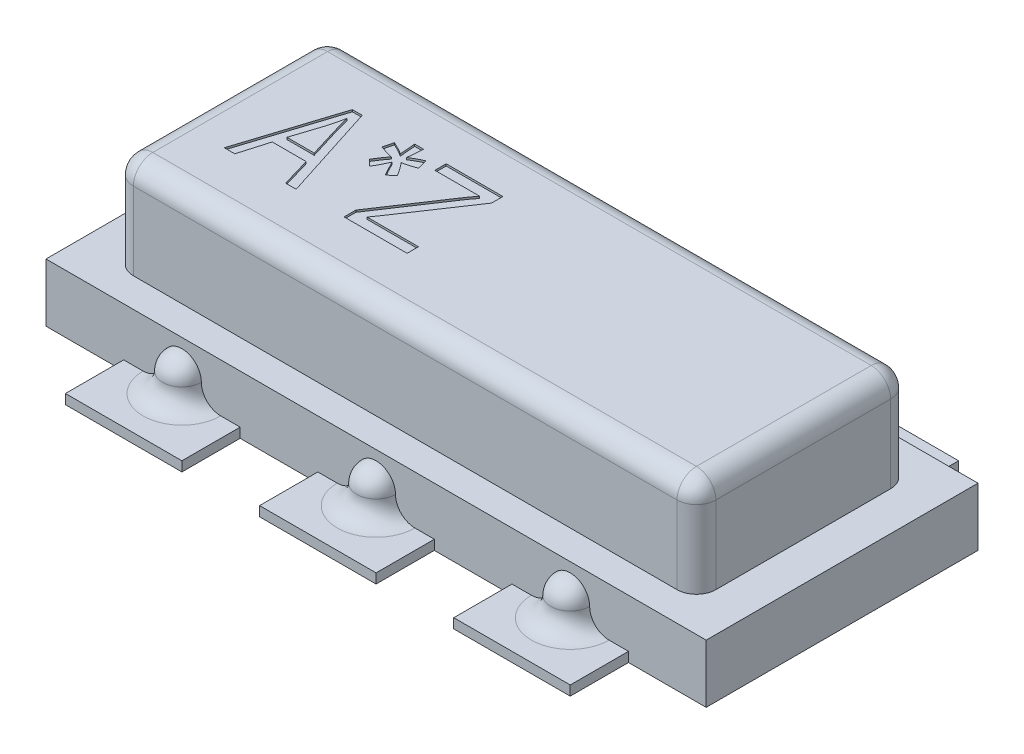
ISO-10303-21;
HEADER;
FILE_DESCRIPTION(('STEP AP214'),'2;1');
FILE_NAME('part.step','',(''),(''),'','','');
FILE_SCHEMA(('AUTOMOTIVE_DESIGN { 1 0 10303 214 1 1 1 1 }'));
ENDSEC;
DATA;
#1=APPLICATION_CONTEXT('core data for automotive mechanical design processes');
#2=APPLICATION_PROTOCOL_DEFINITION('international standard','automotive_design',2000,#1);
#3=PRODUCT_CONTEXT('',#1,'mechanical');
#4=PRODUCT('Part','Part','',(#3));
#5=PRODUCT_RELATED_PRODUCT_CATEGORY('part','',(#4));
#6=PRODUCT_DEFINITION_FORMATION('','',#4);
#7=PRODUCT_DEFINITION_CONTEXT('part definition',#1,'design');
#8=PRODUCT_DEFINITION('design','',#6,#7);
#9=PRODUCT_DEFINITION_SHAPE('','',#8);
#10=(LENGTH_UNIT() NAMED_UNIT(*) SI_UNIT(.MILLI.,.METRE.));
#11=(NAMED_UNIT(*) PLANE_ANGLE_UNIT() SI_UNIT($,.RADIAN.));
#12=(NAMED_UNIT(*) SI_UNIT($,.STERADIAN.) SOLID_ANGLE_UNIT());
#13=UNCERTAINTY_MEASURE_WITH_UNIT(LENGTH_MEASURE(1.E-05),#10,'distance_accuracy_value','');
#14=(GEOMETRIC_REPRESENTATION_CONTEXT(3) GLOBAL_UNCERTAINTY_ASSIGNED_CONTEXT((#13)) GLOBAL_UNIT_ASSIGNED_CONTEXT((#10,
#11,#12)) REPRESENTATION_CONTEXT('',''));
#15=CARTESIAN_POINT('',(0.,0.,0.));
#16=DIRECTION('',(0.,0.,1.));
#17=DIRECTION('',(1.,0.,0.));
#18=AXIS2_PLACEMENT_3D('',#15,#16,#17);
#19=CARTESIAN_POINT('',(0.,0.8,0.));
#20=DIRECTION('',(0.,1.,0.));
#21=DIRECTION('',(0.,0.,1.));
#22=AXIS2_PLACEMENT_3D('',#19,#20,#21);
#23=PLANE('',#22);
#24=DIRECTION('',(-1.,0.,0.));
#25=VECTOR('',#24,1.);
#26=CARTESIAN_POINT('',(-1.5,0.8,-0.45));
#27=LINE('',#26,#25);
#28=CARTESIAN_POINT('',(1.4,0.8,-0.45));
#29=VERTEX_POINT('',#28);
#30=CARTESIAN_POINT('',(-1.4,0.8,-0.45));
#31=VERTEX_POINT('',#30);
#32=EDGE_CURVE('E51',#29,#31,#27,.T.);
#33=ORIENTED_EDGE('',*,*,#32,.T.);
#34=DIRECTION('',(0.,0.,1.));
#35=VECTOR('',#34,1.);
#36=CARTESIAN_POINT('',(-1.4,0.8,0.55));
#37=LINE('',#36,#35);
#38=CARTESIAN_POINT('',(-1.4,0.8,0.45));
#39=VERTEX_POINT('',#38);
#40=EDGE_CURVE('E12',#31,#39,#37,.T.);
#41=ORIENTED_EDGE('',*,*,#40,.T.);
#42=DIRECTION('',(1.,0.,0.));
#43=VECTOR('',#42,1.);
#44=CARTESIAN_POINT('',(1.5,0.8,0.45));
#45=LINE('',#44,#43);
#46=CARTESIAN_POINT('',(1.4,0.8,0.45));
#47=VERTEX_POINT('',#46);
#48=EDGE_CURVE('E578',#39,#47,#45,.T.);
#49=ORIENTED_EDGE('',*,*,#48,.T.);
#50=DIRECTION('',(0.,0.,-1.));
#51=VECTOR('',#50,1.);
#52=CARTESIAN_POINT('',(1.4,0.8,-0.55));
#53=LINE('',#52,#51);
#54=EDGE_CURVE('E580',#47,#29,#53,.T.);
#55=ORIENTED_EDGE('',*,*,#54,.T.);
#56=EDGE_LOOP('',(#33,#41,#49,#55));
#57=FACE_BOUND('',#56,.T.);
#58=DIRECTION('',(-0.280400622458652,0.,0.959883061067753));
#59=VECTOR('',#58,1.);
#60=CARTESIAN_POINT('',(-1.13927913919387,0.8,0.0954493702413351));
#61=LINE('',#60,#59);
#62=CARTESIAN_POINT('',(-1.13927913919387,0.8,0.0954493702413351));
#63=VERTEX_POINT('',#62);
#64=CARTESIAN_POINT('',(-1.18290738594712,0.8,0.244800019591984));
#65=VERTEX_POINT('',#64);
#66=EDGE_CURVE('E478',#63,#65,#61,.T.);
#67=ORIENTED_EDGE('',*,*,#66,.T.);
#68=DIRECTION('',(-1.,0.,0.));
#69=VECTOR('',#68,1.);
#70=CARTESIAN_POINT('',(-1.18290738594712,0.8,0.244800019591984));
#71=LINE('',#70,#69);
#72=CARTESIAN_POINT('',(-1.23698611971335,0.8,0.244800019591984));
#73=VERTEX_POINT('',#72);
#74=EDGE_CURVE('E465',#65,#73,#71,.T.);
#75=ORIENTED_EDGE('',*,*,#74,.T.);
#76=DIRECTION('',(0.30425665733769,0.,-0.952590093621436));
#77=VECTOR('',#76,1.);
#78=CARTESIAN_POINT('',(-1.23698611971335,0.8,0.244800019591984));
#79=LINE('',#78,#77);
#80=CARTESIAN_POINT('',(-1.07728644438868,0.8,-0.255199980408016));
#81=VERTEX_POINT('',#80);
#82=EDGE_CURVE('E495',#73,#81,#79,.T.);
#83=ORIENTED_EDGE('',*,*,#82,.T.);
#84=DIRECTION('',(1.,0.,0.));
#85=VECTOR('',#84,1.);
#86=CARTESIAN_POINT('',(-1.07728644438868,0.8,-0.255199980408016));
#87=LINE('',#86,#85);
#88=CARTESIAN_POINT('',(-1.02665738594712,0.8,-0.255199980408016));
#89=VERTEX_POINT('',#88);
#90=EDGE_CURVE('E498',#81,#89,#87,.T.);
#91=ORIENTED_EDGE('',*,*,#90,.T.);
#92=DIRECTION('',(0.304432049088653,0.,0.952534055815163));
#93=VECTOR('',#92,1.);
#94=CARTESIAN_POINT('',(-1.02665738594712,0.8,-0.255199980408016));
#95=LINE('',#94,#93);
#96=CARTESIAN_POINT('',(-0.866856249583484,0.8,0.244800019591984));
#97=VERTEX_POINT('',#96);
#98=EDGE_CURVE('E501',#89,#97,#95,.T.);
#99=ORIENTED_EDGE('',*,*,#98,.T.);
#100=DIRECTION('',(-1.,0.,0.));
#101=VECTOR('',#100,1.);
#102=CARTESIAN_POINT('',(-0.866856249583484,0.8,0.244800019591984));
#103=LINE('',#102,#101);
#104=CARTESIAN_POINT('',(-0.920833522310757,0.8,0.244800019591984));
#105=VERTEX_POINT('',#104);
#106=EDGE_CURVE('E504',#97,#105,#103,.T.);
#107=ORIENTED_EDGE('',*,*,#106,.T.);
#108=DIRECTION('',(-0.281001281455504,0.,-0.959707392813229));
#109=VECTOR('',#108,1.);
#110=CARTESIAN_POINT('',(-0.920833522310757,0.8,0.244800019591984));
#111=LINE('',#110,#109);
#112=CARTESIAN_POINT('',(-0.964563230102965,0.8,0.0954493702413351));
#113=VERTEX_POINT('',#112);
#114=EDGE_CURVE('E507',#105,#113,#111,.T.);
#115=ORIENTED_EDGE('',*,*,#114,.T.);
#116=DIRECTION('',(-1.,0.,0.));
#117=VECTOR('',#116,1.);
#118=CARTESIAN_POINT('',(-0.964563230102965,0.8,0.0954493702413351));
#119=LINE('',#118,#117);
#120=EDGE_CURVE('E510',#113,#63,#119,.T.);
#121=ORIENTED_EDGE('',*,*,#120,.T.);
#122=EDGE_LOOP('',(#67,#75,#83,#91,#99,#107,#115,#121));
#123=FACE_BOUND('',#122,.T.);
#124=CARTESIAN_POINT('',(-0.812371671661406,0.8,-0.0775417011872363));
#125=CARTESIAN_POINT('',(-0.809910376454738,0.8,-0.0814696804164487));
#126=CARTESIAN_POINT('',(-0.805187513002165,0.8,-0.0890068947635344));
#127=CARTESIAN_POINT('',(-0.798282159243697,0.8,-0.0997584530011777));
#128=CARTESIAN_POINT('',(-0.791864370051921,0.8,-0.109595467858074));
#129=CARTESIAN_POINT('',(-0.785839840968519,0.8,-0.118398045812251));
#130=CARTESIAN_POINT('',(-0.780300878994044,0.8,-0.126318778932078));
#131=CARTESIAN_POINT('',(-0.775272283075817,0.8,-0.133260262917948));
#132=CARTESIAN_POINT('',(-0.770744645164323,0.8,-0.139309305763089));
#133=CARTESIAN_POINT('',(-0.767711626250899,0.8,-0.142862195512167));
#134=CARTESIAN_POINT('',(-0.766308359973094,0.8,-0.144505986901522));
#135=B_SPLINE_CURVE_WITH_KNOTS('',3,(#124,#125,#126,#127,#128,#129,#130,#131,#132,#133,#134),
.UNSPECIFIED.,.F.,.F.,(4,1,1,1,1,1,1,1,4),(0.,0.170963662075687,0.328054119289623,
0.471285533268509,0.60414157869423,0.721454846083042,0.827745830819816,0.920304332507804,1.),.UNSPECIFIED.);
#136=CARTESIAN_POINT('',(-0.812371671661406,0.8,-0.0775417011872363));
#137=VERTEX_POINT('',#136);
#138=CARTESIAN_POINT('',(-0.766308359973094,0.8,-0.144505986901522));
#139=VERTEX_POINT('',#138);
#140=EDGE_CURVE('E399',#137,#139,#135,.T.);
#141=ORIENTED_EDGE('',*,*,#140,.T.);
#142=CARTESIAN_POINT('',(-0.766308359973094,0.8,-0.144505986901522));
#143=CARTESIAN_POINT('',(-0.778050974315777,0.8,-0.147477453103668));
#144=CARTESIAN_POINT('',(-0.800975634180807,0.8,-0.153278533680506));
#145=CARTESIAN_POINT('',(-0.823434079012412,0.8,-0.160680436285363));
#146=CARTESIAN_POINT('',(-0.834388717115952,0.8,-0.164290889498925));
#147=B_SPLINE_CURVE_WITH_KNOTS('',3,(#142,#143,#144,#145,#146),.UNSPECIFIED.,.F.,.F.,(4,1,4),
(0.,0.512226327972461,1.),.UNSPECIFIED.);
#148=CARTESIAN_POINT('',(-0.834388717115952,0.8,-0.164290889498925));
#149=VERTEX_POINT('',#148);
#150=EDGE_CURVE('E67',#139,#149,#147,.T.);
#151=ORIENTED_EDGE('',*,*,#150,.T.);
#152=DIRECTION('',(0.240751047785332,0.,-0.970586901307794));
#153=VECTOR('',#152,1.);
#154=CARTESIAN_POINT('',(-0.834388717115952,0.8,-0.164290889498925));
#155=LINE('',#154,#153);
#156=CARTESIAN_POINT('',(-0.8215031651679,0.8,-0.216238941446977));
#157=VERTEX_POINT('',#156);
#158=EDGE_CURVE('E386',#149,#157,#155,.T.);
#159=ORIENTED_EDGE('',*,*,#158,.T.);
#160=CARTESIAN_POINT('',(-0.8215031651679,0.8,-0.216238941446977));
#161=CARTESIAN_POINT('',(-0.817914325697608,0.8,-0.214556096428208));
#162=CARTESIAN_POINT('',(-0.810956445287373,0.8,-0.21129347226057));
#163=CARTESIAN_POINT('',(-0.800912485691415,0.8,-0.206420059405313));
#164=CARTESIAN_POINT('',(-0.791598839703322,0.8,-0.201776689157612));
#165=CARTESIAN_POINT('',(-0.783044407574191,0.8,-0.197332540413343));
#166=CARTESIAN_POINT('',(-0.775298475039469,0.8,-0.192959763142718));
#167=CARTESIAN_POINT('',(-0.768371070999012,0.8,-0.188697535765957));
#168=CARTESIAN_POINT('',(-0.762081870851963,0.8,-0.184766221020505));
#169=CARTESIAN_POINT('',(-0.758280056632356,0.8,-0.18203184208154));
#170=CARTESIAN_POINT('',(-0.756466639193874,0.8,-0.180727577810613));
#171=B_SPLINE_CURVE_WITH_KNOTS('',3,(#160,#161,#162,#163,#164,#165,#166,#167,#168,#169,#170),
.UNSPECIFIED.,.F.,.F.,(4,1,1,1,1,1,1,1,4),(0.,0.160232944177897,0.310652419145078,
0.451278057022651,0.580921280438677,0.700304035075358,0.810740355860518,0.909725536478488,1.),.UNSPECIFIED.);
#172=CARTESIAN_POINT('',(-0.756466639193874,0.8,-0.180727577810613));
#173=VERTEX_POINT('',#172);
#174=EDGE_CURVE('E833',#157,#173,#171,.T.);
#175=ORIENTED_EDGE('',*,*,#174,.T.);
#176=CARTESIAN_POINT('',(-0.756466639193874,0.8,-0.180727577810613));
#177=CARTESIAN_POINT('',(-0.756948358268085,0.8,-0.18552928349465));
#178=CARTESIAN_POINT('',(-0.75786746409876,0.8,-0.194690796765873));
#179=CARTESIAN_POINT('',(-0.759057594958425,0.8,-0.207852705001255));
#180=CARTESIAN_POINT('',(-0.760207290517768,0.8,-0.219785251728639));
#181=CARTESIAN_POINT('',(-0.76110712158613,0.8,-0.230507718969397));
#182=CARTESIAN_POINT('',(-0.761852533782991,0.8,-0.240009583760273));
#183=CARTESIAN_POINT('',(-0.762314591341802,0.8,-0.24830065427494));
#184=CARTESIAN_POINT('',(-0.762777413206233,0.8,-0.255398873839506));
#185=CARTESIAN_POINT('',(-0.76290318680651,0.8,-0.259731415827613));
#186=CARTESIAN_POINT('',(-0.76296014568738,0.8,-0.261693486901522));
#187=B_SPLINE_CURVE_WITH_KNOTS('',3,(#176,#177,#178,#179,#180,#181,#182,#183,#184,#185,#186),
.UNSPECIFIED.,.F.,.F.,(4,1,1,1,1,1,1,1,4),(0.,0.178204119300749,0.340008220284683,
0.488017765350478,0.620877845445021,0.73735441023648,0.83995469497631,0.92752054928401,1.),.UNSPECIFIED.);
#188=CARTESIAN_POINT('',(-0.76296014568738,0.8,-0.261693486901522));
#189=VERTEX_POINT('',#188);
#190=EDGE_CURVE('E828',#173,#189,#187,.T.);
#191=ORIENTED_EDGE('',*,*,#190,.T.);
#192=DIRECTION('',(1.,0.,0.));
#193=VECTOR('',#192,1.);
#194=CARTESIAN_POINT('',(-0.76296014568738,0.8,-0.261693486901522));
#195=LINE('',#194,#193);
#196=CARTESIAN_POINT('',(-0.717505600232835,0.8,-0.261693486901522));
#197=VERTEX_POINT('',#196);
#198=EDGE_CURVE('E822',#189,#197,#195,.T.);
#199=ORIENTED_EDGE('',*,*,#198,.T.);
#200=CARTESIAN_POINT('',(-0.717505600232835,0.8,-0.261693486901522));
#201=CARTESIAN_POINT('',(-0.717721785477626,0.8,-0.256112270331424));
#202=CARTESIAN_POINT('',(-0.718183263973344,0.8,-0.244198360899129));
#203=CARTESIAN_POINT('',(-0.719370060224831,0.8,-0.225174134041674));
#204=CARTESIAN_POINT('',(-0.721509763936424,0.8,-0.203915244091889));
#205=CARTESIAN_POINT('',(-0.723141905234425,0.8,-0.188978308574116));
#206=CARTESIAN_POINT('',(-0.723999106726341,0.8,-0.181133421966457));
#207=B_SPLINE_CURVE_WITH_KNOTS('',3,(#200,#201,#202,#203,#204,#205,#206),.UNSPECIFIED.,.F.,.F.,
(4,1,1,1,4),(0.,0.207257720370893,0.442421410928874,0.707159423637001,1.),.UNSPECIFIED.);
#208=CARTESIAN_POINT('',(-0.723999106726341,0.8,-0.181133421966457));
#209=VERTEX_POINT('',#208);
#210=EDGE_CURVE('E814',#197,#209,#207,.T.);
#211=ORIENTED_EDGE('',*,*,#210,.T.);
#212=CARTESIAN_POINT('',(-0.723999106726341,0.8,-0.181133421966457));
#213=CARTESIAN_POINT('',(-0.719159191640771,0.8,-0.184260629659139));
#214=CARTESIAN_POINT('',(-0.709255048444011,0.8,-0.190659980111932));
#215=CARTESIAN_POINT('',(-0.69346938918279,0.8,-0.19952744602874));
#216=CARTESIAN_POINT('',(-0.676627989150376,0.8,-0.208190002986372));
#217=CARTESIAN_POINT('',(-0.664871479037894,0.8,-0.213516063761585));
#218=CARTESIAN_POINT('',(-0.658861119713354,0.8,-0.216238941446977));
#219=B_SPLINE_CURVE_WITH_KNOTS('',3,(#212,#213,#214,#215,#216,#217,#218),.UNSPECIFIED.,.F.,.F.,
(4,1,1,1,4),(0.,0.233299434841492,0.477411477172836,0.732833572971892,1.),.UNSPECIFIED.);
#220=CARTESIAN_POINT('',(-0.658861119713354,0.8,-0.216238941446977));
#221=VERTEX_POINT('',#220);
#222=EDGE_CURVE('E809',#209,#221,#219,.T.);
#223=ORIENTED_EDGE('',*,*,#222,.T.);
#224=DIRECTION('',(0.238964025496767,0.,0.971028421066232));
#225=VECTOR('',#224,1.);
#226=CARTESIAN_POINT('',(-0.658861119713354,0.8,-0.216238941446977));
#227=LINE('',#226,#225);
#228=CARTESIAN_POINT('',(-0.646077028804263,0.8,-0.164290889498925));
#229=VERTEX_POINT('',#228);
#230=EDGE_CURVE('E803',#221,#229,#227,.T.);
#231=ORIENTED_EDGE('',*,*,#230,.T.);
#232=CARTESIAN_POINT('',(-0.646077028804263,0.8,-0.164290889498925));
#233=CARTESIAN_POINT('',(-0.651901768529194,0.8,-0.161953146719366));
#234=CARTESIAN_POINT('',(-0.663336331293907,0.8,-0.157363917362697));
#235=CARTESIAN_POINT('',(-0.680662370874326,0.8,-0.151814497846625));
#236=CARTESIAN_POINT('',(-0.697711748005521,0.8,-0.147314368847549));
#237=CARTESIAN_POINT('',(-0.709133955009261,0.8,-0.145433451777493));
#238=CARTESIAN_POINT('',(-0.714766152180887,0.8,-0.144505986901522));
#239=B_SPLINE_CURVE_WITH_KNOTS('',3,(#232,#233,#234,#235,#236,#237,#238),.UNSPECIFIED.,.F.,.F.,
(4,1,1,1,4),(0.,0.262665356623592,0.515639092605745,0.761165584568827,1.),.UNSPECIFIED.);
#240=CARTESIAN_POINT('',(-0.714766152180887,0.8,-0.144505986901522));
#241=VERTEX_POINT('',#240);
#242=EDGE_CURVE('E795',#229,#241,#239,.T.);
#243=ORIENTED_EDGE('',*,*,#242,.T.);
#244=CARTESIAN_POINT('',(-0.714766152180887,0.8,-0.144505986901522));
#245=CARTESIAN_POINT('',(-0.713264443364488,0.8,-0.142792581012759));
#246=CARTESIAN_POINT('',(-0.710049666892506,0.8,-0.139124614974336));
#247=CARTESIAN_POINT('',(-0.705207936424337,0.8,-0.13300749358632));
#248=CARTESIAN_POINT('',(-0.699929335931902,0.8,-0.126005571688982));
#249=CARTESIAN_POINT('',(-0.694267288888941,0.8,-0.118051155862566));
#250=CARTESIAN_POINT('',(-0.68806737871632,0.8,-0.109254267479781));
#251=CARTESIAN_POINT('',(-0.681487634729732,0.8,-0.0995018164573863));
#252=CARTESIAN_POINT('',(-0.674483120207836,0.8,-0.0888496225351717));
#253=CARTESIAN_POINT('',(-0.669741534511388,0.8,-0.0814035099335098));
#254=CARTESIAN_POINT('',(-0.66728238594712,0.8,-0.0775417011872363));
#255=B_SPLINE_CURVE_WITH_KNOTS('',3,(#244,#245,#246,#247,#248,#249,#250,#251,#252,#253,#254),
.UNSPECIFIED.,.F.,.F.,(4,1,1,1,1,1,1,1,4),(0.,0.0831758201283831,0.178058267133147,
0.284749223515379,0.403320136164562,0.534527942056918,0.677690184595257,0.832839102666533,1.),.UNSPECIFIED.);
#256=CARTESIAN_POINT('',(-0.66728238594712,0.8,-0.0775417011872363));
#257=VERTEX_POINT('',#256);
#258=EDGE_CURVE('E790',#241,#257,#255,.T.);
#259=ORIENTED_EDGE('',*,*,#258,.T.);
#260=DIRECTION('',(-0.739221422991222,0.,0.673462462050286));
#261=VECTOR('',#260,1.);
#262=CARTESIAN_POINT('',(-0.66728238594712,0.8,-0.0775417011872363));
#263=LINE('',#262,#261);
#264=CARTESIAN_POINT('',(-0.700358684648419,0.8,-0.0474077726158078));
#265=VERTEX_POINT('',#264);
#266=EDGE_CURVE('E784',#257,#265,#263,.T.);
#267=ORIENTED_EDGE('',*,*,#266,.T.);
#268=CARTESIAN_POINT('',(-0.700358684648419,0.8,-0.0474077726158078));
#269=CARTESIAN_POINT('',(-0.703307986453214,0.8,-0.0523223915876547));
#270=CARTESIAN_POINT('',(-0.709699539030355,0.8,-0.0629730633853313));
#271=CARTESIAN_POINT('',(-0.719116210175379,0.8,-0.080741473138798));
#272=CARTESIAN_POINT('',(-0.729685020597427,0.8,-0.101178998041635));
#273=CARTESIAN_POINT('',(-0.736848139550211,0.8,-0.115844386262));
#274=CARTESIAN_POINT('',(-0.740638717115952,0.8,-0.123605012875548));
#275=B_SPLINE_CURVE_WITH_KNOTS('',3,(#268,#269,#270,#271,#272,#273,#274),.UNSPECIFIED.,.F.,.F.,
(4,1,1,1,4),(0.,0.199400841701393,0.432129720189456,0.699494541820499,1.),.UNSPECIFIED.);
#276=CARTESIAN_POINT('',(-0.740638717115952,0.8,-0.123605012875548));
#277=VERTEX_POINT('',#276);
#278=EDGE_CURVE('E776',#265,#277,#275,.T.);
#279=ORIENTED_EDGE('',*,*,#278,.T.);
#280=CARTESIAN_POINT('',(-0.740638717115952,0.8,-0.123605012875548));
#281=CARTESIAN_POINT('',(-0.742445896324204,0.8,-0.119537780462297));
#282=CARTESIAN_POINT('',(-0.745954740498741,0.8,-0.111640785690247));
#283=CARTESIAN_POINT('',(-0.751381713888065,0.8,-0.100280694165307));
#284=CARTESIAN_POINT('',(-0.756522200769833,0.8,-0.0896440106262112));
#285=CARTESIAN_POINT('',(-0.761496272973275,0.8,-0.0797500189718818));
#286=CARTESIAN_POINT('',(-0.766375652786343,0.8,-0.0706389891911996));
#287=CARTESIAN_POINT('',(-0.771041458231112,0.8,-0.0622160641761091));
#288=CARTESIAN_POINT('',(-0.775457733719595,0.8,-0.0545072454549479));
#289=CARTESIAN_POINT('',(-0.778469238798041,0.8,-0.0496988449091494));
#290=CARTESIAN_POINT('',(-0.779904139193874,0.8,-0.0474077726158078));
#291=B_SPLINE_CURVE_WITH_KNOTS('',3,(#280,#281,#282,#283,#284,#285,#286,#287,#288,#289,#290),
.UNSPECIFIED.,.F.,.F.,(4,1,1,1,1,1,1,1,4),(0.,0.155628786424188,0.302171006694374,
0.440225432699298,0.568751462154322,0.689384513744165,0.80161426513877,0.90547458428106,1.),.UNSPECIFIED.);
#292=CARTESIAN_POINT('',(-0.779904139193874,0.8,-0.0474077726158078));
#293=VERTEX_POINT('',#292);
#294=EDGE_CURVE('E771',#277,#293,#291,.T.);
#295=ORIENTED_EDGE('',*,*,#294,.T.);
#296=DIRECTION('',(-0.732956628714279,0.,-0.680275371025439));
#297=VECTOR('',#296,1.);
#298=CARTESIAN_POINT('',(-0.779904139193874,0.8,-0.0474077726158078));
#299=LINE('',#298,#297);
#300=EDGE_CURVE('E765',#293,#137,#299,.T.);
#301=ORIENTED_EDGE('',*,*,#300,.T.);
#302=EDGE_LOOP('',(#141,#151,#159,#175,#191,#199,#211,#223,#231,#243,#259,#267,#279,#295,#301));
#303=FACE_BOUND('',#302,.T.);
#304=DIRECTION('',(0.,0.,1.));
#305=VECTOR('',#304,1.);
#306=CARTESIAN_POINT('',(-0.295427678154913,0.8,0.186358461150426));
#307=LINE('',#306,#305);
#308=CARTESIAN_POINT('',(-0.295427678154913,0.8,0.186358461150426));
#309=VERTEX_POINT('',#308);
#310=CARTESIAN_POINT('',(-0.295427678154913,0.8,0.244800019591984));
#311=VERTEX_POINT('',#310);
#312=EDGE_CURVE('E379',#309,#311,#307,.T.);
#313=ORIENTED_EDGE('',*,*,#312,.T.);
#314=DIRECTION('',(-1.,0.,0.));
#315=VECTOR('',#314,1.);
#316=CARTESIAN_POINT('',(-0.295427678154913,0.8,0.244800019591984));
#317=LINE('',#316,#315);
#318=CARTESIAN_POINT('',(-0.620103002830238,0.8,0.244800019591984));
#319=VERTEX_POINT('',#318);
#320=EDGE_CURVE('E59',#311,#319,#317,.T.);
#321=ORIENTED_EDGE('',*,*,#320,.T.);
#322=DIRECTION('',(0.,0.,-1.));
#323=VECTOR('',#322,1.);
#324=CARTESIAN_POINT('',(-0.620103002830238,0.8,0.244800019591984));
#325=LINE('',#324,#323);
#326=CARTESIAN_POINT('',(-0.620103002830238,0.8,0.183923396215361));
#327=VERTEX_POINT('',#326);
#328=EDGE_CURVE('E383',#319,#327,#325,.T.);
#329=ORIENTED_EDGE('',*,*,#328,.T.);
#330=DIRECTION('',(0.553971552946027,0.,-0.832535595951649));
#331=VECTOR('',#330,1.);
#332=CARTESIAN_POINT('',(-0.620103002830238,0.8,0.183923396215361));
#333=LINE('',#332,#331);
#334=CARTESIAN_POINT('',(-0.406426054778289,0.8,-0.137200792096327));
#335=VERTEX_POINT('',#334);
#336=EDGE_CURVE('E1537',#327,#335,#333,.T.);
#337=ORIENTED_EDGE('',*,*,#336,.T.);
#338=CARTESIAN_POINT('',(-0.406426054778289,0.8,-0.137200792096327));
#339=CARTESIAN_POINT('',(-0.402812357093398,0.8,-0.142672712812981));
#340=CARTESIAN_POINT('',(-0.395738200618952,0.8,-0.153384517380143));
#341=CARTESIAN_POINT('',(-0.384705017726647,0.8,-0.16864506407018));
#342=CARTESIAN_POINT('',(-0.374003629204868,0.8,-0.183124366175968));
#343=CARTESIAN_POINT('',(-0.366681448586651,0.8,-0.192281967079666));
#344=CARTESIAN_POINT('',(-0.363102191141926,0.8,-0.196758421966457));
#345=B_SPLINE_CURVE_WITH_KNOTS('',3,(#338,#339,#340,#341,#342,#343,#344),.UNSPECIFIED.,.F.,.F.,
(4,1,1,1,4),(0.,0.266974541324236,0.522628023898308,0.766649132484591,1.),.UNSPECIFIED.);
#346=CARTESIAN_POINT('',(-0.363102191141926,0.8,-0.196758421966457));
#347=VERTEX_POINT('',#346);
#348=EDGE_CURVE('E1540',#335,#347,#345,.T.);
#349=ORIENTED_EDGE('',*,*,#348,.T.);
#350=DIRECTION('',(-1.,0.,0.));
#351=VECTOR('',#350,1.);
#352=CARTESIAN_POINT('',(-0.363102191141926,0.8,-0.196758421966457));
#353=LINE('',#352,#351);
#354=CARTESIAN_POINT('',(-0.594128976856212,0.8,-0.196758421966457));
#355=VERTEX_POINT('',#354);
#356=EDGE_CURVE('E1545',#347,#355,#353,.T.);
#357=ORIENTED_EDGE('',*,*,#356,.T.);
#358=DIRECTION('',(0.,0.,-1.));
#359=VECTOR('',#358,1.);
#360=CARTESIAN_POINT('',(-0.594128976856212,0.8,-0.196758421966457));
#361=LINE('',#360,#359);
#362=CARTESIAN_POINT('',(-0.594128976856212,0.8,-0.255199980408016));
#363=VERTEX_POINT('',#362);
#364=EDGE_CURVE('E1551',#355,#363,#361,.T.);
#365=ORIENTED_EDGE('',*,*,#364,.T.);
#366=DIRECTION('',(1.,0.,0.));
#367=VECTOR('',#366,1.);
#368=CARTESIAN_POINT('',(-0.594128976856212,0.8,-0.255199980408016));
#369=LINE('',#368,#367);
#370=CARTESIAN_POINT('',(-0.301921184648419,0.8,-0.255199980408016));
#371=VERTEX_POINT('',#370);
#372=EDGE_CURVE('E1554',#363,#371,#369,.T.);
#373=ORIENTED_EDGE('',*,*,#372,.T.);
#374=DIRECTION('',(0.,0.,1.));
#375=VECTOR('',#374,1.);
#376=CARTESIAN_POINT('',(-0.301921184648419,0.8,-0.255199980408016));
#377=LINE('',#376,#375);
#378=CARTESIAN_POINT('',(-0.301921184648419,0.8,-0.196758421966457));
#379=VERTEX_POINT('',#378);
#380=EDGE_CURVE('E1557',#371,#379,#377,.T.);
#381=ORIENTED_EDGE('',*,*,#380,.T.);
#382=DIRECTION('',(-0.557045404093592,0.,0.830482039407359));
#383=VECTOR('',#382,1.);
#384=CARTESIAN_POINT('',(-0.301921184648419,0.8,-0.196758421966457));
#385=LINE('',#384,#383);
#386=CARTESIAN_POINT('',(-0.535281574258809,0.8,0.151151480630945));
#387=VERTEX_POINT('',#386);
#388=EDGE_CURVE('E1560',#379,#387,#385,.T.);
#389=ORIENTED_EDGE('',*,*,#388,.T.);
#390=DIRECTION('',(-0.583008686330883,0.,0.812465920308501));
#391=VECTOR('',#390,1.);
#392=CARTESIAN_POINT('',(-0.535281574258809,0.8,0.151151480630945));
#393=LINE('',#392,#391);
#394=CARTESIAN_POINT('',(-0.560545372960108,0.8,0.186358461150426));
#395=VERTEX_POINT('',#394);
#396=EDGE_CURVE('E1563',#387,#395,#393,.T.);
#397=ORIENTED_EDGE('',*,*,#396,.T.);
#398=DIRECTION('',(1.,0.,0.));
#399=VECTOR('',#398,1.);
#400=CARTESIAN_POINT('',(-0.560545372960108,0.8,0.186358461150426));
#401=LINE('',#400,#399);
#402=EDGE_CURVE('E1566',#395,#309,#401,.T.);
#403=ORIENTED_EDGE('',*,*,#402,.T.);
#404=EDGE_LOOP('',(#313,#321,#329,#337,#349,#357,#365,#373,#381,#389,#397,#403));
#405=FACE_BOUND('',#404,.T.);
#406=ADVANCED_FACE('F42',(#57,#123,#303,#405),#23,.T.);
#407=CARTESIAN_POINT('',(-1.5,0.8,-0.55));
#408=DIRECTION('',(1.,0.,0.));
#409=DIRECTION('',(0.,0.,-1.));
#410=AXIS2_PLACEMENT_3D('',#407,#408,#409);
#411=PLANE('',#410);
#412=DIRECTION('',(0.,0.,1.));
#413=VECTOR('',#412,1.);
#414=CARTESIAN_POINT('',(-1.5,0.7,-0.55));
#415=LINE('',#414,#413);
#416=CARTESIAN_POINT('',(-1.5,0.7,0.45));
#417=VERTEX_POINT('',#416);
#418=CARTESIAN_POINT('',(-1.5,0.7,-0.45));
#419=VERTEX_POINT('',#418);
#420=EDGE_CURVE('E545',#417,#419,#415,.F.);
#421=ORIENTED_EDGE('',*,*,#420,.T.);
#422=DIRECTION('',(0.,-1.,0.));
#423=VECTOR('',#422,1.);
#424=CARTESIAN_POINT('',(-1.5,0.8,-0.45));
#425=LINE('',#424,#423);
#426=CARTESIAN_POINT('',(-1.5,0.3,-0.45));
#427=VERTEX_POINT('',#426);
#428=EDGE_CURVE('E549',#419,#427,#425,.T.);
#429=ORIENTED_EDGE('',*,*,#428,.T.);
#430=DIRECTION('',(0.,0.,1.));
#431=VECTOR('',#430,1.);
#432=CARTESIAN_POINT('',(-1.5,0.3,-0.55));
#433=LINE('',#432,#431);
#434=CARTESIAN_POINT('',(-1.5,0.3,0.45));
#435=VERTEX_POINT('',#434);
#436=EDGE_CURVE('E533',#427,#435,#433,.T.);
#437=ORIENTED_EDGE('',*,*,#436,.T.);
#438=DIRECTION('',(0.,-1.,0.));
#439=VECTOR('',#438,1.);
#440=CARTESIAN_POINT('',(-1.5,0.8,0.45));
#441=LINE('',#440,#439);
#442=EDGE_CURVE('E547',#435,#417,#441,.F.);
#443=ORIENTED_EDGE('',*,*,#442,.T.);
#444=EDGE_LOOP('',(#421,#429,#437,#443));
#445=FACE_BOUND('',#444,.T.);
#446=ADVANCED_FACE('F674',(#445),#411,.F.);
#447=CARTESIAN_POINT('',(-1.5,0.8,0.55));
#448=DIRECTION('',(0.,0.,-1.));
#449=DIRECTION('',(-1.,0.,0.));
#450=AXIS2_PLACEMENT_3D('',#447,#448,#449);
#451=PLANE('',#450);
#452=DIRECTION('',(1.,0.,0.));
#453=VECTOR('',#452,1.);
#454=CARTESIAN_POINT('',(-1.5,0.3,0.55));
#455=LINE('',#454,#453);
#456=CARTESIAN_POINT('',(-1.4,0.3,0.55));
#457=VERTEX_POINT('',#456);
#458=CARTESIAN_POINT('',(1.4,0.3,0.55));
#459=VERTEX_POINT('',#458);
#460=EDGE_CURVE('E536',#457,#459,#455,.T.);
#461=ORIENTED_EDGE('',*,*,#460,.T.);
#462=DIRECTION('',(0.,-1.,0.));
#463=VECTOR('',#462,1.);
#464=CARTESIAN_POINT('',(1.4,0.8,0.55));
#465=LINE('',#464,#463);
#466=CARTESIAN_POINT('',(1.4,0.7,0.55));
#467=VERTEX_POINT('',#466);
#468=EDGE_CURVE('E576',#459,#467,#465,.F.);
#469=ORIENTED_EDGE('',*,*,#468,.T.);
#470=DIRECTION('',(1.,0.,0.));
#471=VECTOR('',#470,1.);
#472=CARTESIAN_POINT('',(-1.5,0.7,0.55));
#473=LINE('',#472,#471);
#474=CARTESIAN_POINT('',(-1.4,0.7,0.55));
#475=VERTEX_POINT('',#474);
#476=EDGE_CURVE('E572',#467,#475,#473,.F.);
#477=ORIENTED_EDGE('',*,*,#476,.T.);
#478=DIRECTION('',(0.,-1.,0.));
#479=VECTOR('',#478,1.);
#480=CARTESIAN_POINT('',(-1.4,0.8,0.55));
#481=LINE('',#480,#479);
#482=EDGE_CURVE('E574',#475,#457,#481,.T.);
#483=ORIENTED_EDGE('',*,*,#482,.T.);
#484=EDGE_LOOP('',(#461,#469,#477,#483));
#485=FACE_BOUND('',#484,.T.);
#486=ADVANCED_FACE('F668',(#485),#451,.F.);
#487=CARTESIAN_POINT('',(1.5,0.8,-0.55));
#488=DIRECTION('',(-1.,0.,0.));
#489=DIRECTION('',(0.,0.,1.));
#490=AXIS2_PLACEMENT_3D('',#487,#488,#489);
#491=PLANE('',#490);
#492=DIRECTION('',(0.,0.,-1.));
#493=VECTOR('',#492,1.);
#494=CARTESIAN_POINT('',(1.5,0.3,-0.55));
#495=LINE('',#494,#493);
#496=CARTESIAN_POINT('',(1.5,0.3,0.45));
#497=VERTEX_POINT('',#496);
#498=CARTESIAN_POINT('',(1.5,0.3,-0.45));
#499=VERTEX_POINT('',#498);
#500=EDGE_CURVE('E539',#497,#499,#495,.T.);
#501=ORIENTED_EDGE('',*,*,#500,.T.);
#502=DIRECTION('',(0.,-1.,0.));
#503=VECTOR('',#502,1.);
#504=CARTESIAN_POINT('',(1.5,0.8,-0.45));
#505=LINE('',#504,#503);
#506=CARTESIAN_POINT('',(1.5,0.7,-0.45));
#507=VERTEX_POINT('',#506);
#508=EDGE_CURVE('E570',#499,#507,#505,.F.);
#509=ORIENTED_EDGE('',*,*,#508,.T.);
#510=DIRECTION('',(0.,0.,-1.));
#511=VECTOR('',#510,1.);
#512=CARTESIAN_POINT('',(1.5,0.7,0.55));
#513=LINE('',#512,#511);
#514=CARTESIAN_POINT('',(1.5,0.7,0.45));
#515=VERTEX_POINT('',#514);
#516=EDGE_CURVE('E566',#507,#515,#513,.F.);
#517=ORIENTED_EDGE('',*,*,#516,.T.);
#518=DIRECTION('',(0.,-1.,0.));
#519=VECTOR('',#518,1.);
#520=CARTESIAN_POINT('',(1.5,0.8,0.45));
#521=LINE('',#520,#519);
#522=EDGE_CURVE('E568',#515,#497,#521,.T.);
#523=ORIENTED_EDGE('',*,*,#522,.T.);
#524=EDGE_LOOP('',(#501,#509,#517,#523));
#525=FACE_BOUND('',#524,.T.);
#526=ADVANCED_FACE('F628',(#525),#491,.F.);
#527=CARTESIAN_POINT('',(-1.5,0.8,-0.55));
#528=DIRECTION('',(0.,0.,1.));
#529=DIRECTION('',(1.,0.,0.));
#530=AXIS2_PLACEMENT_3D('',#527,#528,#529);
#531=PLANE('',#530);
#532=DIRECTION('',(-1.,0.,0.));
#533=VECTOR('',#532,1.);
#534=CARTESIAN_POINT('',(-1.5,0.3,-0.55));
#535=LINE('',#534,#533);
#536=CARTESIAN_POINT('',(1.4,0.3,-0.55));
#537=VERTEX_POINT('',#536);
#538=CARTESIAN_POINT('',(-1.4,0.3,-0.55));
#539=VERTEX_POINT('',#538);
#540=EDGE_CURVE('E542',#537,#539,#535,.T.);
#541=ORIENTED_EDGE('',*,*,#540,.T.);
#542=DIRECTION('',(0.,-1.,0.));
#543=VECTOR('',#542,1.);
#544=CARTESIAN_POINT('',(-1.4,0.8,-0.55));
#545=LINE('',#544,#543);
#546=CARTESIAN_POINT('',(-1.4,0.7,-0.55));
#547=VERTEX_POINT('',#546);
#548=EDGE_CURVE('E564',#539,#547,#545,.F.);
#549=ORIENTED_EDGE('',*,*,#548,.T.);
#550=DIRECTION('',(-1.,0.,0.));
#551=VECTOR('',#550,1.);
#552=CARTESIAN_POINT('',(1.5,0.7,-0.55));
#553=LINE('',#552,#551);
#554=CARTESIAN_POINT('',(1.4,0.7,-0.55));
#555=VERTEX_POINT('',#554);
#556=EDGE_CURVE('E560',#547,#555,#553,.F.);
#557=ORIENTED_EDGE('',*,*,#556,.T.);
#558=DIRECTION('',(0.,-1.,0.));
#559=VECTOR('',#558,1.);
#560=CARTESIAN_POINT('',(1.4,0.8,-0.55));
#561=LINE('',#560,#559);
#562=EDGE_CURVE('E562',#555,#537,#561,.T.);
#563=ORIENTED_EDGE('',*,*,#562,.T.);
#564=EDGE_LOOP('',(#541,#549,#557,#563));
#565=FACE_BOUND('',#564,.T.);
#566=ADVANCED_FACE('F680',(#565),#531,.F.);
#567=CARTESIAN_POINT('',(0.,0.3,0.));
#568=DIRECTION('',(0.,1.,0.));
#569=DIRECTION('',(0.,0.,1.));
#570=AXIS2_PLACEMENT_3D('',#567,#568,#569);
#571=PLANE('',#570);
#572=ORIENTED_EDGE('',*,*,#436,.F.);
#573=CARTESIAN_POINT('',(-1.4,0.3,-0.45));
#574=DIRECTION('',(0.,1.,0.));
#575=DIRECTION('',(0.,0.,1.));
#576=AXIS2_PLACEMENT_3D('',#573,#574,#575);
#577=CIRCLE('',#576,0.1);
#578=EDGE_CURVE('E558',#427,#539,#577,.F.);
#579=ORIENTED_EDGE('',*,*,#578,.T.);
#580=ORIENTED_EDGE('',*,*,#540,.F.);
#581=CARTESIAN_POINT('',(1.4,0.3,-0.45));
#582=DIRECTION('',(0.,1.,0.));
#583=DIRECTION('',(0.,0.,1.));
#584=AXIS2_PLACEMENT_3D('',#581,#582,#583);
#585=CIRCLE('',#584,0.1);
#586=EDGE_CURVE('E556',#537,#499,#585,.F.);
#587=ORIENTED_EDGE('',*,*,#586,.T.);
#588=ORIENTED_EDGE('',*,*,#500,.F.);
#589=CARTESIAN_POINT('',(1.4,0.3,0.45));
#590=DIRECTION('',(0.,1.,0.));
#591=DIRECTION('',(0.,0.,1.));
#592=AXIS2_PLACEMENT_3D('',#589,#590,#591);
#593=CIRCLE('',#592,0.1);
#594=EDGE_CURVE('E554',#497,#459,#593,.F.);
#595=ORIENTED_EDGE('',*,*,#594,.T.);
#596=ORIENTED_EDGE('',*,*,#460,.F.);
#597=CARTESIAN_POINT('',(-1.4,0.3,0.45));
#598=DIRECTION('',(0.,1.,0.));
#599=DIRECTION('',(0.,0.,1.));
#600=AXIS2_PLACEMENT_3D('',#597,#598,#599);
#601=CIRCLE('',#600,0.1);
#602=EDGE_CURVE('E552',#457,#435,#601,.F.);
#603=ORIENTED_EDGE('',*,*,#602,.T.);
#604=EDGE_LOOP('',(#572,#579,#580,#587,#588,#595,#596,#603));
#605=FACE_BOUND('',#604,.T.);
#606=ADVANCED_FACE('F632',(#605),#571,.F.);
#607=CARTESIAN_POINT('',(1.4,0.8,0.45));
#608=DIRECTION('',(0.,-1.,0.));
#609=DIRECTION('',(0.,0.,-1.));
#610=AXIS2_PLACEMENT_3D('',#607,#608,#609);
#611=CYLINDRICAL_SURFACE('',#610,0.1);
#612=CARTESIAN_POINT('',(1.4,0.7,0.45));
#613=DIRECTION('',(0.,1.,0.));
#614=DIRECTION('',(0.,0.,1.));
#615=AXIS2_PLACEMENT_3D('',#612,#613,#614);
#616=CIRCLE('',#615,0.1);
#617=EDGE_CURVE('E46',#467,#515,#616,.T.);
#618=ORIENTED_EDGE('',*,*,#617,.F.);
#619=ORIENTED_EDGE('',*,*,#468,.F.);
#620=ORIENTED_EDGE('',*,*,#594,.F.);
#621=ORIENTED_EDGE('',*,*,#522,.F.);
#622=EDGE_LOOP('',(#618,#619,#620,#621));
#623=FACE_BOUND('',#622,.T.);
#624=ADVANCED_FACE('F44',(#623),#611,.T.);
#625=CARTESIAN_POINT('',(1.4,0.7,0.45));
#626=DIRECTION('',(0.,0.,1.));
#627=DIRECTION('',(1.,0.,0.));
#628=AXIS2_PLACEMENT_3D('',#625,#626,#627);
#629=SPHERICAL_SURFACE('',#628,0.1);
#630=CARTESIAN_POINT('',(1.4,0.7,0.45));
#631=DIRECTION('',(1.,0.,0.));
#632=DIRECTION('',(0.,0.,-1.));
#633=AXIS2_PLACEMENT_3D('',#630,#631,#632);
#634=CIRCLE('',#633,0.1);
#635=EDGE_CURVE('E608',#467,#47,#634,.F.);
#636=ORIENTED_EDGE('',*,*,#635,.F.);
#637=ORIENTED_EDGE('',*,*,#617,.T.);
#638=CARTESIAN_POINT('',(1.4,0.7,0.45));
#639=DIRECTION('',(0.,0.,1.));
#640=DIRECTION('',(0.,-1.,0.));
#641=AXIS2_PLACEMENT_3D('',#638,#639,#640);
#642=CIRCLE('',#641,0.1);
#643=EDGE_CURVE('E610',#47,#515,#642,.F.);
#644=ORIENTED_EDGE('',*,*,#643,.F.);
#645=EDGE_LOOP('',(#636,#637,#644));
#646=FACE_BOUND('',#645,.T.);
#647=ADVANCED_FACE('F620',(#646),#629,.T.);
#648=CARTESIAN_POINT('',(1.4,0.8,-0.45));
#649=DIRECTION('',(0.,-1.,0.));
#650=DIRECTION('',(0.,0.,-1.));
#651=AXIS2_PLACEMENT_3D('',#648,#649,#650);
#652=CYLINDRICAL_SURFACE('',#651,0.1);
#653=ORIENTED_EDGE('',*,*,#586,.F.);
#654=ORIENTED_EDGE('',*,*,#562,.F.);
#655=CARTESIAN_POINT('',(1.4,0.7,-0.45));
#656=DIRECTION('',(0.,1.,0.));
#657=DIRECTION('',(0.,0.,1.));
#658=AXIS2_PLACEMENT_3D('',#655,#656,#657);
#659=CIRCLE('',#658,0.1);
#660=EDGE_CURVE('E605',#507,#555,#659,.T.);
#661=ORIENTED_EDGE('',*,*,#660,.F.);
#662=ORIENTED_EDGE('',*,*,#508,.F.);
#663=EDGE_LOOP('',(#653,#654,#661,#662));
#664=FACE_BOUND('',#663,.T.);
#665=ADVANCED_FACE('F638',(#664),#652,.T.);
#666=CARTESIAN_POINT('',(1.4,0.7,0.));
#667=DIRECTION('',(0.,0.,1.));
#668=DIRECTION('',(1.,0.,0.));
#669=AXIS2_PLACEMENT_3D('',#666,#667,#668);
#670=CYLINDRICAL_SURFACE('',#669,0.1);
#671=ORIENTED_EDGE('',*,*,#643,.T.);
#672=ORIENTED_EDGE('',*,*,#516,.F.);
#673=CARTESIAN_POINT('',(1.4,0.7,-0.45));
#674=DIRECTION('',(0.,0.,-1.));
#675=DIRECTION('',(-1.,0.,0.));
#676=AXIS2_PLACEMENT_3D('',#673,#674,#675);
#677=CIRCLE('',#676,0.1);
#678=EDGE_CURVE('E602',#29,#507,#677,.T.);
#679=ORIENTED_EDGE('',*,*,#678,.F.);
#680=ORIENTED_EDGE('',*,*,#54,.F.);
#681=EDGE_LOOP('',(#671,#672,#679,#680));
#682=FACE_BOUND('',#681,.T.);
#683=ADVANCED_FACE('F641',(#682),#670,.T.);
#684=CARTESIAN_POINT('',(0.,0.7,0.45));
#685=DIRECTION('',(-1.,0.,0.));
#686=DIRECTION('',(0.,0.,1.));
#687=AXIS2_PLACEMENT_3D('',#684,#685,#686);
#688=CYLINDRICAL_SURFACE('',#687,0.1);
#689=ORIENTED_EDGE('',*,*,#635,.T.);
#690=ORIENTED_EDGE('',*,*,#48,.F.);
#691=CARTESIAN_POINT('',(-1.4,0.7,0.45));
#692=DIRECTION('',(-1.,0.,0.));
#693=DIRECTION('',(0.,0.,1.));
#694=AXIS2_PLACEMENT_3D('',#691,#692,#693);
#695=CIRCLE('',#694,0.1);
#696=EDGE_CURVE('E599',#475,#39,#695,.T.);
#697=ORIENTED_EDGE('',*,*,#696,.F.);
#698=ORIENTED_EDGE('',*,*,#476,.F.);
#699=EDGE_LOOP('',(#689,#690,#697,#698));
#700=FACE_BOUND('',#699,.T.);
#701=ADVANCED_FACE('F665',(#700),#688,.T.);
#702=CARTESIAN_POINT('',(-1.4,0.8,0.45));
#703=DIRECTION('',(0.,-1.,0.));
#704=DIRECTION('',(0.,0.,-1.));
#705=AXIS2_PLACEMENT_3D('',#702,#703,#704);
#706=CYLINDRICAL_SURFACE('',#705,0.1);
#707=ORIENTED_EDGE('',*,*,#602,.F.);
#708=ORIENTED_EDGE('',*,*,#482,.F.);
#709=CARTESIAN_POINT('',(-1.4,0.7,0.45));
#710=DIRECTION('',(0.,1.,0.));
#711=DIRECTION('',(0.,0.,1.));
#712=AXIS2_PLACEMENT_3D('',#709,#710,#711);
#713=CIRCLE('',#712,0.1);
#714=EDGE_CURVE('E596',#417,#475,#713,.T.);
#715=ORIENTED_EDGE('',*,*,#714,.F.);
#716=ORIENTED_EDGE('',*,*,#442,.F.);
#717=EDGE_LOOP('',(#707,#708,#715,#716));
#718=FACE_BOUND('',#717,.T.);
#719=ADVANCED_FACE('F671',(#718),#706,.T.);
#720=CARTESIAN_POINT('',(1.4,0.7,-0.45));
#721=DIRECTION('',(0.,0.,1.));
#722=DIRECTION('',(1.,0.,0.));
#723=AXIS2_PLACEMENT_3D('',#720,#721,#722);
#724=SPHERICAL_SURFACE('',#723,0.1);
#725=ORIENTED_EDGE('',*,*,#678,.T.);
#726=ORIENTED_EDGE('',*,*,#660,.T.);
#727=CARTESIAN_POINT('',(1.4,0.7,-0.45));
#728=DIRECTION('',(1.,0.,0.));
#729=DIRECTION('',(0.,1.,0.));
#730=AXIS2_PLACEMENT_3D('',#727,#728,#729);
#731=CIRCLE('',#730,0.1);
#732=EDGE_CURVE('E593',#29,#555,#731,.F.);
#733=ORIENTED_EDGE('',*,*,#732,.F.);
#734=EDGE_LOOP('',(#725,#726,#733));
#735=FACE_BOUND('',#734,.T.);
#736=ADVANCED_FACE('F645',(#735),#724,.T.);
#737=CARTESIAN_POINT('',(-1.4,0.7,0.45));
#738=DIRECTION('',(0.,0.,1.));
#739=DIRECTION('',(1.,0.,0.));
#740=AXIS2_PLACEMENT_3D('',#737,#738,#739);
#741=SPHERICAL_SURFACE('',#740,0.1);
#742=ORIENTED_EDGE('',*,*,#714,.T.);
#743=ORIENTED_EDGE('',*,*,#696,.T.);
#744=CARTESIAN_POINT('',(-1.4,0.7,0.45));
#745=DIRECTION('',(0.,0.,1.));
#746=DIRECTION('',(1.,0.,0.));
#747=AXIS2_PLACEMENT_3D('',#744,#745,#746);
#748=CIRCLE('',#747,0.1);
#749=EDGE_CURVE('E591',#417,#39,#748,.F.);
#750=ORIENTED_EDGE('',*,*,#749,.F.);
#751=EDGE_LOOP('',(#742,#743,#750));
#752=FACE_BOUND('',#751,.T.);
#753=ADVANCED_FACE('F662',(#752),#741,.T.);
#754=CARTESIAN_POINT('',(0.,0.7,-0.45));
#755=DIRECTION('',(1.,0.,0.));
#756=DIRECTION('',(0.,0.,-1.));
#757=AXIS2_PLACEMENT_3D('',#754,#755,#756);
#758=CYLINDRICAL_SURFACE('',#757,0.1);
#759=ORIENTED_EDGE('',*,*,#732,.T.);
#760=ORIENTED_EDGE('',*,*,#556,.F.);
#761=CARTESIAN_POINT('',(-1.4,0.7,-0.45));
#762=DIRECTION('',(-1.,0.,0.));
#763=DIRECTION('',(0.,0.,1.));
#764=AXIS2_PLACEMENT_3D('',#761,#762,#763);
#765=CIRCLE('',#764,0.1);
#766=EDGE_CURVE('E588',#31,#547,#765,.T.);
#767=ORIENTED_EDGE('',*,*,#766,.F.);
#768=ORIENTED_EDGE('',*,*,#32,.F.);
#769=EDGE_LOOP('',(#759,#760,#767,#768));
#770=FACE_BOUND('',#769,.T.);
#771=ADVANCED_FACE('F649',(#770),#758,.T.);
#772=CARTESIAN_POINT('',(-1.4,0.7,0.));
#773=DIRECTION('',(0.,0.,-1.));
#774=DIRECTION('',(-1.,0.,0.));
#775=AXIS2_PLACEMENT_3D('',#772,#773,#774);
#776=CYLINDRICAL_SURFACE('',#775,0.1);
#777=ORIENTED_EDGE('',*,*,#749,.T.);
#778=ORIENTED_EDGE('',*,*,#40,.F.);
#779=CARTESIAN_POINT('',(-1.4,0.7,-0.45));
#780=DIRECTION('',(0.,0.,-1.));
#781=DIRECTION('',(-1.,0.,0.));
#782=AXIS2_PLACEMENT_3D('',#779,#780,#781);
#783=CIRCLE('',#782,0.1);
#784=EDGE_CURVE('E585',#419,#31,#783,.T.);
#785=ORIENTED_EDGE('',*,*,#784,.F.);
#786=ORIENTED_EDGE('',*,*,#420,.F.);
#787=EDGE_LOOP('',(#777,#778,#785,#786));
#788=FACE_BOUND('',#787,.T.);
#789=ADVANCED_FACE('F655',(#788),#776,.T.);
#790=CARTESIAN_POINT('',(-1.4,0.7,-0.45));
#791=DIRECTION('',(0.,0.,1.));
#792=DIRECTION('',(1.,0.,0.));
#793=AXIS2_PLACEMENT_3D('',#790,#791,#792);
#794=SPHERICAL_SURFACE('',#793,0.1);
#795=ORIENTED_EDGE('',*,*,#784,.T.);
#796=ORIENTED_EDGE('',*,*,#766,.T.);
#797=CARTESIAN_POINT('',(-1.4,0.7,-0.45));
#798=DIRECTION('',(0.,1.,0.));
#799=DIRECTION('',(0.,0.,1.));
#800=AXIS2_PLACEMENT_3D('',#797,#798,#799);
#801=CIRCLE('',#800,0.1);
#802=EDGE_CURVE('E532',#419,#547,#801,.F.);
#803=ORIENTED_EDGE('',*,*,#802,.F.);
#804=EDGE_LOOP('',(#795,#796,#803));
#805=FACE_BOUND('',#804,.T.);
#806=ADVANCED_FACE('F682',(#805),#794,.T.);
#807=CARTESIAN_POINT('',(-1.4,0.8,-0.45));
#808=DIRECTION('',(0.,-1.,0.));
#809=DIRECTION('',(0.,0.,-1.));
#810=AXIS2_PLACEMENT_3D('',#807,#808,#809);
#811=CYLINDRICAL_SURFACE('',#810,0.1);
#812=ORIENTED_EDGE('',*,*,#802,.T.);
#813=ORIENTED_EDGE('',*,*,#548,.F.);
#814=ORIENTED_EDGE('',*,*,#578,.F.);
#815=ORIENTED_EDGE('',*,*,#428,.F.);
#816=EDGE_LOOP('',(#812,#813,#814,#815));
#817=FACE_BOUND('',#816,.T.);
#818=ADVANCED_FACE('F677',(#817),#811,.T.);
#819=CARTESIAN_POINT('',(-1.18290738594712,0.79,0.244800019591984));
#820=DIRECTION('',(0.,0.,-1.));
#821=DIRECTION('',(-1.,0.,0.));
#822=AXIS2_PLACEMENT_3D('',#819,#820,#821);
#823=PLANE('',#822);
#824=ORIENTED_EDGE('',*,*,#74,.F.);
#825=DIRECTION('',(0.,1.,0.));
#826=VECTOR('',#825,1.);
#827=CARTESIAN_POINT('',(-1.18290738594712,0.79,0.244800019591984));
#828=LINE('',#827,#826);
#829=CARTESIAN_POINT('',(-1.18290738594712,0.79,0.244800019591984));
#830=VERTEX_POINT('',#829);
#831=EDGE_CURVE('E492',#830,#65,#828,.T.);
#832=ORIENTED_EDGE('',*,*,#831,.F.);
#833=DIRECTION('',(-1.,0.,0.));
#834=VECTOR('',#833,1.);
#835=CARTESIAN_POINT('',(-1.18290738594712,0.79,0.244800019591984));
#836=LINE('',#835,#834);
#837=CARTESIAN_POINT('',(-1.23698611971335,0.79,0.244800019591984));
#838=VERTEX_POINT('',#837);
#839=EDGE_CURVE('E474',#830,#838,#836,.T.);
#840=ORIENTED_EDGE('',*,*,#839,.T.);
#841=DIRECTION('',(0.,1.,0.));
#842=VECTOR('',#841,1.);
#843=CARTESIAN_POINT('',(-1.23698611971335,0.79,0.244800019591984));
#844=LINE('',#843,#842);
#845=EDGE_CURVE('E529',#838,#73,#844,.T.);
#846=ORIENTED_EDGE('',*,*,#845,.T.);
#847=EDGE_LOOP('',(#824,#832,#840,#846));
#848=FACE_BOUND('',#847,.T.);
#849=ADVANCED_FACE('F689',(#848),#823,.T.);
#850=CARTESIAN_POINT('',(-1.23698611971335,0.79,0.244800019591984));
#851=DIRECTION('',(0.952590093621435,0.,0.30425665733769));
#852=DIRECTION('',(0.30425665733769,0.,-0.952590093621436));
#853=AXIS2_PLACEMENT_3D('',#850,#851,#852);
#854=PLANE('',#853);
#855=ORIENTED_EDGE('',*,*,#82,.F.);
#856=ORIENTED_EDGE('',*,*,#845,.F.);
#857=DIRECTION('',(0.30425665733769,0.,-0.952590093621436));
#858=VECTOR('',#857,1.);
#859=CARTESIAN_POINT('',(-1.23698611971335,0.79,0.244800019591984));
#860=LINE('',#859,#858);
#861=CARTESIAN_POINT('',(-1.07728644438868,0.79,-0.255199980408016));
#862=VERTEX_POINT('',#861);
#863=EDGE_CURVE('E477',#838,#862,#860,.T.);
#864=ORIENTED_EDGE('',*,*,#863,.T.);
#865=DIRECTION('',(0.,1.,0.));
#866=VECTOR('',#865,1.);
#867=CARTESIAN_POINT('',(-1.07728644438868,0.79,-0.255199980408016));
#868=LINE('',#867,#866);
#869=EDGE_CURVE('E527',#862,#81,#868,.T.);
#870=ORIENTED_EDGE('',*,*,#869,.T.);
#871=EDGE_LOOP('',(#855,#856,#864,#870));
#872=FACE_BOUND('',#871,.T.);
#873=ADVANCED_FACE('F1321',(#872),#854,.T.);
#874=CARTESIAN_POINT('',(-1.07728644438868,0.79,-0.255199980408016));
#875=DIRECTION('',(0.,0.,1.));
#876=DIRECTION('',(1.,0.,0.));
#877=AXIS2_PLACEMENT_3D('',#874,#875,#876);
#878=PLANE('',#877);
#879=ORIENTED_EDGE('',*,*,#90,.F.);
#880=ORIENTED_EDGE('',*,*,#869,.F.);
#881=DIRECTION('',(1.,0.,0.));
#882=VECTOR('',#881,1.);
#883=CARTESIAN_POINT('',(-1.07728644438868,0.79,-0.255199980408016));
#884=LINE('',#883,#882);
#885=CARTESIAN_POINT('',(-1.02665738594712,0.79,-0.255199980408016));
#886=VERTEX_POINT('',#885);
#887=EDGE_CURVE('E480',#862,#886,#884,.T.);
#888=ORIENTED_EDGE('',*,*,#887,.T.);
#889=DIRECTION('',(0.,1.,0.));
#890=VECTOR('',#889,1.);
#891=CARTESIAN_POINT('',(-1.02665738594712,0.79,-0.255199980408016));
#892=LINE('',#891,#890);
#893=EDGE_CURVE('E525',#886,#89,#892,.T.);
#894=ORIENTED_EDGE('',*,*,#893,.T.);
#895=EDGE_LOOP('',(#879,#880,#888,#894));
#896=FACE_BOUND('',#895,.T.);
#897=ADVANCED_FACE('F1312',(#896),#878,.T.);
#898=CARTESIAN_POINT('',(-1.02665738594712,0.79,-0.255199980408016));
#899=DIRECTION('',(-0.952534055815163,0.,0.304432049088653));
#900=DIRECTION('',(0.304432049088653,0.,0.952534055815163));
#901=AXIS2_PLACEMENT_3D('',#898,#899,#900);
#902=PLANE('',#901);
#903=ORIENTED_EDGE('',*,*,#98,.F.);
#904=ORIENTED_EDGE('',*,*,#893,.F.);
#905=DIRECTION('',(0.304432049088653,0.,0.952534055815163));
#906=VECTOR('',#905,1.);
#907=CARTESIAN_POINT('',(-1.02665738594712,0.79,-0.255199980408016));
#908=LINE('',#907,#906);
#909=CARTESIAN_POINT('',(-0.866856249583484,0.79,0.244800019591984));
#910=VERTEX_POINT('',#909);
#911=EDGE_CURVE('E482',#886,#910,#908,.T.);
#912=ORIENTED_EDGE('',*,*,#911,.T.);
#913=DIRECTION('',(0.,1.,0.));
#914=VECTOR('',#913,1.);
#915=CARTESIAN_POINT('',(-0.866856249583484,0.79,0.244800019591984));
#916=LINE('',#915,#914);
#917=EDGE_CURVE('E523',#910,#97,#916,.T.);
#918=ORIENTED_EDGE('',*,*,#917,.T.);
#919=EDGE_LOOP('',(#903,#904,#912,#918));
#920=FACE_BOUND('',#919,.T.);
#921=ADVANCED_FACE('F1303',(#920),#902,.T.);
#922=CARTESIAN_POINT('',(-0.866856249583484,0.79,0.244800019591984));
#923=DIRECTION('',(0.,0.,-1.));
#924=DIRECTION('',(-1.,0.,0.));
#925=AXIS2_PLACEMENT_3D('',#922,#923,#924);
#926=PLANE('',#925);
#927=ORIENTED_EDGE('',*,*,#106,.F.);
#928=ORIENTED_EDGE('',*,*,#917,.F.);
#929=DIRECTION('',(-1.,0.,0.));
#930=VECTOR('',#929,1.);
#931=CARTESIAN_POINT('',(-0.866856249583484,0.79,0.244800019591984));
#932=LINE('',#931,#930);
#933=CARTESIAN_POINT('',(-0.920833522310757,0.79,0.244800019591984));
#934=VERTEX_POINT('',#933);
#935=EDGE_CURVE('E484',#910,#934,#932,.T.);
#936=ORIENTED_EDGE('',*,*,#935,.T.);
#937=DIRECTION('',(0.,1.,0.));
#938=VECTOR('',#937,1.);
#939=CARTESIAN_POINT('',(-0.920833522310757,0.79,0.244800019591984));
#940=LINE('',#939,#938);
#941=EDGE_CURVE('E521',#934,#105,#940,.T.);
#942=ORIENTED_EDGE('',*,*,#941,.T.);
#943=EDGE_LOOP('',(#927,#928,#936,#942));
#944=FACE_BOUND('',#943,.T.);
#945=ADVANCED_FACE('F1294',(#944),#926,.T.);
#946=CARTESIAN_POINT('',(-0.920833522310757,0.79,0.244800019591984));
#947=DIRECTION('',(0.959707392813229,0.,-0.281001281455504));
#948=DIRECTION('',(-0.281001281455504,0.,-0.959707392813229));
#949=AXIS2_PLACEMENT_3D('',#946,#947,#948);
#950=PLANE('',#949);
#951=ORIENTED_EDGE('',*,*,#114,.F.);
#952=ORIENTED_EDGE('',*,*,#941,.F.);
#953=DIRECTION('',(-0.281001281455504,0.,-0.959707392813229));
#954=VECTOR('',#953,1.);
#955=CARTESIAN_POINT('',(-0.920833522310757,0.79,0.244800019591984));
#956=LINE('',#955,#954);
#957=CARTESIAN_POINT('',(-0.964563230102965,0.79,0.0954493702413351));
#958=VERTEX_POINT('',#957);
#959=EDGE_CURVE('E486',#934,#958,#956,.T.);
#960=ORIENTED_EDGE('',*,*,#959,.T.);
#961=DIRECTION('',(0.,1.,0.));
#962=VECTOR('',#961,1.);
#963=CARTESIAN_POINT('',(-0.964563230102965,0.79,0.0954493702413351));
#964=LINE('',#963,#962);
#965=EDGE_CURVE('E519',#958,#113,#964,.T.);
#966=ORIENTED_EDGE('',*,*,#965,.T.);
#967=EDGE_LOOP('',(#951,#952,#960,#966));
#968=FACE_BOUND('',#967,.T.);
#969=ADVANCED_FACE('F1285',(#968),#950,.T.);
#970=CARTESIAN_POINT('',(-0.964563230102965,0.79,0.0954493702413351));
#971=DIRECTION('',(0.,0.,-1.));
#972=DIRECTION('',(-1.,0.,0.));
#973=AXIS2_PLACEMENT_3D('',#970,#971,#972);
#974=PLANE('',#973);
#975=ORIENTED_EDGE('',*,*,#120,.F.);
#976=ORIENTED_EDGE('',*,*,#965,.F.);
#977=DIRECTION('',(-1.,0.,0.));
#978=VECTOR('',#977,1.);
#979=CARTESIAN_POINT('',(-0.964563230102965,0.79,0.0954493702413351));
#980=LINE('',#979,#978);
#981=CARTESIAN_POINT('',(-1.13927913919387,0.79,0.0954493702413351));
#982=VERTEX_POINT('',#981);
#983=EDGE_CURVE('E488',#958,#982,#980,.T.);
#984=ORIENTED_EDGE('',*,*,#983,.T.);
#985=DIRECTION('',(0.,1.,0.));
#986=VECTOR('',#985,1.);
#987=CARTESIAN_POINT('',(-1.13927913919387,0.79,0.0954493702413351));
#988=LINE('',#987,#986);
#989=EDGE_CURVE('E517',#982,#63,#988,.T.);
#990=ORIENTED_EDGE('',*,*,#989,.T.);
#991=EDGE_LOOP('',(#975,#976,#984,#990));
#992=FACE_BOUND('',#991,.T.);
#993=ADVANCED_FACE('F1276',(#992),#974,.T.);
#994=CARTESIAN_POINT('',(-1.13927913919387,0.79,0.0954493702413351));
#995=DIRECTION('',(-0.959883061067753,0.,-0.280400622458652));
#996=DIRECTION('',(-0.280400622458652,0.,0.959883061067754));
#997=AXIS2_PLACEMENT_3D('',#994,#995,#996);
#998=PLANE('',#997);
#999=ORIENTED_EDGE('',*,*,#66,.F.);
#1000=ORIENTED_EDGE('',*,*,#989,.F.);
#1001=DIRECTION('',(-0.280400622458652,0.,0.959883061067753));
#1002=VECTOR('',#1001,1.);
#1003=CARTESIAN_POINT('',(-1.13927913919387,0.79,0.0954493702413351));
#1004=LINE('',#1003,#1002);
#1005=EDGE_CURVE('E490',#982,#830,#1004,.T.);
#1006=ORIENTED_EDGE('',*,*,#1005,.T.);
#1007=ORIENTED_EDGE('',*,*,#831,.T.);
#1008=EDGE_LOOP('',(#999,#1000,#1006,#1007));
#1009=FACE_BOUND('',#1008,.T.);
#1010=ADVANCED_FACE('F1268',(#1009),#998,.T.);
#1011=CARTESIAN_POINT('',(0.,0.79,0.));
#1012=DIRECTION('',(0.,1.,0.));
#1013=DIRECTION('',(0.,0.,1.));
#1014=AXIS2_PLACEMENT_3D('',#1011,#1012,#1013);
#1015=PLANE('',#1014);
#1016=CARTESIAN_POINT('',(-1.05192118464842,0.79,-0.203150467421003));
#1017=CARTESIAN_POINT('',(-1.05338297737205,0.79,-0.195190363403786));
#1018=CARTESIAN_POINT('',(-1.05630462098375,0.79,-0.179280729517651));
#1019=CARTESIAN_POINT('',(-1.06178112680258,0.79,-0.155580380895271));
#1020=CARTESIAN_POINT('',(-1.06787390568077,0.79,-0.131922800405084));
#1021=CARTESIAN_POINT('',(-1.07272353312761,0.79,-0.116315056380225));
#1022=CARTESIAN_POINT('',(-1.0751557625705,0.79,-0.108487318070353));
#1023=B_SPLINE_CURVE_WITH_KNOTS('',3,(#1016,#1017,#1018,#1019,#1020,#1021,#1022),.UNSPECIFIED.,
.F.,.F.,(4,1,1,1,4),(0.,0.248875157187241,0.497419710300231,0.747941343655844,1.),.UNSPECIFIED.);
#1024=CARTESIAN_POINT('',(-1.05192118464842,0.79,-0.203150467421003));
#1025=VERTEX_POINT('',#1024);
#1026=CARTESIAN_POINT('',(-1.0751557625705,0.79,-0.108487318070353));
#1027=VERTEX_POINT('',#1026);
#1028=EDGE_CURVE('E421',#1025,#1027,#1023,.T.);
#1029=ORIENTED_EDGE('',*,*,#1028,.F.);
#1030=CARTESIAN_POINT('',(-1.02351209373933,0.79,-0.10037043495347));
#1031=CARTESIAN_POINT('',(-1.02507591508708,0.79,-0.105508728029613));
#1032=CARTESIAN_POINT('',(-1.02812904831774,0.79,-0.115540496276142));
#1033=CARTESIAN_POINT('',(-1.03245256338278,0.79,-0.130230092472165));
#1034=CARTESIAN_POINT('',(-1.03660215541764,0.79,-0.144162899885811));
#1035=CARTESIAN_POINT('',(-1.04014670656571,0.79,-0.157436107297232));
#1036=CARTESIAN_POINT('',(-1.04367133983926,0.79,-0.169877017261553));
#1037=CARTESIAN_POINT('',(-1.04671109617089,0.79,-0.181624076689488));
#1038=CARTESIAN_POINT('',(-1.04943978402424,0.79,-0.192618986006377));
#1039=CARTESIAN_POINT('',(-1.0511159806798,0.79,-0.199733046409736));
#1040=CARTESIAN_POINT('',(-1.05192118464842,0.79,-0.203150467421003));
#1041=B_SPLINE_CURVE_WITH_KNOTS('',3,(#1030,#1031,#1032,#1033,#1034,#1035,#1036,#1037,#1038,
#1039,#1040),.UNSPECIFIED.,.F.,.F.,(4,1,1,1,1,1,1,1,4),(0.,0.151073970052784,0.294949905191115,
0.430719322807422,0.559959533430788,0.681357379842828,0.794417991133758,0.901243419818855,1.),.UNSPECIFIED.);
#1042=CARTESIAN_POINT('',(-1.02351209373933,0.79,-0.10037043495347));
#1043=VERTEX_POINT('',#1042);
#1044=EDGE_CURVE('E428',#1043,#1025,#1041,.T.);
#1045=ORIENTED_EDGE('',*,*,#1044,.F.);
#1046=DIRECTION('',(-0.29110538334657,0.,-0.956690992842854));
#1047=VECTOR('',#1046,1.);
#1048=CARTESIAN_POINT('',(-0.98171014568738,0.79,0.0370078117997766));
#1049=LINE('',#1048,#1047);
#1050=CARTESIAN_POINT('',(-0.98171014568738,0.79,0.0370078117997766));
#1051=VERTEX_POINT('',#1050);
#1052=EDGE_CURVE('E722',#1051,#1043,#1049,.T.);
#1053=ORIENTED_EDGE('',*,*,#1052,.F.);
#1054=DIRECTION('',(1.,0.,0.));
#1055=VECTOR('',#1054,1.);
#1056=CARTESIAN_POINT('',(-1.12223368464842,0.79,0.0370078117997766));
#1057=LINE('',#1056,#1055);
#1058=CARTESIAN_POINT('',(-1.12223368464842,0.79,0.0370078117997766));
#1059=VERTEX_POINT('',#1058);
#1060=EDGE_CURVE('E727',#1059,#1051,#1057,.T.);
#1061=ORIENTED_EDGE('',*,*,#1060,.F.);
#1062=DIRECTION('',(-0.307855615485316,0.,0.951433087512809));
#1063=VECTOR('',#1062,1.);
#1064=CARTESIAN_POINT('',(-1.0751557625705,0.79,-0.108487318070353));
#1065=LINE('',#1064,#1063);
#1066=EDGE_CURVE('E459',#1027,#1059,#1065,.T.);
#1067=ORIENTED_EDGE('',*,*,#1066,.F.);
#1068=EDGE_LOOP('',(#1029,#1045,#1053,#1061,#1067));
#1069=FACE_BOUND('',#1068,.T.);
#1070=ORIENTED_EDGE('',*,*,#839,.F.);
#1071=ORIENTED_EDGE('',*,*,#1005,.F.);
#1072=ORIENTED_EDGE('',*,*,#983,.F.);
#1073=ORIENTED_EDGE('',*,*,#959,.F.);
#1074=ORIENTED_EDGE('',*,*,#935,.F.);
#1075=ORIENTED_EDGE('',*,*,#911,.F.);
#1076=ORIENTED_EDGE('',*,*,#887,.F.);
#1077=ORIENTED_EDGE('',*,*,#863,.F.);
#1078=EDGE_LOOP('',(#1070,#1071,#1072,#1073,#1074,#1075,#1076,#1077));
#1079=FACE_BOUND('',#1078,.T.);
#1080=ADVANCED_FACE('F1260',(#1069,#1079),#1015,.T.);
#1081=CARTESIAN_POINT('',(-1.0751557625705,0.79,-0.108487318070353));
#1082=DIRECTION('',(-0.951433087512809,0.,-0.307855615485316));
#1083=DIRECTION('',(-0.307855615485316,0.,0.95143308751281));
#1084=AXIS2_PLACEMENT_3D('',#1081,#1082,#1083);
#1085=PLANE('',#1084);
#1086=DIRECTION('',(-0.307855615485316,0.,0.951433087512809));
#1087=VECTOR('',#1086,1.);
#1088=CARTESIAN_POINT('',(-1.0751557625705,0.8,-0.108487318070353));
#1089=LINE('',#1088,#1087);
#1090=CARTESIAN_POINT('',(-1.0751557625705,0.8,-0.108487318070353));
#1091=VERTEX_POINT('',#1090);
#1092=CARTESIAN_POINT('',(-1.12223368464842,0.8,0.0370078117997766));
#1093=VERTEX_POINT('',#1092);
#1094=EDGE_CURVE('E433',#1091,#1093,#1089,.T.);
#1095=ORIENTED_EDGE('',*,*,#1094,.F.);
#1096=DIRECTION('',(0.,1.,0.));
#1097=VECTOR('',#1096,1.);
#1098=CARTESIAN_POINT('',(-1.0751557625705,0.79,-0.108487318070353));
#1099=LINE('',#1098,#1097);
#1100=EDGE_CURVE('E460',#1027,#1091,#1099,.T.);
#1101=ORIENTED_EDGE('',*,*,#1100,.F.);
#1102=ORIENTED_EDGE('',*,*,#1066,.T.);
#1103=DIRECTION('',(0.,1.,0.));
#1104=VECTOR('',#1103,1.);
#1105=CARTESIAN_POINT('',(-1.12223368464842,0.79,0.0370078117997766));
#1106=LINE('',#1105,#1104);
#1107=EDGE_CURVE('E427',#1059,#1093,#1106,.T.);
#1108=ORIENTED_EDGE('',*,*,#1107,.T.);
#1109=EDGE_LOOP('',(#1095,#1101,#1102,#1108));
#1110=FACE_BOUND('',#1109,.T.);
#1111=ADVANCED_FACE('F417',(#1110),#1085,.T.);
#1112=DIRECTION('',(0.,1.,0.));
#1113=VECTOR('',#1112,1.);
#1114=SURFACE_OF_LINEAR_EXTRUSION('',#1023,#1113);
#1115=CARTESIAN_POINT('',(-1.05192118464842,0.8,-0.203150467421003));
#1116=CARTESIAN_POINT('',(-1.05338297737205,0.8,-0.195190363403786));
#1117=CARTESIAN_POINT('',(-1.05630462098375,0.8,-0.179280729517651));
#1118=CARTESIAN_POINT('',(-1.06178112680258,0.8,-0.155580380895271));
#1119=CARTESIAN_POINT('',(-1.06787390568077,0.8,-0.131922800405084));
#1120=CARTESIAN_POINT('',(-1.07272353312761,0.8,-0.116315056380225));
#1121=CARTESIAN_POINT('',(-1.0751557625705,0.8,-0.108487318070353));
#1122=B_SPLINE_CURVE_WITH_KNOTS('',3,(#1115,#1116,#1117,#1118,#1119,#1120,#1121),.UNSPECIFIED.,
.F.,.F.,(4,1,1,1,4),(0.,0.248875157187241,0.497419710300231,0.747941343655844,1.),.UNSPECIFIED.);
#1123=CARTESIAN_POINT('',(-1.05192118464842,0.8,-0.203150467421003));
#1124=VERTEX_POINT('',#1123);
#1125=EDGE_CURVE('E451',#1124,#1091,#1122,.T.);
#1126=ORIENTED_EDGE('',*,*,#1125,.F.);
#1127=DIRECTION('',(0.,1.,0.));
#1128=VECTOR('',#1127,1.);
#1129=CARTESIAN_POINT('',(-1.05192118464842,0.79,-0.203150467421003));
#1130=LINE('',#1129,#1128);
#1131=EDGE_CURVE('E466',#1025,#1124,#1130,.T.);
#1132=ORIENTED_EDGE('',*,*,#1131,.F.);
#1133=ORIENTED_EDGE('',*,*,#1028,.T.);
#1134=ORIENTED_EDGE('',*,*,#1100,.T.);
#1135=EDGE_LOOP('',(#1126,#1132,#1133,#1134));
#1136=FACE_BOUND('',#1135,.T.);
#1137=ADVANCED_FACE('F412',(#1136),#1114,.T.);
#1138=DIRECTION('',(0.,1.,0.));
#1139=VECTOR('',#1138,1.);
#1140=SURFACE_OF_LINEAR_EXTRUSION('',#1041,#1139);
#1141=CARTESIAN_POINT('',(-1.02351209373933,0.8,-0.10037043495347));
#1142=CARTESIAN_POINT('',(-1.02507591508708,0.8,-0.105508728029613));
#1143=CARTESIAN_POINT('',(-1.02812904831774,0.8,-0.115540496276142));
#1144=CARTESIAN_POINT('',(-1.03245256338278,0.8,-0.130230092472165));
#1145=CARTESIAN_POINT('',(-1.03660215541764,0.8,-0.144162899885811));
#1146=CARTESIAN_POINT('',(-1.04014670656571,0.8,-0.157436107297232));
#1147=CARTESIAN_POINT('',(-1.04367133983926,0.8,-0.169877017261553));
#1148=CARTESIAN_POINT('',(-1.04671109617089,0.8,-0.181624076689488));
#1149=CARTESIAN_POINT('',(-1.04943978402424,0.8,-0.192618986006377));
#1150=CARTESIAN_POINT('',(-1.0511159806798,0.8,-0.199733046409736));
#1151=CARTESIAN_POINT('',(-1.05192118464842,0.8,-0.203150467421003));
#1152=B_SPLINE_CURVE_WITH_KNOTS('',3,(#1141,#1142,#1143,#1144,#1145,#1146,#1147,#1148,#1149,
#1150,#1151),.UNSPECIFIED.,.F.,.F.,(4,1,1,1,1,1,1,1,4),(0.,0.151073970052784,0.294949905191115,
0.430719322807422,0.559959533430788,0.681357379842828,0.794417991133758,0.901243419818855,1.),.UNSPECIFIED.);
#1153=CARTESIAN_POINT('',(-1.02351209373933,0.8,-0.10037043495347));
#1154=VERTEX_POINT('',#1153);
#1155=EDGE_CURVE('E446',#1154,#1124,#1152,.T.);
#1156=ORIENTED_EDGE('',*,*,#1155,.F.);
#1157=DIRECTION('',(0.,1.,0.));
#1158=VECTOR('',#1157,1.);
#1159=CARTESIAN_POINT('',(-1.02351209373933,0.79,-0.10037043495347));
#1160=LINE('',#1159,#1158);
#1161=EDGE_CURVE('E468',#1043,#1154,#1160,.T.);
#1162=ORIENTED_EDGE('',*,*,#1161,.F.);
#1163=ORIENTED_EDGE('',*,*,#1044,.T.);
#1164=ORIENTED_EDGE('',*,*,#1131,.T.);
#1165=EDGE_LOOP('',(#1156,#1162,#1163,#1164));
#1166=FACE_BOUND('',#1165,.T.);
#1167=ADVANCED_FACE('F416',(#1166),#1140,.T.);
#1168=CARTESIAN_POINT('',(-0.98171014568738,0.79,0.0370078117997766));
#1169=DIRECTION('',(0.956690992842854,0.,-0.29110538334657));
#1170=DIRECTION('',(-0.29110538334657,0.,-0.956690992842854));
#1171=AXIS2_PLACEMENT_3D('',#1168,#1169,#1170);
#1172=PLANE('',#1171);
#1173=DIRECTION('',(-0.29110538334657,0.,-0.956690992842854));
#1174=VECTOR('',#1173,1.);
#1175=CARTESIAN_POINT('',(-0.98171014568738,0.8,0.0370078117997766));
#1176=LINE('',#1175,#1174);
#1177=CARTESIAN_POINT('',(-0.98171014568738,0.8,0.0370078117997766));
#1178=VERTEX_POINT('',#1177);
#1179=EDGE_CURVE('E443',#1178,#1154,#1176,.T.);
#1180=ORIENTED_EDGE('',*,*,#1179,.F.);
#1181=DIRECTION('',(0.,1.,0.));
#1182=VECTOR('',#1181,1.);
#1183=CARTESIAN_POINT('',(-0.98171014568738,0.79,0.0370078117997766));
#1184=LINE('',#1183,#1182);
#1185=EDGE_CURVE('E470',#1051,#1178,#1184,.T.);
#1186=ORIENTED_EDGE('',*,*,#1185,.F.);
#1187=ORIENTED_EDGE('',*,*,#1052,.T.);
#1188=ORIENTED_EDGE('',*,*,#1161,.T.);
#1189=EDGE_LOOP('',(#1180,#1186,#1187,#1188));
#1190=FACE_BOUND('',#1189,.T.);
#1191=ADVANCED_FACE('F706',(#1190),#1172,.T.);
#1192=CARTESIAN_POINT('',(-1.12223368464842,0.79,0.0370078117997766));
#1193=DIRECTION('',(0.,0.,1.));
#1194=DIRECTION('',(1.,0.,0.));
#1195=AXIS2_PLACEMENT_3D('',#1192,#1193,#1194);
#1196=PLANE('',#1195);
#1197=DIRECTION('',(1.,0.,0.));
#1198=VECTOR('',#1197,1.);
#1199=CARTESIAN_POINT('',(-1.12223368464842,0.8,0.0370078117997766));
#1200=LINE('',#1199,#1198);
#1201=EDGE_CURVE('E439',#1093,#1178,#1200,.T.);
#1202=ORIENTED_EDGE('',*,*,#1201,.F.);
#1203=ORIENTED_EDGE('',*,*,#1107,.F.);
#1204=ORIENTED_EDGE('',*,*,#1060,.T.);
#1205=ORIENTED_EDGE('',*,*,#1185,.T.);
#1206=EDGE_LOOP('',(#1202,#1203,#1204,#1205));
#1207=FACE_BOUND('',#1206,.T.);
#1208=ADVANCED_FACE('F701',(#1207),#1196,.T.);
#1209=ORIENTED_EDGE('',*,*,#1125,.T.);
#1210=ORIENTED_EDGE('',*,*,#1094,.T.);
#1211=ORIENTED_EDGE('',*,*,#1201,.T.);
#1212=ORIENTED_EDGE('',*,*,#1179,.T.);
#1213=ORIENTED_EDGE('',*,*,#1155,.T.);
#1214=EDGE_LOOP('',(#1209,#1210,#1211,#1212,#1213));
#1215=FACE_BOUND('',#1214,.T.);
#1216=ADVANCED_FACE('F410',(#1215),#23,.T.);
#1217=CARTESIAN_POINT('',(-0.766308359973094,0.79,-0.144505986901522));
#1218=CARTESIAN_POINT('',(-0.778050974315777,0.79,-0.147477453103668));
#1219=CARTESIAN_POINT('',(-0.800975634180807,0.79,-0.153278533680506));
#1220=CARTESIAN_POINT('',(-0.823434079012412,0.79,-0.160680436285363));
#1221=CARTESIAN_POINT('',(-0.834388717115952,0.79,-0.164290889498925));
#1222=B_SPLINE_CURVE_WITH_KNOTS('',3,(#1217,#1218,#1219,#1220,#1221),.UNSPECIFIED.,.F.,.F.,(4,1,
4),(0.,0.512226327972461,1.),.UNSPECIFIED.);
#1223=DIRECTION('',(0.,1.,0.));
#1224=VECTOR('',#1223,1.);
#1225=SURFACE_OF_LINEAR_EXTRUSION('',#1222,#1224);
#1226=ORIENTED_EDGE('',*,*,#150,.F.);
#1227=DIRECTION('',(0.,1.,0.));
#1228=VECTOR('',#1227,1.);
#1229=CARTESIAN_POINT('',(-0.766308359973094,0.79,-0.144505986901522));
#1230=LINE('',#1229,#1228);
#1231=CARTESIAN_POINT('',(-0.766308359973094,0.79,-0.144505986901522));
#1232=VERTEX_POINT('',#1231);
#1233=EDGE_CURVE('E758',#1232,#139,#1230,.T.);
#1234=ORIENTED_EDGE('',*,*,#1233,.F.);
#1235=CARTESIAN_POINT('',(-0.834388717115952,0.79,-0.164290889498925));
#1236=VERTEX_POINT('',#1235);
#1237=EDGE_CURVE('E392',#1232,#1236,#1222,.T.);
#1238=ORIENTED_EDGE('',*,*,#1237,.T.);
#1239=DIRECTION('',(0.,1.,0.));
#1240=VECTOR('',#1239,1.);
#1241=CARTESIAN_POINT('',(-0.834388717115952,0.79,-0.164290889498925));
#1242=LINE('',#1241,#1240);
#1243=EDGE_CURVE('E440',#1236,#149,#1242,.T.);
#1244=ORIENTED_EDGE('',*,*,#1243,.T.);
#1245=EDGE_LOOP('',(#1226,#1234,#1238,#1244));
#1246=FACE_BOUND('',#1245,.T.);
#1247=ADVANCED_FACE('F405',(#1246),#1225,.T.);
#1248=CARTESIAN_POINT('',(-0.834388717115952,0.79,-0.164290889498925));
#1249=DIRECTION('',(0.970586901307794,0.,0.240751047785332));
#1250=DIRECTION('',(0.240751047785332,0.,-0.970586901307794));
#1251=AXIS2_PLACEMENT_3D('',#1248,#1249,#1250);
#1252=PLANE('',#1251);
#1253=ORIENTED_EDGE('',*,*,#158,.F.);
#1254=ORIENTED_EDGE('',*,*,#1243,.F.);
#1255=DIRECTION('',(0.240751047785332,0.,-0.970586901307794));
#1256=VECTOR('',#1255,1.);
#1257=CARTESIAN_POINT('',(-0.834388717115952,0.79,-0.164290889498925));
#1258=LINE('',#1257,#1256);
#1259=CARTESIAN_POINT('',(-0.8215031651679,0.79,-0.216238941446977));
#1260=VERTEX_POINT('',#1259);
#1261=EDGE_CURVE('E398',#1236,#1260,#1258,.T.);
#1262=ORIENTED_EDGE('',*,*,#1261,.T.);
#1263=DIRECTION('',(0.,1.,0.));
#1264=VECTOR('',#1263,1.);
#1265=CARTESIAN_POINT('',(-0.8215031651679,0.79,-0.216238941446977));
#1266=LINE('',#1265,#1264);
#1267=EDGE_CURVE('E732',#1260,#157,#1266,.T.);
#1268=ORIENTED_EDGE('',*,*,#1267,.T.);
#1269=EDGE_LOOP('',(#1253,#1254,#1262,#1268));
#1270=FACE_BOUND('',#1269,.T.);
#1271=ADVANCED_FACE('F409',(#1270),#1252,.T.);
#1272=CARTESIAN_POINT('',(-0.8215031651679,0.79,-0.216238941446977));
#1273=CARTESIAN_POINT('',(-0.817914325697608,0.79,-0.214556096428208));
#1274=CARTESIAN_POINT('',(-0.810956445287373,0.79,-0.21129347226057));
#1275=CARTESIAN_POINT('',(-0.800912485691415,0.79,-0.206420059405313));
#1276=CARTESIAN_POINT('',(-0.791598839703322,0.79,-0.201776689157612));
#1277=CARTESIAN_POINT('',(-0.783044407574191,0.79,-0.197332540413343));
#1278=CARTESIAN_POINT('',(-0.775298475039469,0.79,-0.192959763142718));
#1279=CARTESIAN_POINT('',(-0.768371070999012,0.79,-0.188697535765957));
#1280=CARTESIAN_POINT('',(-0.762081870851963,0.79,-0.184766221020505));
#1281=CARTESIAN_POINT('',(-0.758280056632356,0.79,-0.18203184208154));
#1282=CARTESIAN_POINT('',(-0.756466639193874,0.79,-0.180727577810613));
#1283=B_SPLINE_CURVE_WITH_KNOTS('',3,(#1272,#1273,#1274,#1275,#1276,#1277,#1278,#1279,#1280,
#1281,#1282),.UNSPECIFIED.,.F.,.F.,(4,1,1,1,1,1,1,1,4),(0.,0.160232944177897,0.310652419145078,
0.451278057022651,0.580921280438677,0.700304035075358,0.810740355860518,0.909725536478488,1.),.UNSPECIFIED.);
#1284=DIRECTION('',(0.,1.,0.));
#1285=VECTOR('',#1284,1.);
#1286=SURFACE_OF_LINEAR_EXTRUSION('',#1283,#1285);
#1287=ORIENTED_EDGE('',*,*,#174,.F.);
#1288=ORIENTED_EDGE('',*,*,#1267,.F.);
#1289=CARTESIAN_POINT('',(-0.756466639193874,0.79,-0.180727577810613));
#1290=VERTEX_POINT('',#1289);
#1291=EDGE_CURVE('E980',#1260,#1290,#1283,.T.);
#1292=ORIENTED_EDGE('',*,*,#1291,.T.);
#1293=DIRECTION('',(0.,1.,0.));
#1294=VECTOR('',#1293,1.);
#1295=CARTESIAN_POINT('',(-0.756466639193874,0.79,-0.180727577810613));
#1296=LINE('',#1295,#1294);
#1297=EDGE_CURVE('E734',#1290,#173,#1296,.T.);
#1298=ORIENTED_EDGE('',*,*,#1297,.T.);
#1299=EDGE_LOOP('',(#1287,#1288,#1292,#1298));
#1300=FACE_BOUND('',#1299,.T.);
#1301=ADVANCED_FACE('F995',(#1300),#1286,.T.);
#1302=CARTESIAN_POINT('',(-0.756466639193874,0.79,-0.180727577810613));
#1303=CARTESIAN_POINT('',(-0.756948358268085,0.79,-0.18552928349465));
#1304=CARTESIAN_POINT('',(-0.75786746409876,0.79,-0.194690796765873));
#1305=CARTESIAN_POINT('',(-0.759057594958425,0.79,-0.207852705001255));
#1306=CARTESIAN_POINT('',(-0.760207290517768,0.79,-0.219785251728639));
#1307=CARTESIAN_POINT('',(-0.76110712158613,0.79,-0.230507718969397));
#1308=CARTESIAN_POINT('',(-0.761852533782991,0.79,-0.240009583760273));
#1309=CARTESIAN_POINT('',(-0.762314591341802,0.79,-0.24830065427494));
#1310=CARTESIAN_POINT('',(-0.762777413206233,0.79,-0.255398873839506));
#1311=CARTESIAN_POINT('',(-0.76290318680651,0.79,-0.259731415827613));
#1312=CARTESIAN_POINT('',(-0.76296014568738,0.79,-0.261693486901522));
#1313=B_SPLINE_CURVE_WITH_KNOTS('',3,(#1302,#1303,#1304,#1305,#1306,#1307,#1308,#1309,#1310,
#1311,#1312),.UNSPECIFIED.,.F.,.F.,(4,1,1,1,1,1,1,1,4),(0.,0.178204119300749,0.340008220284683,
0.488017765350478,0.620877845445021,0.73735441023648,0.83995469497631,0.92752054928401,1.),.UNSPECIFIED.);
#1314=DIRECTION('',(0.,1.,0.));
#1315=VECTOR('',#1314,1.);
#1316=SURFACE_OF_LINEAR_EXTRUSION('',#1313,#1315);
#1317=ORIENTED_EDGE('',*,*,#190,.F.);
#1318=ORIENTED_EDGE('',*,*,#1297,.F.);
#1319=CARTESIAN_POINT('',(-0.76296014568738,0.79,-0.261693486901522));
#1320=VERTEX_POINT('',#1319);
#1321=EDGE_CURVE('E977',#1290,#1320,#1313,.T.);
#1322=ORIENTED_EDGE('',*,*,#1321,.T.);
#1323=DIRECTION('',(0.,1.,0.));
#1324=VECTOR('',#1323,1.);
#1325=CARTESIAN_POINT('',(-0.76296014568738,0.79,-0.261693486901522));
#1326=LINE('',#1325,#1324);
#1327=EDGE_CURVE('E736',#1320,#189,#1326,.T.);
#1328=ORIENTED_EDGE('',*,*,#1327,.T.);
#1329=EDGE_LOOP('',(#1317,#1318,#1322,#1328));
#1330=FACE_BOUND('',#1329,.T.);
#1331=ADVANCED_FACE('F992',(#1330),#1316,.T.);
#1332=CARTESIAN_POINT('',(-0.76296014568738,0.79,-0.261693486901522));
#1333=DIRECTION('',(0.,0.,1.));
#1334=DIRECTION('',(1.,0.,0.));
#1335=AXIS2_PLACEMENT_3D('',#1332,#1333,#1334);
#1336=PLANE('',#1335);
#1337=ORIENTED_EDGE('',*,*,#198,.F.);
#1338=ORIENTED_EDGE('',*,*,#1327,.F.);
#1339=DIRECTION('',(1.,0.,0.));
#1340=VECTOR('',#1339,1.);
#1341=CARTESIAN_POINT('',(-0.76296014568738,0.79,-0.261693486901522));
#1342=LINE('',#1341,#1340);
#1343=CARTESIAN_POINT('',(-0.717505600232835,0.79,-0.261693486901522));
#1344=VERTEX_POINT('',#1343);
#1345=EDGE_CURVE('E976',#1320,#1344,#1342,.T.);
#1346=ORIENTED_EDGE('',*,*,#1345,.T.);
#1347=DIRECTION('',(0.,1.,0.));
#1348=VECTOR('',#1347,1.);
#1349=CARTESIAN_POINT('',(-0.717505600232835,0.79,-0.261693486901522));
#1350=LINE('',#1349,#1348);
#1351=EDGE_CURVE('E738',#1344,#197,#1350,.T.);
#1352=ORIENTED_EDGE('',*,*,#1351,.T.);
#1353=EDGE_LOOP('',(#1337,#1338,#1346,#1352));
#1354=FACE_BOUND('',#1353,.T.);
#1355=ADVANCED_FACE('F994',(#1354),#1336,.T.);
#1356=CARTESIAN_POINT('',(-0.717505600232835,0.79,-0.261693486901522));
#1357=CARTESIAN_POINT('',(-0.717721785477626,0.79,-0.256112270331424));
#1358=CARTESIAN_POINT('',(-0.718183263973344,0.79,-0.244198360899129));
#1359=CARTESIAN_POINT('',(-0.719370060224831,0.79,-0.225174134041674));
#1360=CARTESIAN_POINT('',(-0.721509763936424,0.79,-0.203915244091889));
#1361=CARTESIAN_POINT('',(-0.723141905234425,0.79,-0.188978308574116));
#1362=CARTESIAN_POINT('',(-0.723999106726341,0.79,-0.181133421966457));
#1363=B_SPLINE_CURVE_WITH_KNOTS('',3,(#1356,#1357,#1358,#1359,#1360,#1361,#1362),.UNSPECIFIED.,
.F.,.F.,(4,1,1,1,4),(0.,0.207257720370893,0.442421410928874,0.707159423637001,1.),.UNSPECIFIED.);
#1364=DIRECTION('',(0.,1.,0.));
#1365=VECTOR('',#1364,1.);
#1366=SURFACE_OF_LINEAR_EXTRUSION('',#1363,#1365);
#1367=ORIENTED_EDGE('',*,*,#210,.F.);
#1368=ORIENTED_EDGE('',*,*,#1351,.F.);
#1369=CARTESIAN_POINT('',(-0.723999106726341,0.79,-0.181133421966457));
#1370=VERTEX_POINT('',#1369);
#1371=EDGE_CURVE('E936',#1344,#1370,#1363,.T.);
#1372=ORIENTED_EDGE('',*,*,#1371,.T.);
#1373=DIRECTION('',(0.,1.,0.));
#1374=VECTOR('',#1373,1.);
#1375=CARTESIAN_POINT('',(-0.723999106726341,0.79,-0.181133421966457));
#1376=LINE('',#1375,#1374);
#1377=EDGE_CURVE('E740',#1370,#209,#1376,.T.);
#1378=ORIENTED_EDGE('',*,*,#1377,.T.);
#1379=EDGE_LOOP('',(#1367,#1368,#1372,#1378));
#1380=FACE_BOUND('',#1379,.T.);
#1381=ADVANCED_FACE('F927',(#1380),#1366,.T.);
#1382=CARTESIAN_POINT('',(-0.723999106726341,0.79,-0.181133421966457));
#1383=CARTESIAN_POINT('',(-0.719159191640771,0.79,-0.184260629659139));
#1384=CARTESIAN_POINT('',(-0.709255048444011,0.79,-0.190659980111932));
#1385=CARTESIAN_POINT('',(-0.69346938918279,0.79,-0.19952744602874));
#1386=CARTESIAN_POINT('',(-0.676627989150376,0.79,-0.208190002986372));
#1387=CARTESIAN_POINT('',(-0.664871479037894,0.79,-0.213516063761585));
#1388=CARTESIAN_POINT('',(-0.658861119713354,0.79,-0.216238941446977));
#1389=B_SPLINE_CURVE_WITH_KNOTS('',3,(#1382,#1383,#1384,#1385,#1386,#1387,#1388),.UNSPECIFIED.,
.F.,.F.,(4,1,1,1,4),(0.,0.233299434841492,0.477411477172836,0.732833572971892,1.),.UNSPECIFIED.);
#1390=DIRECTION('',(0.,1.,0.));
#1391=VECTOR('',#1390,1.);
#1392=SURFACE_OF_LINEAR_EXTRUSION('',#1389,#1391);
#1393=ORIENTED_EDGE('',*,*,#222,.F.);
#1394=ORIENTED_EDGE('',*,*,#1377,.F.);
#1395=CARTESIAN_POINT('',(-0.658861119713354,0.79,-0.216238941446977));
#1396=VERTEX_POINT('',#1395);
#1397=EDGE_CURVE('E931',#1370,#1396,#1389,.T.);
#1398=ORIENTED_EDGE('',*,*,#1397,.T.);
#1399=DIRECTION('',(0.,1.,0.));
#1400=VECTOR('',#1399,1.);
#1401=CARTESIAN_POINT('',(-0.658861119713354,0.79,-0.216238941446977));
#1402=LINE('',#1401,#1400);
#1403=EDGE_CURVE('E742',#1396,#221,#1402,.T.);
#1404=ORIENTED_EDGE('',*,*,#1403,.T.);
#1405=EDGE_LOOP('',(#1393,#1394,#1398,#1404));
#1406=FACE_BOUND('',#1405,.T.);
#1407=ADVANCED_FACE('F922',(#1406),#1392,.T.);
#1408=CARTESIAN_POINT('',(-0.658861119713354,0.79,-0.216238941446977));
#1409=DIRECTION('',(-0.971028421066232,0.,0.238964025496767));
#1410=DIRECTION('',(0.238964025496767,0.,0.971028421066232));
#1411=AXIS2_PLACEMENT_3D('',#1408,#1409,#1410);
#1412=PLANE('',#1411);
#1413=ORIENTED_EDGE('',*,*,#230,.F.);
#1414=ORIENTED_EDGE('',*,*,#1403,.F.);
#1415=DIRECTION('',(0.238964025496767,0.,0.971028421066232));
#1416=VECTOR('',#1415,1.);
#1417=CARTESIAN_POINT('',(-0.658861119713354,0.79,-0.216238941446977));
#1418=LINE('',#1417,#1416);
#1419=CARTESIAN_POINT('',(-0.646077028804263,0.79,-0.164290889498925));
#1420=VERTEX_POINT('',#1419);
#1421=EDGE_CURVE('E935',#1396,#1420,#1418,.T.);
#1422=ORIENTED_EDGE('',*,*,#1421,.T.);
#1423=DIRECTION('',(0.,1.,0.));
#1424=VECTOR('',#1423,1.);
#1425=CARTESIAN_POINT('',(-0.646077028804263,0.79,-0.164290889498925));
#1426=LINE('',#1425,#1424);
#1427=EDGE_CURVE('E744',#1420,#229,#1426,.T.);
#1428=ORIENTED_EDGE('',*,*,#1427,.T.);
#1429=EDGE_LOOP('',(#1413,#1414,#1422,#1428));
#1430=FACE_BOUND('',#1429,.T.);
#1431=ADVANCED_FACE('F918',(#1430),#1412,.T.);
#1432=CARTESIAN_POINT('',(-0.646077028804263,0.79,-0.164290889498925));
#1433=CARTESIAN_POINT('',(-0.651901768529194,0.79,-0.161953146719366));
#1434=CARTESIAN_POINT('',(-0.663336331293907,0.79,-0.157363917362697));
#1435=CARTESIAN_POINT('',(-0.680662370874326,0.79,-0.151814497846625));
#1436=CARTESIAN_POINT('',(-0.697711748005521,0.79,-0.147314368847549));
#1437=CARTESIAN_POINT('',(-0.709133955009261,0.79,-0.145433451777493));
#1438=CARTESIAN_POINT('',(-0.714766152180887,0.79,-0.144505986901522));
#1439=B_SPLINE_CURVE_WITH_KNOTS('',3,(#1432,#1433,#1434,#1435,#1436,#1437,#1438),.UNSPECIFIED.,
.F.,.F.,(4,1,1,1,4),(0.,0.262665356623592,0.515639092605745,0.761165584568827,1.),.UNSPECIFIED.);
#1440=DIRECTION('',(0.,1.,0.));
#1441=VECTOR('',#1440,1.);
#1442=SURFACE_OF_LINEAR_EXTRUSION('',#1439,#1441);
#1443=ORIENTED_EDGE('',*,*,#242,.F.);
#1444=ORIENTED_EDGE('',*,*,#1427,.F.);
#1445=CARTESIAN_POINT('',(-0.714766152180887,0.79,-0.144505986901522));
#1446=VERTEX_POINT('',#1445);
#1447=EDGE_CURVE('E901',#1420,#1446,#1439,.T.);
#1448=ORIENTED_EDGE('',*,*,#1447,.T.);
#1449=DIRECTION('',(0.,1.,0.));
#1450=VECTOR('',#1449,1.);
#1451=CARTESIAN_POINT('',(-0.714766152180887,0.79,-0.144505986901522));
#1452=LINE('',#1451,#1450);
#1453=EDGE_CURVE('E746',#1446,#241,#1452,.T.);
#1454=ORIENTED_EDGE('',*,*,#1453,.T.);
#1455=EDGE_LOOP('',(#1443,#1444,#1448,#1454));
#1456=FACE_BOUND('',#1455,.T.);
#1457=ADVANCED_FACE('F914',(#1456),#1442,.T.);
#1458=CARTESIAN_POINT('',(-0.714766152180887,0.79,-0.144505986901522));
#1459=CARTESIAN_POINT('',(-0.713264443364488,0.79,-0.142792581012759));
#1460=CARTESIAN_POINT('',(-0.710049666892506,0.79,-0.139124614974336));
#1461=CARTESIAN_POINT('',(-0.705207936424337,0.79,-0.13300749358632));
#1462=CARTESIAN_POINT('',(-0.699929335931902,0.79,-0.126005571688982));
#1463=CARTESIAN_POINT('',(-0.694267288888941,0.79,-0.118051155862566));
#1464=CARTESIAN_POINT('',(-0.68806737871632,0.79,-0.109254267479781));
#1465=CARTESIAN_POINT('',(-0.681487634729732,0.79,-0.0995018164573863));
#1466=CARTESIAN_POINT('',(-0.674483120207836,0.79,-0.0888496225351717));
#1467=CARTESIAN_POINT('',(-0.669741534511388,0.79,-0.0814035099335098));
#1468=CARTESIAN_POINT('',(-0.66728238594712,0.79,-0.0775417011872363));
#1469=B_SPLINE_CURVE_WITH_KNOTS('',3,(#1458,#1459,#1460,#1461,#1462,#1463,#1464,#1465,#1466,
#1467,#1468),.UNSPECIFIED.,.F.,.F.,(4,1,1,1,1,1,1,1,4),(0.,0.0831758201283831,0.178058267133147,
0.284749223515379,0.403320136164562,0.534527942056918,0.677690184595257,0.832839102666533,1.),.UNSPECIFIED.);
#1470=DIRECTION('',(0.,1.,0.));
#1471=VECTOR('',#1470,1.);
#1472=SURFACE_OF_LINEAR_EXTRUSION('',#1469,#1471);
#1473=ORIENTED_EDGE('',*,*,#258,.F.);
#1474=ORIENTED_EDGE('',*,*,#1453,.F.);
#1475=CARTESIAN_POINT('',(-0.66728238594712,0.79,-0.0775417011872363));
#1476=VERTEX_POINT('',#1475);
#1477=EDGE_CURVE('E896',#1446,#1476,#1469,.T.);
#1478=ORIENTED_EDGE('',*,*,#1477,.T.);
#1479=DIRECTION('',(0.,1.,0.));
#1480=VECTOR('',#1479,1.);
#1481=CARTESIAN_POINT('',(-0.66728238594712,0.79,-0.0775417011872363));
#1482=LINE('',#1481,#1480);
#1483=EDGE_CURVE('E748',#1476,#257,#1482,.T.);
#1484=ORIENTED_EDGE('',*,*,#1483,.T.);
#1485=EDGE_LOOP('',(#1473,#1474,#1478,#1484));
#1486=FACE_BOUND('',#1485,.T.);
#1487=ADVANCED_FACE('F910',(#1486),#1472,.T.);
#1488=CARTESIAN_POINT('',(-0.66728238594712,0.79,-0.0775417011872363));
#1489=DIRECTION('',(-0.673462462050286,0.,-0.739221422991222));
#1490=DIRECTION('',(-0.739221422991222,0.,0.673462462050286));
#1491=AXIS2_PLACEMENT_3D('',#1488,#1489,#1490);
#1492=PLANE('',#1491);
#1493=ORIENTED_EDGE('',*,*,#266,.F.);
#1494=ORIENTED_EDGE('',*,*,#1483,.F.);
#1495=DIRECTION('',(-0.739221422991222,0.,0.673462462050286));
#1496=VECTOR('',#1495,1.);
#1497=CARTESIAN_POINT('',(-0.66728238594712,0.79,-0.0775417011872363));
#1498=LINE('',#1497,#1496);
#1499=CARTESIAN_POINT('',(-0.700358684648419,0.79,-0.0474077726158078));
#1500=VERTEX_POINT('',#1499);
#1501=EDGE_CURVE('E891',#1476,#1500,#1498,.T.);
#1502=ORIENTED_EDGE('',*,*,#1501,.T.);
#1503=DIRECTION('',(0.,1.,0.));
#1504=VECTOR('',#1503,1.);
#1505=CARTESIAN_POINT('',(-0.700358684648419,0.79,-0.0474077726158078));
#1506=LINE('',#1505,#1504);
#1507=EDGE_CURVE('E750',#1500,#265,#1506,.T.);
#1508=ORIENTED_EDGE('',*,*,#1507,.T.);
#1509=EDGE_LOOP('',(#1493,#1494,#1502,#1508));
#1510=FACE_BOUND('',#1509,.T.);
#1511=ADVANCED_FACE('F913',(#1510),#1492,.T.);
#1512=CARTESIAN_POINT('',(-0.700358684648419,0.79,-0.0474077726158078));
#1513=CARTESIAN_POINT('',(-0.703307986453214,0.79,-0.0523223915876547));
#1514=CARTESIAN_POINT('',(-0.709699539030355,0.79,-0.0629730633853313));
#1515=CARTESIAN_POINT('',(-0.719116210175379,0.79,-0.080741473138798));
#1516=CARTESIAN_POINT('',(-0.729685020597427,0.79,-0.101178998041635));
#1517=CARTESIAN_POINT('',(-0.736848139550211,0.79,-0.115844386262));
#1518=CARTESIAN_POINT('',(-0.740638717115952,0.79,-0.123605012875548));
#1519=B_SPLINE_CURVE_WITH_KNOTS('',3,(#1512,#1513,#1514,#1515,#1516,#1517,#1518),.UNSPECIFIED.,
.F.,.F.,(4,1,1,1,4),(0.,0.199400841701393,0.432129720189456,0.699494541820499,1.),.UNSPECIFIED.);
#1520=DIRECTION('',(0.,1.,0.));
#1521=VECTOR('',#1520,1.);
#1522=SURFACE_OF_LINEAR_EXTRUSION('',#1519,#1521);
#1523=ORIENTED_EDGE('',*,*,#278,.F.);
#1524=ORIENTED_EDGE('',*,*,#1507,.F.);
#1525=CARTESIAN_POINT('',(-0.740638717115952,0.79,-0.123605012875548));
#1526=VERTEX_POINT('',#1525);
#1527=EDGE_CURVE('E883',#1500,#1526,#1519,.T.);
#1528=ORIENTED_EDGE('',*,*,#1527,.T.);
#1529=DIRECTION('',(0.,1.,0.));
#1530=VECTOR('',#1529,1.);
#1531=CARTESIAN_POINT('',(-0.740638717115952,0.79,-0.123605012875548));
#1532=LINE('',#1531,#1530);
#1533=EDGE_CURVE('E752',#1526,#277,#1532,.T.);
#1534=ORIENTED_EDGE('',*,*,#1533,.T.);
#1535=EDGE_LOOP('',(#1523,#1524,#1528,#1534));
#1536=FACE_BOUND('',#1535,.T.);
#1537=ADVANCED_FACE('F875',(#1536),#1522,.T.);
#1538=CARTESIAN_POINT('',(-0.740638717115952,0.79,-0.123605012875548));
#1539=CARTESIAN_POINT('',(-0.742445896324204,0.79,-0.119537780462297));
#1540=CARTESIAN_POINT('',(-0.745954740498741,0.79,-0.111640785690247));
#1541=CARTESIAN_POINT('',(-0.751381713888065,0.79,-0.100280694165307));
#1542=CARTESIAN_POINT('',(-0.756522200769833,0.79,-0.0896440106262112));
#1543=CARTESIAN_POINT('',(-0.761496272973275,0.79,-0.0797500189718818));
#1544=CARTESIAN_POINT('',(-0.766375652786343,0.79,-0.0706389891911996));
#1545=CARTESIAN_POINT('',(-0.771041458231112,0.79,-0.0622160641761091));
#1546=CARTESIAN_POINT('',(-0.775457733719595,0.79,-0.0545072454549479));
#1547=CARTESIAN_POINT('',(-0.778469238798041,0.79,-0.0496988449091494));
#1548=CARTESIAN_POINT('',(-0.779904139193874,0.79,-0.0474077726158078));
#1549=B_SPLINE_CURVE_WITH_KNOTS('',3,(#1538,#1539,#1540,#1541,#1542,#1543,#1544,#1545,#1546,
#1547,#1548),.UNSPECIFIED.,.F.,.F.,(4,1,1,1,1,1,1,1,4),(0.,0.155628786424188,0.302171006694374,
0.440225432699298,0.568751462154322,0.689384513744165,0.80161426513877,0.90547458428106,1.),.UNSPECIFIED.);
#1550=DIRECTION('',(0.,1.,0.));
#1551=VECTOR('',#1550,1.);
#1552=SURFACE_OF_LINEAR_EXTRUSION('',#1549,#1551);
#1553=ORIENTED_EDGE('',*,*,#294,.F.);
#1554=ORIENTED_EDGE('',*,*,#1533,.F.);
#1555=CARTESIAN_POINT('',(-0.779904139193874,0.79,-0.0474077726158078));
#1556=VERTEX_POINT('',#1555);
#1557=EDGE_CURVE('E879',#1526,#1556,#1549,.T.);
#1558=ORIENTED_EDGE('',*,*,#1557,.T.);
#1559=DIRECTION('',(0.,1.,0.));
#1560=VECTOR('',#1559,1.);
#1561=CARTESIAN_POINT('',(-0.779904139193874,0.79,-0.0474077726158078));
#1562=LINE('',#1561,#1560);
#1563=EDGE_CURVE('E754',#1556,#293,#1562,.T.);
#1564=ORIENTED_EDGE('',*,*,#1563,.T.);
#1565=EDGE_LOOP('',(#1553,#1554,#1558,#1564));
#1566=FACE_BOUND('',#1565,.T.);
#1567=ADVANCED_FACE('F871',(#1566),#1552,.T.);
#1568=CARTESIAN_POINT('',(-0.779904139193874,0.79,-0.0474077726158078));
#1569=DIRECTION('',(0.680275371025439,0.,-0.732956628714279));
#1570=DIRECTION('',(-0.732956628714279,0.,-0.680275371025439));
#1571=AXIS2_PLACEMENT_3D('',#1568,#1569,#1570);
#1572=PLANE('',#1571);
#1573=ORIENTED_EDGE('',*,*,#300,.F.);
#1574=ORIENTED_EDGE('',*,*,#1563,.F.);
#1575=DIRECTION('',(-0.732956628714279,0.,-0.680275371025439));
#1576=VECTOR('',#1575,1.);
#1577=CARTESIAN_POINT('',(-0.779904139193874,0.79,-0.0474077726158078));
#1578=LINE('',#1577,#1576);
#1579=CARTESIAN_POINT('',(-0.812371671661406,0.79,-0.0775417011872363));
#1580=VERTEX_POINT('',#1579);
#1581=EDGE_CURVE('E855',#1556,#1580,#1578,.T.);
#1582=ORIENTED_EDGE('',*,*,#1581,.T.);
#1583=DIRECTION('',(0.,1.,0.));
#1584=VECTOR('',#1583,1.);
#1585=CARTESIAN_POINT('',(-0.812371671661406,0.79,-0.0775417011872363));
#1586=LINE('',#1585,#1584);
#1587=EDGE_CURVE('E756',#1580,#137,#1586,.T.);
#1588=ORIENTED_EDGE('',*,*,#1587,.T.);
#1589=EDGE_LOOP('',(#1573,#1574,#1582,#1588));
#1590=FACE_BOUND('',#1589,.T.);
#1591=ADVANCED_FACE('F866',(#1590),#1572,.T.);
#1592=CARTESIAN_POINT('',(-0.812371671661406,0.79,-0.0775417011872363));
#1593=CARTESIAN_POINT('',(-0.809910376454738,0.79,-0.0814696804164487));
#1594=CARTESIAN_POINT('',(-0.805187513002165,0.79,-0.0890068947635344));
#1595=CARTESIAN_POINT('',(-0.798282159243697,0.79,-0.0997584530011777));
#1596=CARTESIAN_POINT('',(-0.791864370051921,0.79,-0.109595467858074));
#1597=CARTESIAN_POINT('',(-0.785839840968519,0.79,-0.118398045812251));
#1598=CARTESIAN_POINT('',(-0.780300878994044,0.79,-0.126318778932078));
#1599=CARTESIAN_POINT('',(-0.775272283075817,0.79,-0.133260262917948));
#1600=CARTESIAN_POINT('',(-0.770744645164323,0.79,-0.139309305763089));
#1601=CARTESIAN_POINT('',(-0.767711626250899,0.79,-0.142862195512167));
#1602=CARTESIAN_POINT('',(-0.766308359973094,0.79,-0.144505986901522));
#1603=B_SPLINE_CURVE_WITH_KNOTS('',3,(#1592,#1593,#1594,#1595,#1596,#1597,#1598,#1599,#1600,
#1601,#1602),.UNSPECIFIED.,.F.,.F.,(4,1,1,1,1,1,1,1,4),(0.,0.170963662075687,0.328054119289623,
0.471285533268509,0.60414157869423,0.721454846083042,0.827745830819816,0.920304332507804,1.),.UNSPECIFIED.);
#1604=DIRECTION('',(0.,1.,0.));
#1605=VECTOR('',#1604,1.);
#1606=SURFACE_OF_LINEAR_EXTRUSION('',#1603,#1605);
#1607=ORIENTED_EDGE('',*,*,#140,.F.);
#1608=ORIENTED_EDGE('',*,*,#1587,.F.);
#1609=EDGE_CURVE('E760',#1580,#1232,#1603,.T.);
#1610=ORIENTED_EDGE('',*,*,#1609,.T.);
#1611=ORIENTED_EDGE('',*,*,#1233,.T.);
#1612=EDGE_LOOP('',(#1607,#1608,#1610,#1611));
#1613=FACE_BOUND('',#1612,.T.);
#1614=ADVANCED_FACE('F861',(#1613),#1606,.T.);
#1615=CARTESIAN_POINT('',(-0.80058157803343,0.79,-0.153598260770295));
#1616=DIRECTION('',(0.,1.,0.));
#1617=DIRECTION('',(0.,0.,1.));
#1618=AXIS2_PLACEMENT_3D('',#1615,#1616,#1617);
#1619=PLANE('',#1618);
#1620=ORIENTED_EDGE('',*,*,#1237,.F.);
#1621=ORIENTED_EDGE('',*,*,#1609,.F.);
#1622=ORIENTED_EDGE('',*,*,#1581,.F.);
#1623=ORIENTED_EDGE('',*,*,#1557,.F.);
#1624=ORIENTED_EDGE('',*,*,#1527,.F.);
#1625=ORIENTED_EDGE('',*,*,#1501,.F.);
#1626=ORIENTED_EDGE('',*,*,#1477,.F.);
#1627=ORIENTED_EDGE('',*,*,#1447,.F.);
#1628=ORIENTED_EDGE('',*,*,#1421,.F.);
#1629=ORIENTED_EDGE('',*,*,#1397,.F.);
#1630=ORIENTED_EDGE('',*,*,#1371,.F.);
#1631=ORIENTED_EDGE('',*,*,#1345,.F.);
#1632=ORIENTED_EDGE('',*,*,#1321,.F.);
#1633=ORIENTED_EDGE('',*,*,#1291,.F.);
#1634=ORIENTED_EDGE('',*,*,#1261,.F.);
#1635=EDGE_LOOP('',(#1620,#1621,#1622,#1623,#1624,#1625,#1626,#1627,#1628,#1629,#1630,#1631,
#1632,#1633,#1634));
#1636=FACE_BOUND('',#1635,.T.);
#1637=ADVANCED_FACE('F865',(#1636),#1619,.T.);
#1638=CARTESIAN_POINT('',(-0.295427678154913,0.79,0.244800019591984));
#1639=DIRECTION('',(0.,0.,-1.));
#1640=DIRECTION('',(-1.,0.,0.));
#1641=AXIS2_PLACEMENT_3D('',#1638,#1639,#1640);
#1642=PLANE('',#1641);
#1643=ORIENTED_EDGE('',*,*,#320,.F.);
#1644=DIRECTION('',(0.,1.,0.));
#1645=VECTOR('',#1644,1.);
#1646=CARTESIAN_POINT('',(-0.295427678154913,0.79,0.244800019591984));
#1647=LINE('',#1646,#1645);
#1648=CARTESIAN_POINT('',(-0.295427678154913,0.79,0.244800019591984));
#1649=VERTEX_POINT('',#1648);
#1650=EDGE_CURVE('E378',#1649,#311,#1647,.T.);
#1651=ORIENTED_EDGE('',*,*,#1650,.F.);
#1652=DIRECTION('',(-1.,0.,0.));
#1653=VECTOR('',#1652,1.);
#1654=CARTESIAN_POINT('',(-0.295427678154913,0.79,0.244800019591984));
#1655=LINE('',#1654,#1653);
#1656=CARTESIAN_POINT('',(-0.620103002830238,0.79,0.244800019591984));
#1657=VERTEX_POINT('',#1656);
#1658=EDGE_CURVE('E369',#1649,#1657,#1655,.T.);
#1659=ORIENTED_EDGE('',*,*,#1658,.T.);
#1660=DIRECTION('',(0.,1.,0.));
#1661=VECTOR('',#1660,1.);
#1662=CARTESIAN_POINT('',(-0.620103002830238,0.79,0.244800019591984));
#1663=LINE('',#1662,#1661);
#1664=EDGE_CURVE('E377',#1657,#319,#1663,.T.);
#1665=ORIENTED_EDGE('',*,*,#1664,.T.);
#1666=EDGE_LOOP('',(#1643,#1651,#1659,#1665));
#1667=FACE_BOUND('',#1666,.T.);
#1668=ADVANCED_FACE('F376',(#1667),#1642,.T.);
#1669=CARTESIAN_POINT('',(-0.620103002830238,0.79,0.244800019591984));
#1670=DIRECTION('',(1.,0.,0.));
#1671=DIRECTION('',(0.,0.,-1.));
#1672=AXIS2_PLACEMENT_3D('',#1669,#1670,#1671);
#1673=PLANE('',#1672);
#1674=ORIENTED_EDGE('',*,*,#328,.F.);
#1675=ORIENTED_EDGE('',*,*,#1664,.F.);
#1676=DIRECTION('',(0.,0.,-1.));
#1677=VECTOR('',#1676,1.);
#1678=CARTESIAN_POINT('',(-0.620103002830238,0.79,0.244800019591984));
#1679=LINE('',#1678,#1677);
#1680=CARTESIAN_POINT('',(-0.620103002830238,0.79,0.183923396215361));
#1681=VERTEX_POINT('',#1680);
#1682=EDGE_CURVE('E365',#1657,#1681,#1679,.T.);
#1683=ORIENTED_EDGE('',*,*,#1682,.T.);
#1684=DIRECTION('',(0.,1.,0.));
#1685=VECTOR('',#1684,1.);
#1686=CARTESIAN_POINT('',(-0.620103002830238,0.79,0.183923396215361));
#1687=LINE('',#1686,#1685);
#1688=EDGE_CURVE('E384',#1681,#327,#1687,.T.);
#1689=ORIENTED_EDGE('',*,*,#1688,.T.);
#1690=EDGE_LOOP('',(#1674,#1675,#1683,#1689));
#1691=FACE_BOUND('',#1690,.T.);
#1692=ADVANCED_FACE('F381',(#1691),#1673,.T.);
#1693=CARTESIAN_POINT('',(-0.620103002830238,0.79,0.183923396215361));
#1694=DIRECTION('',(0.832535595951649,0.,0.553971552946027));
#1695=DIRECTION('',(0.553971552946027,0.,-0.832535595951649));
#1696=AXIS2_PLACEMENT_3D('',#1693,#1694,#1695);
#1697=PLANE('',#1696);
#1698=ORIENTED_EDGE('',*,*,#336,.F.);
#1699=ORIENTED_EDGE('',*,*,#1688,.F.);
#1700=DIRECTION('',(0.553971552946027,0.,-0.832535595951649));
#1701=VECTOR('',#1700,1.);
#1702=CARTESIAN_POINT('',(-0.620103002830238,0.79,0.183923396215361));
#1703=LINE('',#1702,#1701);
#1704=CARTESIAN_POINT('',(-0.406426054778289,0.79,-0.137200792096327));
#1705=VERTEX_POINT('',#1704);
#1706=EDGE_CURVE('E371',#1681,#1705,#1703,.T.);
#1707=ORIENTED_EDGE('',*,*,#1706,.T.);
#1708=DIRECTION('',(0.,1.,0.));
#1709=VECTOR('',#1708,1.);
#1710=CARTESIAN_POINT('',(-0.406426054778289,0.79,-0.137200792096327));
#1711=LINE('',#1710,#1709);
#1712=EDGE_CURVE('E388',#1705,#335,#1711,.T.);
#1713=ORIENTED_EDGE('',*,*,#1712,.T.);
#1714=EDGE_LOOP('',(#1698,#1699,#1707,#1713));
#1715=FACE_BOUND('',#1714,.T.);
#1716=ADVANCED_FACE('F1073',(#1715),#1697,.T.);
#1717=CARTESIAN_POINT('',(-0.406426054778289,0.79,-0.137200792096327));
#1718=CARTESIAN_POINT('',(-0.402812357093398,0.79,-0.142672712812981));
#1719=CARTESIAN_POINT('',(-0.395738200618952,0.79,-0.153384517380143));
#1720=CARTESIAN_POINT('',(-0.384705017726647,0.79,-0.16864506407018));
#1721=CARTESIAN_POINT('',(-0.374003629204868,0.79,-0.183124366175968));
#1722=CARTESIAN_POINT('',(-0.366681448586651,0.79,-0.192281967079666));
#1723=CARTESIAN_POINT('',(-0.363102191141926,0.79,-0.196758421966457));
#1724=B_SPLINE_CURVE_WITH_KNOTS('',3,(#1717,#1718,#1719,#1720,#1721,#1722,#1723),.UNSPECIFIED.,
.F.,.F.,(4,1,1,1,4),(0.,0.266974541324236,0.522628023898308,0.766649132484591,1.),.UNSPECIFIED.);
#1725=DIRECTION('',(0.,1.,0.));
#1726=VECTOR('',#1725,1.);
#1727=SURFACE_OF_LINEAR_EXTRUSION('',#1724,#1726);
#1728=ORIENTED_EDGE('',*,*,#348,.F.);
#1729=ORIENTED_EDGE('',*,*,#1712,.F.);
#1730=CARTESIAN_POINT('',(-0.363102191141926,0.79,-0.196758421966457));
#1731=VERTEX_POINT('',#1730);
#1732=EDGE_CURVE('E1510',#1705,#1731,#1724,.T.);
#1733=ORIENTED_EDGE('',*,*,#1732,.T.);
#1734=DIRECTION('',(0.,1.,0.));
#1735=VECTOR('',#1734,1.);
#1736=CARTESIAN_POINT('',(-0.363102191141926,0.79,-0.196758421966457));
#1737=LINE('',#1736,#1735);
#1738=EDGE_CURVE('E1586',#1731,#347,#1737,.T.);
#1739=ORIENTED_EDGE('',*,*,#1738,.T.);
#1740=EDGE_LOOP('',(#1728,#1729,#1733,#1739));
#1741=FACE_BOUND('',#1740,.T.);
#1742=ADVANCED_FACE('F1080',(#1741),#1727,.T.);
#1743=CARTESIAN_POINT('',(-0.363102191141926,0.79,-0.196758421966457));
#1744=DIRECTION('',(0.,0.,-1.));
#1745=DIRECTION('',(-1.,0.,0.));
#1746=AXIS2_PLACEMENT_3D('',#1743,#1744,#1745);
#1747=PLANE('',#1746);
#1748=ORIENTED_EDGE('',*,*,#356,.F.);
#1749=ORIENTED_EDGE('',*,*,#1738,.F.);
#1750=DIRECTION('',(-1.,0.,0.));
#1751=VECTOR('',#1750,1.);
#1752=CARTESIAN_POINT('',(-0.363102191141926,0.79,-0.196758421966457));
#1753=LINE('',#1752,#1751);
#1754=CARTESIAN_POINT('',(-0.594128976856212,0.79,-0.196758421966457));
#1755=VERTEX_POINT('',#1754);
#1756=EDGE_CURVE('E1516',#1731,#1755,#1753,.T.);
#1757=ORIENTED_EDGE('',*,*,#1756,.T.);
#1758=DIRECTION('',(0.,1.,0.));
#1759=VECTOR('',#1758,1.);
#1760=CARTESIAN_POINT('',(-0.594128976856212,0.79,-0.196758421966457));
#1761=LINE('',#1760,#1759);
#1762=EDGE_CURVE('E1584',#1755,#355,#1761,.T.);
#1763=ORIENTED_EDGE('',*,*,#1762,.T.);
#1764=EDGE_LOOP('',(#1748,#1749,#1757,#1763));
#1765=FACE_BOUND('',#1764,.T.);
#1766=ADVANCED_FACE('F1088',(#1765),#1747,.T.);
#1767=CARTESIAN_POINT('',(-0.594128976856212,0.79,-0.196758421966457));
#1768=DIRECTION('',(1.,0.,0.));
#1769=DIRECTION('',(0.,0.,-1.));
#1770=AXIS2_PLACEMENT_3D('',#1767,#1768,#1769);
#1771=PLANE('',#1770);
#1772=ORIENTED_EDGE('',*,*,#364,.F.);
#1773=ORIENTED_EDGE('',*,*,#1762,.F.);
#1774=DIRECTION('',(0.,0.,-1.));
#1775=VECTOR('',#1774,1.);
#1776=CARTESIAN_POINT('',(-0.594128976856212,0.79,-0.196758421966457));
#1777=LINE('',#1776,#1775);
#1778=CARTESIAN_POINT('',(-0.594128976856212,0.79,-0.255199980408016));
#1779=VERTEX_POINT('',#1778);
#1780=EDGE_CURVE('E1521',#1755,#1779,#1777,.T.);
#1781=ORIENTED_EDGE('',*,*,#1780,.T.);
#1782=DIRECTION('',(0.,1.,0.));
#1783=VECTOR('',#1782,1.);
#1784=CARTESIAN_POINT('',(-0.594128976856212,0.79,-0.255199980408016));
#1785=LINE('',#1784,#1783);
#1786=EDGE_CURVE('E1582',#1779,#363,#1785,.T.);
#1787=ORIENTED_EDGE('',*,*,#1786,.T.);
#1788=EDGE_LOOP('',(#1772,#1773,#1781,#1787));
#1789=FACE_BOUND('',#1788,.T.);
#1790=ADVANCED_FACE('F1096',(#1789),#1771,.T.);
#1791=CARTESIAN_POINT('',(-0.594128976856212,0.79,-0.255199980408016));
#1792=DIRECTION('',(0.,0.,1.));
#1793=DIRECTION('',(1.,0.,0.));
#1794=AXIS2_PLACEMENT_3D('',#1791,#1792,#1793);
#1795=PLANE('',#1794);
#1796=ORIENTED_EDGE('',*,*,#372,.F.);
#1797=ORIENTED_EDGE('',*,*,#1786,.F.);
#1798=DIRECTION('',(1.,0.,0.));
#1799=VECTOR('',#1798,1.);
#1800=CARTESIAN_POINT('',(-0.594128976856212,0.79,-0.255199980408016));
#1801=LINE('',#1800,#1799);
#1802=CARTESIAN_POINT('',(-0.301921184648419,0.79,-0.255199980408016));
#1803=VERTEX_POINT('',#1802);
#1804=EDGE_CURVE('E1523',#1779,#1803,#1801,.T.);
#1805=ORIENTED_EDGE('',*,*,#1804,.T.);
#1806=DIRECTION('',(0.,1.,0.));
#1807=VECTOR('',#1806,1.);
#1808=CARTESIAN_POINT('',(-0.301921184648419,0.79,-0.255199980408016));
#1809=LINE('',#1808,#1807);
#1810=EDGE_CURVE('E1580',#1803,#371,#1809,.T.);
#1811=ORIENTED_EDGE('',*,*,#1810,.T.);
#1812=EDGE_LOOP('',(#1796,#1797,#1805,#1811));
#1813=FACE_BOUND('',#1812,.T.);
#1814=ADVANCED_FACE('F1104',(#1813),#1795,.T.);
#1815=CARTESIAN_POINT('',(-0.301921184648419,0.79,-0.255199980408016));
#1816=DIRECTION('',(-1.,0.,0.));
#1817=DIRECTION('',(0.,0.,1.));
#1818=AXIS2_PLACEMENT_3D('',#1815,#1816,#1817);
#1819=PLANE('',#1818);
#1820=ORIENTED_EDGE('',*,*,#380,.F.);
#1821=ORIENTED_EDGE('',*,*,#1810,.F.);
#1822=DIRECTION('',(0.,0.,1.));
#1823=VECTOR('',#1822,1.);
#1824=CARTESIAN_POINT('',(-0.301921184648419,0.79,-0.255199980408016));
#1825=LINE('',#1824,#1823);
#1826=CARTESIAN_POINT('',(-0.301921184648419,0.79,-0.196758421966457));
#1827=VERTEX_POINT('',#1826);
#1828=EDGE_CURVE('E1525',#1803,#1827,#1825,.T.);
#1829=ORIENTED_EDGE('',*,*,#1828,.T.);
#1830=DIRECTION('',(0.,1.,0.));
#1831=VECTOR('',#1830,1.);
#1832=CARTESIAN_POINT('',(-0.301921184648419,0.79,-0.196758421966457));
#1833=LINE('',#1832,#1831);
#1834=EDGE_CURVE('E1578',#1827,#379,#1833,.T.);
#1835=ORIENTED_EDGE('',*,*,#1834,.T.);
#1836=EDGE_LOOP('',(#1820,#1821,#1829,#1835));
#1837=FACE_BOUND('',#1836,.T.);
#1838=ADVANCED_FACE('F1112',(#1837),#1819,.T.);
#1839=CARTESIAN_POINT('',(-0.301921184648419,0.79,-0.196758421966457));
#1840=DIRECTION('',(-0.830482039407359,0.,-0.557045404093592));
#1841=DIRECTION('',(-0.557045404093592,0.,0.830482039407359));
#1842=AXIS2_PLACEMENT_3D('',#1839,#1840,#1841);
#1843=PLANE('',#1842);
#1844=ORIENTED_EDGE('',*,*,#388,.F.);
#1845=ORIENTED_EDGE('',*,*,#1834,.F.);
#1846=DIRECTION('',(-0.557045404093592,0.,0.830482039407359));
#1847=VECTOR('',#1846,1.);
#1848=CARTESIAN_POINT('',(-0.301921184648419,0.79,-0.196758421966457));
#1849=LINE('',#1848,#1847);
#1850=CARTESIAN_POINT('',(-0.535281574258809,0.79,0.151151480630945));
#1851=VERTEX_POINT('',#1850);
#1852=EDGE_CURVE('E1527',#1827,#1851,#1849,.T.);
#1853=ORIENTED_EDGE('',*,*,#1852,.T.);
#1854=DIRECTION('',(0.,1.,0.));
#1855=VECTOR('',#1854,1.);
#1856=CARTESIAN_POINT('',(-0.535281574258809,0.79,0.151151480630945));
#1857=LINE('',#1856,#1855);
#1858=EDGE_CURVE('E1576',#1851,#387,#1857,.T.);
#1859=ORIENTED_EDGE('',*,*,#1858,.T.);
#1860=EDGE_LOOP('',(#1844,#1845,#1853,#1859));
#1861=FACE_BOUND('',#1860,.T.);
#1862=ADVANCED_FACE('F1120',(#1861),#1843,.T.);
#1863=CARTESIAN_POINT('',(-0.535281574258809,0.79,0.151151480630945));
#1864=DIRECTION('',(-0.8124659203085,0.,-0.583008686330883));
#1865=DIRECTION('',(-0.583008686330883,0.,0.8124659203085));
#1866=AXIS2_PLACEMENT_3D('',#1863,#1864,#1865);
#1867=PLANE('',#1866);
#1868=ORIENTED_EDGE('',*,*,#396,.F.);
#1869=ORIENTED_EDGE('',*,*,#1858,.F.);
#1870=DIRECTION('',(-0.583008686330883,0.,0.812465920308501));
#1871=VECTOR('',#1870,1.);
#1872=CARTESIAN_POINT('',(-0.535281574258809,0.79,0.151151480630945));
#1873=LINE('',#1872,#1871);
#1874=CARTESIAN_POINT('',(-0.560545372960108,0.79,0.186358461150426));
#1875=VERTEX_POINT('',#1874);
#1876=EDGE_CURVE('E1529',#1851,#1875,#1873,.T.);
#1877=ORIENTED_EDGE('',*,*,#1876,.T.);
#1878=DIRECTION('',(0.,1.,0.));
#1879=VECTOR('',#1878,1.);
#1880=CARTESIAN_POINT('',(-0.560545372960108,0.79,0.186358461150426));
#1881=LINE('',#1880,#1879);
#1882=EDGE_CURVE('E1574',#1875,#395,#1881,.T.);
#1883=ORIENTED_EDGE('',*,*,#1882,.T.);
#1884=EDGE_LOOP('',(#1868,#1869,#1877,#1883));
#1885=FACE_BOUND('',#1884,.T.);
#1886=ADVANCED_FACE('F1128',(#1885),#1867,.T.);
#1887=CARTESIAN_POINT('',(-0.560545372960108,0.79,0.186358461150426));
#1888=DIRECTION('',(0.,0.,1.));
#1889=DIRECTION('',(1.,0.,0.));
#1890=AXIS2_PLACEMENT_3D('',#1887,#1888,#1889);
#1891=PLANE('',#1890);
#1892=ORIENTED_EDGE('',*,*,#402,.F.);
#1893=ORIENTED_EDGE('',*,*,#1882,.F.);
#1894=DIRECTION('',(1.,0.,0.));
#1895=VECTOR('',#1894,1.);
#1896=CARTESIAN_POINT('',(-0.560545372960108,0.79,0.186358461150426));
#1897=LINE('',#1896,#1895);
#1898=CARTESIAN_POINT('',(-0.295427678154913,0.79,0.186358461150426));
#1899=VERTEX_POINT('',#1898);
#1900=EDGE_CURVE('E1531',#1875,#1899,#1897,.T.);
#1901=ORIENTED_EDGE('',*,*,#1900,.T.);
#1902=DIRECTION('',(0.,1.,0.));
#1903=VECTOR('',#1902,1.);
#1904=CARTESIAN_POINT('',(-0.295427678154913,0.79,0.186358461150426));
#1905=LINE('',#1904,#1903);
#1906=EDGE_CURVE('E1572',#1899,#309,#1905,.T.);
#1907=ORIENTED_EDGE('',*,*,#1906,.T.);
#1908=EDGE_LOOP('',(#1892,#1893,#1901,#1907));
#1909=FACE_BOUND('',#1908,.T.);
#1910=ADVANCED_FACE('F1136',(#1909),#1891,.T.);
#1911=CARTESIAN_POINT('',(-0.295427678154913,0.79,0.186358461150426));
#1912=DIRECTION('',(-1.,0.,0.));
#1913=DIRECTION('',(0.,0.,1.));
#1914=AXIS2_PLACEMENT_3D('',#1911,#1912,#1913);
#1915=PLANE('',#1914);
#1916=ORIENTED_EDGE('',*,*,#312,.F.);
#1917=ORIENTED_EDGE('',*,*,#1906,.F.);
#1918=DIRECTION('',(0.,0.,1.));
#1919=VECTOR('',#1918,1.);
#1920=CARTESIAN_POINT('',(-0.295427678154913,0.79,0.186358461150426));
#1921=LINE('',#1920,#1919);
#1922=EDGE_CURVE('E1533',#1899,#1649,#1921,.T.);
#1923=ORIENTED_EDGE('',*,*,#1922,.T.);
#1924=ORIENTED_EDGE('',*,*,#1650,.T.);
#1925=EDGE_LOOP('',(#1916,#1917,#1923,#1924));
#1926=FACE_BOUND('',#1925,.T.);
#1927=ADVANCED_FACE('F1144',(#1926),#1915,.T.);
#1928=CARTESIAN_POINT('',(-0.385493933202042,0.79,-0.167510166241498));
#1929=DIRECTION('',(-4.25332724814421E-13,1.,-3.00706860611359E-13));
#1930=DIRECTION('',(-1.,-4.25332724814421E-13,0.));
#1931=AXIS2_PLACEMENT_3D('',#1928,#1929,#1930);
#1932=PLANE('',#1931);
#1933=ORIENTED_EDGE('',*,*,#1658,.F.);
#1934=ORIENTED_EDGE('',*,*,#1922,.F.);
#1935=ORIENTED_EDGE('',*,*,#1900,.F.);
#1936=ORIENTED_EDGE('',*,*,#1876,.F.);
#1937=ORIENTED_EDGE('',*,*,#1852,.F.);
#1938=ORIENTED_EDGE('',*,*,#1828,.F.);
#1939=ORIENTED_EDGE('',*,*,#1804,.F.);
#1940=ORIENTED_EDGE('',*,*,#1780,.F.);
#1941=ORIENTED_EDGE('',*,*,#1756,.F.);
#1942=ORIENTED_EDGE('',*,*,#1732,.F.);
#1943=ORIENTED_EDGE('',*,*,#1706,.F.);
#1944=ORIENTED_EDGE('',*,*,#1682,.F.);
#1945=EDGE_LOOP('',(#1933,#1934,#1935,#1936,#1937,#1938,#1939,#1940,#1941,#1942,#1943,#1944));
#1946=FACE_BOUND('',#1945,.T.);
#1947=ADVANCED_FACE('F367',(#1946),#1932,.T.);
#1948=CLOSED_SHELL('',(#406,#446,#486,#526,#566,#606,#624,#647,#665,#683,#701,#719,#736,#753,
#771,#789,#806,#818,#849,#873,#897,#921,#945,#969,#993,#1010,#1080,#1111,#1137,#1167,#1191,
#1208,#1216,#1247,#1271,#1301,#1331,#1355,#1381,#1407,#1431,#1457,#1487,#1511,#1537,#1567,#1591,
#1614,#1637,#1668,#1692,#1716,#1742,#1766,#1790,#1814,#1838,#1862,#1886,#1910,#1927,#1947));
#1949=MANIFOLD_SOLID_BREP('B2',#1948);
#1950=CARTESIAN_POINT('',(-1.7,0.3,0.7));
#1951=DIRECTION('',(0.,0.,-1.));
#1952=DIRECTION('',(-1.,0.,0.));
#1953=AXIS2_PLACEMENT_3D('',#1950,#1951,#1952);
#1954=PLANE('',#1953);
#1955=CARTESIAN_POINT('',(1.,0.15,0.7));
#1956=DIRECTION('',(0.,0.,-1.));
#1957=DIRECTION('',(-1.,0.,0.));
#1958=AXIS2_PLACEMENT_3D('',#1955,#1956,#1957);
#1959=CIRCLE('',#1958,0.1);
#1960=CARTESIAN_POINT('',(1.,0.25,0.7));
#1961=VERTEX_POINT('',#1960);
#1962=CARTESIAN_POINT('',(1.1,0.15,0.7));
#1963=VERTEX_POINT('',#1962);
#1964=EDGE_CURVE('E2229',#1961,#1963,#1959,.T.);
#1965=ORIENTED_EDGE('',*,*,#1964,.T.);
#1966=CARTESIAN_POINT('',(1.2,0.15,0.7));
#1967=DIRECTION('',(0.,0.,-1.));
#1968=DIRECTION('',(-1.,0.,0.));
#1969=AXIS2_PLACEMENT_3D('',#1966,#1967,#1968);
#1970=CIRCLE('',#1969,0.1);
#1971=CARTESIAN_POINT('',(1.2,0.05,0.7));
#1972=VERTEX_POINT('',#1971);
#1973=EDGE_CURVE('E2195',#1963,#1972,#1970,.F.);
#1974=ORIENTED_EDGE('',*,*,#1973,.T.);
#1975=DIRECTION('',(-1.,0.,0.));
#1976=VECTOR('',#1975,1.);
#1977=CARTESIAN_POINT('',(0.7,0.05,0.7));
#1978=LINE('',#1977,#1976);
#1979=CARTESIAN_POINT('',(1.3,0.05,0.7));
#1980=VERTEX_POINT('',#1979);
#1981=EDGE_CURVE('E1980',#1980,#1972,#1978,.T.);
#1982=ORIENTED_EDGE('',*,*,#1981,.F.);
#1983=DIRECTION('',(0.,-1.,0.));
#1984=VECTOR('',#1983,1.);
#1985=CARTESIAN_POINT('',(1.3,0.05,0.7));
#1986=LINE('',#1985,#1984);
#1987=CARTESIAN_POINT('',(1.3,0.,0.7));
#1988=VERTEX_POINT('',#1987);
#1989=EDGE_CURVE('E1992',#1980,#1988,#1986,.T.);
#1990=ORIENTED_EDGE('',*,*,#1989,.T.);
#1991=DIRECTION('',(1.,0.,0.));
#1992=VECTOR('',#1991,1.);
#1993=CARTESIAN_POINT('',(-1.7,0.,0.7));
#1994=LINE('',#1993,#1992);
#1995=CARTESIAN_POINT('',(1.7,0.,0.7));
#1996=VERTEX_POINT('',#1995);
#1997=EDGE_CURVE('E2073',#1988,#1996,#1994,.T.);
#1998=ORIENTED_EDGE('',*,*,#1997,.T.);
#1999=DIRECTION('',(0.,-1.,0.));
#2000=VECTOR('',#1999,1.);
#2001=CARTESIAN_POINT('',(1.7,0.3,0.7));
#2002=LINE('',#2001,#2000);
#2003=CARTESIAN_POINT('',(1.7,0.3,0.7));
#2004=VERTEX_POINT('',#2003);
#2005=EDGE_CURVE('E2092',#2004,#1996,#2002,.T.);
#2006=ORIENTED_EDGE('',*,*,#2005,.F.);
#2007=DIRECTION('',(1.,0.,0.));
#2008=VECTOR('',#2007,1.);
#2009=CARTESIAN_POINT('',(-1.7,0.3,0.7));
#2010=LINE('',#2009,#2008);
#2011=CARTESIAN_POINT('',(-1.7,0.3,0.7));
#2012=VERTEX_POINT('',#2011);
#2013=EDGE_CURVE('E2109',#2012,#2004,#2010,.T.);
#2014=ORIENTED_EDGE('',*,*,#2013,.F.);
#2015=DIRECTION('',(0.,-1.,0.));
#2016=VECTOR('',#2015,1.);
#2017=CARTESIAN_POINT('',(-1.7,0.3,0.7));
#2018=LINE('',#2017,#2016);
#2019=CARTESIAN_POINT('',(-1.7,0.,0.7));
#2020=VERTEX_POINT('',#2019);
#2021=EDGE_CURVE('E2088',#2012,#2020,#2018,.T.);
#2022=ORIENTED_EDGE('',*,*,#2021,.T.);
#2023=CARTESIAN_POINT('',(-1.3,0.,0.7));
#2024=VERTEX_POINT('',#2023);
#2025=EDGE_CURVE('E2085',#2020,#2024,#1994,.T.);
#2026=ORIENTED_EDGE('',*,*,#2025,.T.);
#2027=DIRECTION('',(0.,-1.,0.));
#2028=VECTOR('',#2027,1.);
#2029=CARTESIAN_POINT('',(-1.3,0.05,0.7));
#2030=LINE('',#2029,#2028);
#2031=CARTESIAN_POINT('',(-1.3,0.05,0.7));
#2032=VERTEX_POINT('',#2031);
#2033=EDGE_CURVE('E2046',#2032,#2024,#2030,.T.);
#2034=ORIENTED_EDGE('',*,*,#2033,.F.);
#2035=DIRECTION('',(-1.,0.,0.));
#2036=VECTOR('',#2035,1.);
#2037=CARTESIAN_POINT('',(-1.3,0.05,0.7));
#2038=LINE('',#2037,#2036);
#2039=CARTESIAN_POINT('',(-1.2,0.05,0.7));
#2040=VERTEX_POINT('',#2039);
#2041=EDGE_CURVE('E2042',#2040,#2032,#2038,.T.);
#2042=ORIENTED_EDGE('',*,*,#2041,.F.);
#2043=CARTESIAN_POINT('',(-1.2,0.15,0.7));
#2044=DIRECTION('',(0.,0.,-1.));
#2045=DIRECTION('',(-1.,0.,0.));
#2046=AXIS2_PLACEMENT_3D('',#2043,#2044,#2045);
#2047=CIRCLE('',#2046,0.1);
#2048=CARTESIAN_POINT('',(-1.1,0.15,0.7));
#2049=VERTEX_POINT('',#2048);
#2050=EDGE_CURVE('E2185',#2040,#2049,#2047,.F.);
#2051=ORIENTED_EDGE('',*,*,#2050,.T.);
#2052=CARTESIAN_POINT('',(-1.,0.15,0.7));
#2053=DIRECTION('',(0.,0.,-1.));
#2054=DIRECTION('',(-1.,0.,0.));
#2055=AXIS2_PLACEMENT_3D('',#2052,#2053,#2054);
#2056=CIRCLE('',#2055,0.1);
#2057=CARTESIAN_POINT('',(-1.,0.25,0.7));
#2058=VERTEX_POINT('',#2057);
#2059=EDGE_CURVE('E2217',#2049,#2058,#2056,.T.);
#2060=ORIENTED_EDGE('',*,*,#2059,.T.);
#2061=CARTESIAN_POINT('',(-1.,0.15,0.7));
#2062=DIRECTION('',(0.,0.,-1.));
#2063=DIRECTION('',(-1.,0.,0.));
#2064=AXIS2_PLACEMENT_3D('',#2061,#2062,#2063);
#2065=CIRCLE('',#2064,0.1);
#2066=CARTESIAN_POINT('',(-0.9,0.15,0.7));
#2067=VERTEX_POINT('',#2066);
#2068=EDGE_CURVE('E2221',#2058,#2067,#2065,.T.);
#2069=ORIENTED_EDGE('',*,*,#2068,.T.);
#2070=CARTESIAN_POINT('',(-0.8,0.15,0.7));
#2071=DIRECTION('',(0.,0.,-1.));
#2072=DIRECTION('',(-1.,0.,0.));
#2073=AXIS2_PLACEMENT_3D('',#2070,#2071,#2072);
#2074=CIRCLE('',#2073,0.1);
#2075=CARTESIAN_POINT('',(-0.8,0.05,0.7));
#2076=VERTEX_POINT('',#2075);
#2077=EDGE_CURVE('E2187',#2067,#2076,#2074,.F.);
#2078=ORIENTED_EDGE('',*,*,#2077,.T.);
#2079=CARTESIAN_POINT('',(-0.7,0.05,0.7));
#2080=VERTEX_POINT('',#2079);
#2081=EDGE_CURVE('E2043',#2080,#2076,#2038,.T.);
#2082=ORIENTED_EDGE('',*,*,#2081,.F.);
#2083=DIRECTION('',(0.,-1.,0.));
#2084=VECTOR('',#2083,1.);
#2085=CARTESIAN_POINT('',(-0.7,0.05,0.7));
#2086=LINE('',#2085,#2084);
#2087=CARTESIAN_POINT('',(-0.7,0.,0.7));
#2088=VERTEX_POINT('',#2087);
#2089=EDGE_CURVE('E2054',#2080,#2088,#2086,.T.);
#2090=ORIENTED_EDGE('',*,*,#2089,.T.);
#2091=CARTESIAN_POINT('',(-0.3,0.,0.7));
#2092=VERTEX_POINT('',#2091);
#2093=EDGE_CURVE('E2058',#2088,#2092,#1994,.T.);
#2094=ORIENTED_EDGE('',*,*,#2093,.T.);
#2095=DIRECTION('',(0.,-1.,0.));
#2096=VECTOR('',#2095,1.);
#2097=CARTESIAN_POINT('',(-0.3,0.05,0.7));
#2098=LINE('',#2097,#2096);
#2099=CARTESIAN_POINT('',(-0.3,0.05,0.7));
#2100=VERTEX_POINT('',#2099);
#2101=EDGE_CURVE('E2015',#2100,#2092,#2098,.T.);
#2102=ORIENTED_EDGE('',*,*,#2101,.F.);
#2103=DIRECTION('',(-1.,0.,0.));
#2104=VECTOR('',#2103,1.);
#2105=CARTESIAN_POINT('',(-0.3,0.05,0.7));
#2106=LINE('',#2105,#2104);
#2107=CARTESIAN_POINT('',(-0.2,0.05,0.7));
#2108=VERTEX_POINT('',#2107);
#2109=EDGE_CURVE('E2011',#2108,#2100,#2106,.T.);
#2110=ORIENTED_EDGE('',*,*,#2109,.F.);
#2111=CARTESIAN_POINT('',(-0.2,0.15,0.7));
#2112=DIRECTION('',(0.,0.,-1.));
#2113=DIRECTION('',(-1.,0.,0.));
#2114=AXIS2_PLACEMENT_3D('',#2111,#2112,#2113);
#2115=CIRCLE('',#2114,0.1);
#2116=CARTESIAN_POINT('',(-0.1,0.15,0.7));
#2117=VERTEX_POINT('',#2116);
#2118=EDGE_CURVE('E2189',#2108,#2117,#2115,.F.);
#2119=ORIENTED_EDGE('',*,*,#2118,.T.);
#2120=CARTESIAN_POINT('',(0.,0.15,0.7));
#2121=DIRECTION('',(0.,0.,-1.));
#2122=DIRECTION('',(-1.,0.,0.));
#2123=AXIS2_PLACEMENT_3D('',#2120,#2121,#2122);
#2124=CIRCLE('',#2123,0.1);
#2125=CARTESIAN_POINT('',(0.,0.25,0.7));
#2126=VERTEX_POINT('',#2125);
#2127=EDGE_CURVE('E2219',#2117,#2126,#2124,.T.);
#2128=ORIENTED_EDGE('',*,*,#2127,.T.);
#2129=CARTESIAN_POINT('',(0.,0.15,0.7));
#2130=DIRECTION('',(0.,0.,-1.));
#2131=DIRECTION('',(-1.,0.,0.));
#2132=AXIS2_PLACEMENT_3D('',#2129,#2130,#2131);
#2133=CIRCLE('',#2132,0.1);
#2134=CARTESIAN_POINT('',(0.1,0.15,0.7));
#2135=VERTEX_POINT('',#2134);
#2136=EDGE_CURVE('E2216',#2126,#2135,#2133,.T.);
#2137=ORIENTED_EDGE('',*,*,#2136,.T.);
#2138=CARTESIAN_POINT('',(0.2,0.15,0.7));
#2139=DIRECTION('',(0.,0.,-1.));
#2140=DIRECTION('',(-1.,0.,0.));
#2141=AXIS2_PLACEMENT_3D('',#2138,#2139,#2140);
#2142=CIRCLE('',#2141,0.1);
#2143=CARTESIAN_POINT('',(0.2,0.05,0.7));
#2144=VERTEX_POINT('',#2143);
#2145=EDGE_CURVE('E2191',#2135,#2144,#2142,.F.);
#2146=ORIENTED_EDGE('',*,*,#2145,.T.);
#2147=CARTESIAN_POINT('',(0.3,0.05,0.7));
#2148=VERTEX_POINT('',#2147);
#2149=EDGE_CURVE('E2012',#2148,#2144,#2106,.T.);
#2150=ORIENTED_EDGE('',*,*,#2149,.F.);
#2151=DIRECTION('',(0.,-1.,0.));
#2152=VECTOR('',#2151,1.);
#2153=CARTESIAN_POINT('',(0.3,0.05,0.7));
#2154=LINE('',#2153,#2152);
#2155=CARTESIAN_POINT('',(0.3,0.,0.7));
#2156=VERTEX_POINT('',#2155);
#2157=EDGE_CURVE('E2024',#2148,#2156,#2154,.T.);
#2158=ORIENTED_EDGE('',*,*,#2157,.T.);
#2159=CARTESIAN_POINT('',(0.7,0.,0.7));
#2160=VERTEX_POINT('',#2159);
#2161=EDGE_CURVE('E2071',#2156,#2160,#1994,.T.);
#2162=ORIENTED_EDGE('',*,*,#2161,.T.);
#2163=DIRECTION('',(0.,-1.,0.));
#2164=VECTOR('',#2163,1.);
#2165=CARTESIAN_POINT('',(0.7,0.05,0.7));
#2166=LINE('',#2165,#2164);
#2167=CARTESIAN_POINT('',(0.7,0.05,0.7));
#2168=VERTEX_POINT('',#2167);
#2169=EDGE_CURVE('E1983',#2168,#2160,#2166,.T.);
#2170=ORIENTED_EDGE('',*,*,#2169,.F.);
#2171=CARTESIAN_POINT('',(0.8,0.05,0.7));
#2172=VERTEX_POINT('',#2171);
#2173=EDGE_CURVE('E1979',#2172,#2168,#1978,.T.);
#2174=ORIENTED_EDGE('',*,*,#2173,.F.);
#2175=CARTESIAN_POINT('',(0.8,0.15,0.7));
#2176=DIRECTION('',(0.,0.,-1.));
#2177=DIRECTION('',(-1.,0.,0.));
#2178=AXIS2_PLACEMENT_3D('',#2175,#2176,#2177);
#2179=CIRCLE('',#2178,0.1);
#2180=CARTESIAN_POINT('',(0.9,0.15,0.7));
#2181=VERTEX_POINT('',#2180);
#2182=EDGE_CURVE('E2193',#2172,#2181,#2179,.F.);
#2183=ORIENTED_EDGE('',*,*,#2182,.T.);
#2184=CARTESIAN_POINT('',(1.,0.15,0.7));
#2185=DIRECTION('',(0.,0.,-1.));
#2186=DIRECTION('',(-1.,0.,0.));
#2187=AXIS2_PLACEMENT_3D('',#2184,#2185,#2186);
#2188=CIRCLE('',#2187,0.1);
#2189=EDGE_CURVE('E2231',#2181,#1961,#2188,.T.);
#2190=ORIENTED_EDGE('',*,*,#2189,.T.);
#2191=EDGE_LOOP('',(#1965,#1974,#1982,#1990,#1998,#2006,#2014,#2022,#2026,#2034,#2042,#2051,
#2060,#2069,#2078,#2082,#2090,#2094,#2102,#2110,#2119,#2128,#2137,#2146,#2150,#2158,#2162,#2170,
#2174,#2183,#2190));
#2192=FACE_BOUND('',#2191,.T.);
#2193=ADVANCED_FACE('F1631',(#2192),#1954,.F.);
#2194=CARTESIAN_POINT('',(0.,0.05,0.));
#2195=DIRECTION('',(0.,1.,0.));
#2196=DIRECTION('',(0.,0.,1.));
#2197=AXIS2_PLACEMENT_3D('',#2194,#2195,#2196);
#2198=PLANE('',#2197);
#2199=ORIENTED_EDGE('',*,*,#1981,.T.);
#2200=CARTESIAN_POINT('',(1.,0.05,0.7));
#2201=DIRECTION('',(0.,1.,0.));
#2202=DIRECTION('',(0.,0.,1.));
#2203=AXIS2_PLACEMENT_3D('',#2200,#2201,#2202);
#2204=CIRCLE('',#2203,0.2);
#2205=EDGE_CURVE('E2197',#1972,#2172,#2204,.F.);
#2206=ORIENTED_EDGE('',*,*,#2205,.T.);
#2207=ORIENTED_EDGE('',*,*,#2173,.T.);
#2208=DIRECTION('',(0.,0.,1.));
#2209=VECTOR('',#2208,1.);
#2210=CARTESIAN_POINT('',(0.7,0.05,0.7));
#2211=LINE('',#2210,#2209);
#2212=CARTESIAN_POINT('',(0.7,0.05,1.));
#2213=VERTEX_POINT('',#2212);
#2214=EDGE_CURVE('E1970',#2168,#2213,#2211,.T.);
#2215=ORIENTED_EDGE('',*,*,#2214,.T.);
#2216=DIRECTION('',(1.,0.,0.));
#2217=VECTOR('',#2216,1.);
#2218=CARTESIAN_POINT('',(0.7,0.05,1.));
#2219=LINE('',#2218,#2217);
#2220=CARTESIAN_POINT('',(1.3,0.05,1.));
#2221=VERTEX_POINT('',#2220);
#2222=EDGE_CURVE('E1973',#2213,#2221,#2219,.T.);
#2223=ORIENTED_EDGE('',*,*,#2222,.T.);
#2224=DIRECTION('',(0.,0.,-1.));
#2225=VECTOR('',#2224,1.);
#2226=CARTESIAN_POINT('',(1.3,0.05,0.7));
#2227=LINE('',#2226,#2225);
#2228=EDGE_CURVE('E1976',#2221,#1980,#2227,.T.);
#2229=ORIENTED_EDGE('',*,*,#2228,.T.);
#2230=EDGE_LOOP('',(#2199,#2206,#2207,#2215,#2223,#2229));
#2231=FACE_BOUND('',#2230,.T.);
#2232=ADVANCED_FACE('F2251',(#2231),#2198,.T.);
#2233=CARTESIAN_POINT('',(0.,0.05,0.));
#2234=DIRECTION('',(0.,1.,0.));
#2235=DIRECTION('',(0.,0.,1.));
#2236=AXIS2_PLACEMENT_3D('',#2233,#2234,#2235);
#2237=PLANE('',#2236);
#2238=ORIENTED_EDGE('',*,*,#2149,.T.);
#2239=CARTESIAN_POINT('',(0.,0.05,0.7));
#2240=DIRECTION('',(0.,1.,0.));
#2241=DIRECTION('',(0.,0.,1.));
#2242=AXIS2_PLACEMENT_3D('',#2239,#2240,#2241);
#2243=CIRCLE('',#2242,0.2);
#2244=EDGE_CURVE('E2143',#2144,#2108,#2243,.F.);
#2245=ORIENTED_EDGE('',*,*,#2244,.T.);
#2246=ORIENTED_EDGE('',*,*,#2109,.T.);
#2247=DIRECTION('',(0.,0.,1.));
#2248=VECTOR('',#2247,1.);
#2249=CARTESIAN_POINT('',(-0.3,0.05,0.7));
#2250=LINE('',#2249,#2248);
#2251=CARTESIAN_POINT('',(-0.3,0.05,1.));
#2252=VERTEX_POINT('',#2251);
#2253=EDGE_CURVE('E2002',#2100,#2252,#2250,.T.);
#2254=ORIENTED_EDGE('',*,*,#2253,.T.);
#2255=DIRECTION('',(1.,0.,0.));
#2256=VECTOR('',#2255,1.);
#2257=CARTESIAN_POINT('',(-0.3,0.05,1.));
#2258=LINE('',#2257,#2256);
#2259=CARTESIAN_POINT('',(0.3,0.05,1.));
#2260=VERTEX_POINT('',#2259);
#2261=EDGE_CURVE('E2005',#2252,#2260,#2258,.T.);
#2262=ORIENTED_EDGE('',*,*,#2261,.T.);
#2263=DIRECTION('',(0.,0.,-1.));
#2264=VECTOR('',#2263,1.);
#2265=CARTESIAN_POINT('',(0.3,0.05,0.7));
#2266=LINE('',#2265,#2264);
#2267=EDGE_CURVE('E2008',#2260,#2148,#2266,.T.);
#2268=ORIENTED_EDGE('',*,*,#2267,.T.);
#2269=EDGE_LOOP('',(#2238,#2245,#2246,#2254,#2262,#2268));
#2270=FACE_BOUND('',#2269,.T.);
#2271=ADVANCED_FACE('F2201',(#2270),#2237,.T.);
#2272=CARTESIAN_POINT('',(0.,0.05,0.));
#2273=DIRECTION('',(0.,1.,0.));
#2274=DIRECTION('',(0.,0.,1.));
#2275=AXIS2_PLACEMENT_3D('',#2272,#2273,#2274);
#2276=PLANE('',#2275);
#2277=ORIENTED_EDGE('',*,*,#2081,.T.);
#2278=CARTESIAN_POINT('',(-1.,0.05,0.7));
#2279=DIRECTION('',(0.,1.,0.));
#2280=DIRECTION('',(0.,0.,1.));
#2281=AXIS2_PLACEMENT_3D('',#2278,#2279,#2280);
#2282=CIRCLE('',#2281,0.2);
#2283=EDGE_CURVE('E2139',#2076,#2040,#2282,.F.);
#2284=ORIENTED_EDGE('',*,*,#2283,.T.);
#2285=ORIENTED_EDGE('',*,*,#2041,.T.);
#2286=DIRECTION('',(0.,0.,1.));
#2287=VECTOR('',#2286,1.);
#2288=CARTESIAN_POINT('',(-1.3,0.05,0.7));
#2289=LINE('',#2288,#2287);
#2290=CARTESIAN_POINT('',(-1.3,0.05,1.));
#2291=VERTEX_POINT('',#2290);
#2292=EDGE_CURVE('E2034',#2032,#2291,#2289,.T.);
#2293=ORIENTED_EDGE('',*,*,#2292,.T.);
#2294=DIRECTION('',(1.,0.,0.));
#2295=VECTOR('',#2294,1.);
#2296=CARTESIAN_POINT('',(-1.3,0.05,1.));
#2297=LINE('',#2296,#2295);
#2298=CARTESIAN_POINT('',(-0.7,0.05,1.));
#2299=VERTEX_POINT('',#2298);
#2300=EDGE_CURVE('E2037',#2291,#2299,#2297,.T.);
#2301=ORIENTED_EDGE('',*,*,#2300,.T.);
#2302=DIRECTION('',(0.,0.,-1.));
#2303=VECTOR('',#2302,1.);
#2304=CARTESIAN_POINT('',(-0.7,0.05,0.7));
#2305=LINE('',#2304,#2303);
#2306=EDGE_CURVE('E2040',#2299,#2080,#2305,.T.);
#2307=ORIENTED_EDGE('',*,*,#2306,.T.);
#2308=EDGE_LOOP('',(#2277,#2284,#2285,#2293,#2301,#2307));
#2309=FACE_BOUND('',#2308,.T.);
#2310=ADVANCED_FACE('F2330',(#2309),#2276,.T.);
#2311=CARTESIAN_POINT('',(-1.7,0.3,-0.7));
#2312=DIRECTION('',(0.,0.,1.));
#2313=DIRECTION('',(1.,0.,0.));
#2314=AXIS2_PLACEMENT_3D('',#2311,#2312,#2313);
#2315=PLANE('',#2314);
#2316=CARTESIAN_POINT('',(-1.,0.15,-0.7));
#2317=DIRECTION('',(0.,0.,1.));
#2318=DIRECTION('',(1.,0.,0.));
#2319=AXIS2_PLACEMENT_3D('',#2316,#2317,#2318);
#2320=CIRCLE('',#2319,0.1);
#2321=CARTESIAN_POINT('',(-1.,0.25,-0.7));
#2322=VERTEX_POINT('',#2321);
#2323=CARTESIAN_POINT('',(-1.1,0.15,-0.7));
#2324=VERTEX_POINT('',#2323);
#2325=EDGE_CURVE('E2181',#2322,#2324,#2320,.T.);
#2326=ORIENTED_EDGE('',*,*,#2325,.T.);
#2327=CARTESIAN_POINT('',(-1.2,0.15,-0.7));
#2328=DIRECTION('',(0.,0.,1.));
#2329=DIRECTION('',(1.,0.,0.));
#2330=AXIS2_PLACEMENT_3D('',#2327,#2328,#2329);
#2331=CIRCLE('',#2330,0.1);
#2332=CARTESIAN_POINT('',(-1.2,0.05,-0.7));
#2333=VERTEX_POINT('',#2332);
#2334=EDGE_CURVE('E1652',#2324,#2333,#2331,.F.);
#2335=ORIENTED_EDGE('',*,*,#2334,.T.);
#2336=DIRECTION('',(1.,0.,0.));
#2337=VECTOR('',#2336,1.);
#2338=CARTESIAN_POINT('',(-0.7,0.05,-0.7));
#2339=LINE('',#2338,#2337);
#2340=CARTESIAN_POINT('',(-1.3,0.05,-0.7));
#2341=VERTEX_POINT('',#2340);
#2342=EDGE_CURVE('E2554',#2341,#2333,#2339,.T.);
#2343=ORIENTED_EDGE('',*,*,#2342,.F.);
#2344=DIRECTION('',(0.,-1.,0.));
#2345=VECTOR('',#2344,1.);
#2346=CARTESIAN_POINT('',(-1.3,0.05,-0.7));
#2347=LINE('',#2346,#2345);
#2348=CARTESIAN_POINT('',(-1.3,0.,-0.7));
#2349=VERTEX_POINT('',#2348);
#2350=EDGE_CURVE('E2310',#2341,#2349,#2347,.T.);
#2351=ORIENTED_EDGE('',*,*,#2350,.T.);
#2352=DIRECTION('',(-1.,0.,0.));
#2353=VECTOR('',#2352,1.);
#2354=CARTESIAN_POINT('',(-1.7,0.,-0.7));
#2355=LINE('',#2354,#2353);
#2356=CARTESIAN_POINT('',(-1.7,0.,-0.7));
#2357=VERTEX_POINT('',#2356);
#2358=EDGE_CURVE('E2105',#2349,#2357,#2355,.T.);
#2359=ORIENTED_EDGE('',*,*,#2358,.T.);
#2360=DIRECTION('',(0.,-1.,0.));
#2361=VECTOR('',#2360,1.);
#2362=CARTESIAN_POINT('',(-1.7,0.3,-0.7));
#2363=LINE('',#2362,#2361);
#2364=CARTESIAN_POINT('',(-1.7,0.3,-0.7));
#2365=VERTEX_POINT('',#2364);
#2366=EDGE_CURVE('E2098',#2365,#2357,#2363,.T.);
#2367=ORIENTED_EDGE('',*,*,#2366,.F.);
#2368=DIRECTION('',(-1.,0.,0.));
#2369=VECTOR('',#2368,1.);
#2370=CARTESIAN_POINT('',(-1.7,0.3,-0.7));
#2371=LINE('',#2370,#2369);
#2372=CARTESIAN_POINT('',(1.7,0.3,-0.7));
#2373=VERTEX_POINT('',#2372);
#2374=EDGE_CURVE('E2100',#2373,#2365,#2371,.T.);
#2375=ORIENTED_EDGE('',*,*,#2374,.F.);
#2376=DIRECTION('',(0.,-1.,0.));
#2377=VECTOR('',#2376,1.);
#2378=CARTESIAN_POINT('',(1.7,0.3,-0.7));
#2379=LINE('',#2378,#2377);
#2380=CARTESIAN_POINT('',(1.7,0.,-0.7));
#2381=VERTEX_POINT('',#2380);
#2382=EDGE_CURVE('E2095',#2373,#2381,#2379,.T.);
#2383=ORIENTED_EDGE('',*,*,#2382,.T.);
#2384=CARTESIAN_POINT('',(1.3,0.,-0.7));
#2385=VERTEX_POINT('',#2384);
#2386=EDGE_CURVE('E2101',#2381,#2385,#2355,.T.);
#2387=ORIENTED_EDGE('',*,*,#2386,.T.);
#2388=DIRECTION('',(0.,-1.,0.));
#2389=VECTOR('',#2388,1.);
#2390=CARTESIAN_POINT('',(1.3,0.05,-0.7));
#2391=LINE('',#2390,#2389);
#2392=CARTESIAN_POINT('',(1.3,0.05,-0.7));
#2393=VERTEX_POINT('',#2392);
#2394=EDGE_CURVE('E1953',#2393,#2385,#2391,.T.);
#2395=ORIENTED_EDGE('',*,*,#2394,.F.);
#2396=DIRECTION('',(1.,0.,0.));
#2397=VECTOR('',#2396,1.);
#2398=CARTESIAN_POINT('',(1.3,0.05,-0.7));
#2399=LINE('',#2398,#2397);
#2400=CARTESIAN_POINT('',(1.2,0.05,-0.7));
#2401=VERTEX_POINT('',#2400);
#2402=EDGE_CURVE('E1951',#2401,#2393,#2399,.T.);
#2403=ORIENTED_EDGE('',*,*,#2402,.F.);
#2404=CARTESIAN_POINT('',(1.2,0.15,-0.7));
#2405=DIRECTION('',(0.,0.,1.));
#2406=DIRECTION('',(1.,0.,0.));
#2407=AXIS2_PLACEMENT_3D('',#2404,#2405,#2406);
#2408=CIRCLE('',#2407,0.1);
#2409=CARTESIAN_POINT('',(1.1,0.15,-0.7));
#2410=VERTEX_POINT('',#2409);
#2411=EDGE_CURVE('E2132',#2401,#2410,#2408,.F.);
#2412=ORIENTED_EDGE('',*,*,#2411,.T.);
#2413=CARTESIAN_POINT('',(1.,0.15,-0.7));
#2414=DIRECTION('',(0.,0.,1.));
#2415=DIRECTION('',(1.,0.,0.));
#2416=AXIS2_PLACEMENT_3D('',#2413,#2414,#2415);
#2417=CIRCLE('',#2416,0.1);
#2418=CARTESIAN_POINT('',(1.,0.25,-0.7));
#2419=VERTEX_POINT('',#2418);
#2420=EDGE_CURVE('E2169',#2410,#2419,#2417,.T.);
#2421=ORIENTED_EDGE('',*,*,#2420,.T.);
#2422=CARTESIAN_POINT('',(1.,0.15,-0.7));
#2423=DIRECTION('',(0.,0.,1.));
#2424=DIRECTION('',(1.,0.,0.));
#2425=AXIS2_PLACEMENT_3D('',#2422,#2423,#2424);
#2426=CIRCLE('',#2425,0.1);
#2427=CARTESIAN_POINT('',(0.9,0.15,-0.7));
#2428=VERTEX_POINT('',#2427);
#2429=EDGE_CURVE('E2173',#2419,#2428,#2426,.T.);
#2430=ORIENTED_EDGE('',*,*,#2429,.T.);
#2431=CARTESIAN_POINT('',(0.8,0.15,-0.7));
#2432=DIRECTION('',(0.,0.,1.));
#2433=DIRECTION('',(1.,0.,0.));
#2434=AXIS2_PLACEMENT_3D('',#2431,#2432,#2433);
#2435=CIRCLE('',#2434,0.1);
#2436=CARTESIAN_POINT('',(0.8,0.05,-0.7));
#2437=VERTEX_POINT('',#2436);
#2438=EDGE_CURVE('E2138',#2428,#2437,#2435,.F.);
#2439=ORIENTED_EDGE('',*,*,#2438,.T.);
#2440=CARTESIAN_POINT('',(0.7,0.05,-0.7));
#2441=VERTEX_POINT('',#2440);
#2442=EDGE_CURVE('E1952',#2441,#2437,#2399,.T.);
#2443=ORIENTED_EDGE('',*,*,#2442,.F.);
#2444=DIRECTION('',(0.,-1.,0.));
#2445=VECTOR('',#2444,1.);
#2446=CARTESIAN_POINT('',(0.7,0.05,-0.7));
#2447=LINE('',#2446,#2445);
#2448=CARTESIAN_POINT('',(0.7,0.,-0.7));
#2449=VERTEX_POINT('',#2448);
#2450=EDGE_CURVE('E1960',#2441,#2449,#2447,.T.);
#2451=ORIENTED_EDGE('',*,*,#2450,.T.);
#2452=CARTESIAN_POINT('',(0.3,0.,-0.7));
#2453=VERTEX_POINT('',#2452);
#2454=EDGE_CURVE('E2103',#2449,#2453,#2355,.T.);
#2455=ORIENTED_EDGE('',*,*,#2454,.T.);
#2456=DIRECTION('',(0.,-1.,0.));
#2457=VECTOR('',#2456,1.);
#2458=CARTESIAN_POINT('',(0.3,0.05,-0.7));
#2459=LINE('',#2458,#2457);
#2460=CARTESIAN_POINT('',(0.3,0.05,-0.7));
#2461=VERTEX_POINT('',#2460);
#2462=EDGE_CURVE('E2159',#2461,#2453,#2459,.T.);
#2463=ORIENTED_EDGE('',*,*,#2462,.F.);
#2464=DIRECTION('',(1.,0.,0.));
#2465=VECTOR('',#2464,1.);
#2466=CARTESIAN_POINT('',(0.3,0.05,-0.7));
#2467=LINE('',#2466,#2465);
#2468=CARTESIAN_POINT('',(0.2,0.05,-0.7));
#2469=VERTEX_POINT('',#2468);
#2470=EDGE_CURVE('E1924',#2469,#2461,#2467,.T.);
#2471=ORIENTED_EDGE('',*,*,#2470,.F.);
#2472=CARTESIAN_POINT('',(0.2,0.15,-0.7));
#2473=DIRECTION('',(0.,0.,1.));
#2474=DIRECTION('',(1.,0.,0.));
#2475=AXIS2_PLACEMENT_3D('',#2472,#2473,#2474);
#2476=CIRCLE('',#2475,0.1);
#2477=CARTESIAN_POINT('',(0.1,0.15,-0.7));
#2478=VERTEX_POINT('',#2477);
#2479=EDGE_CURVE('E2141',#2469,#2478,#2476,.F.);
#2480=ORIENTED_EDGE('',*,*,#2479,.T.);
#2481=CARTESIAN_POINT('',(0.,0.15,-0.7));
#2482=DIRECTION('',(0.,0.,1.));
#2483=DIRECTION('',(1.,0.,0.));
#2484=AXIS2_PLACEMENT_3D('',#2481,#2482,#2483);
#2485=CIRCLE('',#2484,0.1);
#2486=CARTESIAN_POINT('',(0.,0.25,-0.7));
#2487=VERTEX_POINT('',#2486);
#2488=EDGE_CURVE('E2171',#2478,#2487,#2485,.T.);
#2489=ORIENTED_EDGE('',*,*,#2488,.T.);
#2490=CARTESIAN_POINT('',(0.,0.15,-0.7));
#2491=DIRECTION('',(0.,0.,1.));
#2492=DIRECTION('',(1.,0.,0.));
#2493=AXIS2_PLACEMENT_3D('',#2490,#2491,#2492);
#2494=CIRCLE('',#2493,0.1);
#2495=CARTESIAN_POINT('',(-0.1,0.15,-0.7));
#2496=VERTEX_POINT('',#2495);
#2497=EDGE_CURVE('E2168',#2487,#2496,#2494,.T.);
#2498=ORIENTED_EDGE('',*,*,#2497,.T.);
#2499=CARTESIAN_POINT('',(-0.2,0.15,-0.7));
#2500=DIRECTION('',(0.,0.,1.));
#2501=DIRECTION('',(1.,0.,0.));
#2502=AXIS2_PLACEMENT_3D('',#2499,#2500,#2501);
#2503=CIRCLE('',#2502,0.1);
#2504=CARTESIAN_POINT('',(-0.2,0.05,-0.7));
#2505=VERTEX_POINT('',#2504);
#2506=EDGE_CURVE('E2148',#2496,#2505,#2503,.F.);
#2507=ORIENTED_EDGE('',*,*,#2506,.T.);
#2508=CARTESIAN_POINT('',(-0.3,0.05,-0.7));
#2509=VERTEX_POINT('',#2508);
#2510=EDGE_CURVE('E2155',#2509,#2505,#2467,.T.);
#2511=ORIENTED_EDGE('',*,*,#2510,.F.);
#2512=DIRECTION('',(0.,-1.,0.));
#2513=VECTOR('',#2512,1.);
#2514=CARTESIAN_POINT('',(-0.3,0.05,-0.7));
#2515=LINE('',#2514,#2513);
#2516=CARTESIAN_POINT('',(-0.3,0.,-0.7));
#2517=VERTEX_POINT('',#2516);
#2518=EDGE_CURVE('E1938',#2509,#2517,#2515,.T.);
#2519=ORIENTED_EDGE('',*,*,#2518,.T.);
#2520=CARTESIAN_POINT('',(-0.7,0.,-0.7));
#2521=VERTEX_POINT('',#2520);
#2522=EDGE_CURVE('E2104',#2517,#2521,#2355,.T.);
#2523=ORIENTED_EDGE('',*,*,#2522,.T.);
#2524=DIRECTION('',(0.,-1.,0.));
#2525=VECTOR('',#2524,1.);
#2526=CARTESIAN_POINT('',(-0.7,0.05,-0.7));
#2527=LINE('',#2526,#2525);
#2528=CARTESIAN_POINT('',(-0.7,0.05,-0.7));
#2529=VERTEX_POINT('',#2528);
#2530=EDGE_CURVE('E2551',#2529,#2521,#2527,.T.);
#2531=ORIENTED_EDGE('',*,*,#2530,.F.);
#2532=CARTESIAN_POINT('',(-0.8,0.05,-0.7));
#2533=VERTEX_POINT('',#2532);
#2534=EDGE_CURVE('E2549',#2533,#2529,#2339,.T.);
#2535=ORIENTED_EDGE('',*,*,#2534,.F.);
#2536=CARTESIAN_POINT('',(-0.8,0.15,-0.7));
#2537=DIRECTION('',(0.,0.,1.));
#2538=DIRECTION('',(1.,0.,0.));
#2539=AXIS2_PLACEMENT_3D('',#2536,#2537,#2538);
#2540=CIRCLE('',#2539,0.1);
#2541=CARTESIAN_POINT('',(-0.9,0.15,-0.7));
#2542=VERTEX_POINT('',#2541);
#2543=EDGE_CURVE('E2150',#2533,#2542,#2540,.F.);
#2544=ORIENTED_EDGE('',*,*,#2543,.T.);
#2545=CARTESIAN_POINT('',(-1.,0.15,-0.7));
#2546=DIRECTION('',(0.,0.,1.));
#2547=DIRECTION('',(1.,0.,0.));
#2548=AXIS2_PLACEMENT_3D('',#2545,#2546,#2547);
#2549=CIRCLE('',#2548,0.1);
#2550=EDGE_CURVE('E2183',#2542,#2322,#2549,.T.);
#2551=ORIENTED_EDGE('',*,*,#2550,.T.);
#2552=EDGE_LOOP('',(#2326,#2335,#2343,#2351,#2359,#2367,#2375,#2383,#2387,#2395,#2403,#2412,
#2421,#2430,#2439,#2443,#2451,#2455,#2463,#2471,#2480,#2489,#2498,#2507,#2511,#2519,#2523,#2531,
#2535,#2544,#2551));
#2553=FACE_BOUND('',#2552,.T.);
#2554=ADVANCED_FACE('F2122',(#2553),#2315,.F.);
#2555=CARTESIAN_POINT('',(0.,0.05,0.));
#2556=DIRECTION('',(0.,1.,0.));
#2557=DIRECTION('',(0.,0.,1.));
#2558=AXIS2_PLACEMENT_3D('',#2555,#2556,#2557);
#2559=PLANE('',#2558);
#2560=ORIENTED_EDGE('',*,*,#2442,.T.);
#2561=CARTESIAN_POINT('',(1.,0.05,-0.7));
#2562=DIRECTION('',(0.,1.,0.));
#2563=DIRECTION('',(0.,0.,1.));
#2564=AXIS2_PLACEMENT_3D('',#2561,#2562,#2563);
#2565=CIRCLE('',#2564,0.2);
#2566=EDGE_CURVE('E40',#2437,#2401,#2565,.F.);
#2567=ORIENTED_EDGE('',*,*,#2566,.T.);
#2568=ORIENTED_EDGE('',*,*,#2402,.T.);
#2569=DIRECTION('',(0.,0.,-1.));
#2570=VECTOR('',#2569,1.);
#2571=CARTESIAN_POINT('',(1.3,0.05,-0.7));
#2572=LINE('',#2571,#2570);
#2573=CARTESIAN_POINT('',(1.3,0.05,-1.));
#2574=VERTEX_POINT('',#2573);
#2575=EDGE_CURVE('E1942',#2393,#2574,#2572,.T.);
#2576=ORIENTED_EDGE('',*,*,#2575,.T.);
#2577=DIRECTION('',(-1.,0.,0.));
#2578=VECTOR('',#2577,1.);
#2579=CARTESIAN_POINT('',(1.3,0.05,-1.));
#2580=LINE('',#2579,#2578);
#2581=CARTESIAN_POINT('',(0.7,0.05,-1.));
#2582=VERTEX_POINT('',#2581);
#2583=EDGE_CURVE('E1945',#2574,#2582,#2580,.T.);
#2584=ORIENTED_EDGE('',*,*,#2583,.T.);
#2585=DIRECTION('',(0.,0.,1.));
#2586=VECTOR('',#2585,1.);
#2587=CARTESIAN_POINT('',(0.7,0.05,-0.7));
#2588=LINE('',#2587,#2586);
#2589=EDGE_CURVE('E1948',#2582,#2441,#2588,.T.);
#2590=ORIENTED_EDGE('',*,*,#2589,.T.);
#2591=EDGE_LOOP('',(#2560,#2567,#2568,#2576,#2584,#2590));
#2592=FACE_BOUND('',#2591,.T.);
#2593=ADVANCED_FACE('F2392',(#2592),#2559,.T.);
#2594=CARTESIAN_POINT('',(0.,0.05,0.));
#2595=DIRECTION('',(0.,1.,0.));
#2596=DIRECTION('',(0.,0.,1.));
#2597=AXIS2_PLACEMENT_3D('',#2594,#2595,#2596);
#2598=PLANE('',#2597);
#2599=ORIENTED_EDGE('',*,*,#2510,.T.);
#2600=CARTESIAN_POINT('',(0.,0.05,-0.7));
#2601=DIRECTION('',(0.,1.,0.));
#2602=DIRECTION('',(0.,0.,1.));
#2603=AXIS2_PLACEMENT_3D('',#2600,#2601,#2602);
#2604=CIRCLE('',#2603,0.2);
#2605=EDGE_CURVE('E1639',#2505,#2469,#2604,.F.);
#2606=ORIENTED_EDGE('',*,*,#2605,.T.);
#2607=ORIENTED_EDGE('',*,*,#2470,.T.);
#2608=DIRECTION('',(0.,0.,-1.));
#2609=VECTOR('',#2608,1.);
#2610=CARTESIAN_POINT('',(0.3,0.05,-0.7));
#2611=LINE('',#2610,#2609);
#2612=CARTESIAN_POINT('',(0.3,0.05,-1.));
#2613=VERTEX_POINT('',#2612);
#2614=EDGE_CURVE('E1918',#2461,#2613,#2611,.T.);
#2615=ORIENTED_EDGE('',*,*,#2614,.T.);
#2616=DIRECTION('',(-1.,0.,0.));
#2617=VECTOR('',#2616,1.);
#2618=CARTESIAN_POINT('',(0.3,0.05,-1.));
#2619=LINE('',#2618,#2617);
#2620=CARTESIAN_POINT('',(-0.3,0.05,-1.));
#2621=VERTEX_POINT('',#2620);
#2622=EDGE_CURVE('E1906',#2613,#2621,#2619,.T.);
#2623=ORIENTED_EDGE('',*,*,#2622,.T.);
#2624=DIRECTION('',(0.,0.,1.));
#2625=VECTOR('',#2624,1.);
#2626=CARTESIAN_POINT('',(-0.3,0.05,-0.7));
#2627=LINE('',#2626,#2625);
#2628=EDGE_CURVE('E1917',#2621,#2509,#2627,.T.);
#2629=ORIENTED_EDGE('',*,*,#2628,.T.);
#2630=EDGE_LOOP('',(#2599,#2606,#2607,#2615,#2623,#2629));
#2631=FACE_BOUND('',#2630,.T.);
#2632=ADVANCED_FACE('F1922',(#2631),#2598,.T.);
#2633=CARTESIAN_POINT('',(-1.7,0.3,0.7));
#2634=DIRECTION('',(1.,0.,0.));
#2635=DIRECTION('',(0.,0.,-1.));
#2636=AXIS2_PLACEMENT_3D('',#2633,#2634,#2635);
#2637=PLANE('',#2636);
#2638=DIRECTION('',(0.,0.,1.));
#2639=VECTOR('',#2638,1.);
#2640=CARTESIAN_POINT('',(-1.7,0.,0.7));
#2641=LINE('',#2640,#2639);
#2642=EDGE_CURVE('E2078',#2357,#2020,#2641,.T.);
#2643=ORIENTED_EDGE('',*,*,#2642,.T.);
#2644=ORIENTED_EDGE('',*,*,#2021,.F.);
#2645=DIRECTION('',(0.,0.,1.));
#2646=VECTOR('',#2645,1.);
#2647=CARTESIAN_POINT('',(-1.7,0.3,0.7));
#2648=LINE('',#2647,#2646);
#2649=EDGE_CURVE('E2102',#2365,#2012,#2648,.T.);
#2650=ORIENTED_EDGE('',*,*,#2649,.F.);
#2651=ORIENTED_EDGE('',*,*,#2366,.T.);
#2652=EDGE_LOOP('',(#2643,#2644,#2650,#2651));
#2653=FACE_BOUND('',#2652,.T.);
#2654=ADVANCED_FACE('F2261',(#2653),#2637,.F.);
#2655=CARTESIAN_POINT('',(1.7,0.3,0.7));
#2656=DIRECTION('',(-1.,0.,0.));
#2657=DIRECTION('',(0.,0.,1.));
#2658=AXIS2_PLACEMENT_3D('',#2655,#2656,#2657);
#2659=PLANE('',#2658);
#2660=DIRECTION('',(0.,0.,-1.));
#2661=VECTOR('',#2660,1.);
#2662=CARTESIAN_POINT('',(1.7,0.,0.7));
#2663=LINE('',#2662,#2661);
#2664=EDGE_CURVE('E2080',#1996,#2381,#2663,.T.);
#2665=ORIENTED_EDGE('',*,*,#2664,.T.);
#2666=ORIENTED_EDGE('',*,*,#2382,.F.);
#2667=DIRECTION('',(0.,0.,-1.));
#2668=VECTOR('',#2667,1.);
#2669=CARTESIAN_POINT('',(1.7,0.3,0.7));
#2670=LINE('',#2669,#2668);
#2671=EDGE_CURVE('E2315',#2004,#2373,#2670,.T.);
#2672=ORIENTED_EDGE('',*,*,#2671,.F.);
#2673=ORIENTED_EDGE('',*,*,#2005,.T.);
#2674=EDGE_LOOP('',(#2665,#2666,#2672,#2673));
#2675=FACE_BOUND('',#2674,.T.);
#2676=ADVANCED_FACE('F2117',(#2675),#2659,.F.);
#2677=CARTESIAN_POINT('',(0.,0.3,0.));
#2678=DIRECTION('',(0.,-1.,0.));
#2679=DIRECTION('',(0.,0.,-1.));
#2680=AXIS2_PLACEMENT_3D('',#2677,#2678,#2679);
#2681=PLANE('',#2680);
#2682=ORIENTED_EDGE('',*,*,#2649,.T.);
#2683=ORIENTED_EDGE('',*,*,#2013,.T.);
#2684=ORIENTED_EDGE('',*,*,#2671,.T.);
#2685=ORIENTED_EDGE('',*,*,#2374,.T.);
#2686=EDGE_LOOP('',(#2682,#2683,#2684,#2685));
#2687=FACE_BOUND('',#2686,.T.);
#2688=ADVANCED_FACE('F2317',(#2687),#2681,.F.);
#2689=CARTESIAN_POINT('',(0.,0.,0.));
#2690=DIRECTION('',(0.,-1.,0.));
#2691=DIRECTION('',(0.,0.,-1.));
#2692=AXIS2_PLACEMENT_3D('',#2689,#2690,#2691);
#2693=PLANE('',#2692);
#2694=ORIENTED_EDGE('',*,*,#2642,.F.);
#2695=ORIENTED_EDGE('',*,*,#2358,.F.);
#2696=DIRECTION('',(0.,0.,1.));
#2697=VECTOR('',#2696,1.);
#2698=CARTESIAN_POINT('',(-1.3,0.,-0.7));
#2699=LINE('',#2698,#2697);
#2700=CARTESIAN_POINT('',(-1.3,0.,-1.));
#2701=VERTEX_POINT('',#2700);
#2702=EDGE_CURVE('E2565',#2701,#2349,#2699,.T.);
#2703=ORIENTED_EDGE('',*,*,#2702,.F.);
#2704=DIRECTION('',(-1.,0.,0.));
#2705=VECTOR('',#2704,1.);
#2706=CARTESIAN_POINT('',(-0.7,0.,-1.));
#2707=LINE('',#2706,#2705);
#2708=CARTESIAN_POINT('',(-0.7,0.,-1.));
#2709=VERTEX_POINT('',#2708);
#2710=EDGE_CURVE('E2563',#2709,#2701,#2707,.T.);
#2711=ORIENTED_EDGE('',*,*,#2710,.F.);
#2712=DIRECTION('',(0.,0.,-1.));
#2713=VECTOR('',#2712,1.);
#2714=CARTESIAN_POINT('',(-0.7,0.,-0.7));
#2715=LINE('',#2714,#2713);
#2716=EDGE_CURVE('E2561',#2521,#2709,#2715,.T.);
#2717=ORIENTED_EDGE('',*,*,#2716,.F.);
#2718=ORIENTED_EDGE('',*,*,#2522,.F.);
#2719=DIRECTION('',(0.,0.,1.));
#2720=VECTOR('',#2719,1.);
#2721=CARTESIAN_POINT('',(-0.3,0.,-0.7));
#2722=LINE('',#2721,#2720);
#2723=CARTESIAN_POINT('',(-0.3,0.,-1.));
#2724=VERTEX_POINT('',#2723);
#2725=EDGE_CURVE('E1928',#2724,#2517,#2722,.T.);
#2726=ORIENTED_EDGE('',*,*,#2725,.F.);
#2727=DIRECTION('',(-1.,0.,0.));
#2728=VECTOR('',#2727,1.);
#2729=CARTESIAN_POINT('',(0.3,0.,-1.));
#2730=LINE('',#2729,#2728);
#2731=CARTESIAN_POINT('',(0.3,0.,-1.));
#2732=VERTEX_POINT('',#2731);
#2733=EDGE_CURVE('E2579',#2732,#2724,#2730,.T.);
#2734=ORIENTED_EDGE('',*,*,#2733,.F.);
#2735=DIRECTION('',(0.,0.,-1.));
#2736=VECTOR('',#2735,1.);
#2737=CARTESIAN_POINT('',(0.3,0.,-0.7));
#2738=LINE('',#2737,#2736);
#2739=EDGE_CURVE('E1932',#2453,#2732,#2738,.T.);
#2740=ORIENTED_EDGE('',*,*,#2739,.F.);
#2741=ORIENTED_EDGE('',*,*,#2454,.F.);
#2742=DIRECTION('',(0.,0.,1.));
#2743=VECTOR('',#2742,1.);
#2744=CARTESIAN_POINT('',(0.7,0.,-0.7));
#2745=LINE('',#2744,#2743);
#2746=CARTESIAN_POINT('',(0.7,0.,-1.));
#2747=VERTEX_POINT('',#2746);
#2748=EDGE_CURVE('E1946',#2747,#2449,#2745,.T.);
#2749=ORIENTED_EDGE('',*,*,#2748,.F.);
#2750=DIRECTION('',(-1.,0.,0.));
#2751=VECTOR('',#2750,1.);
#2752=CARTESIAN_POINT('',(1.3,0.,-1.));
#2753=LINE('',#2752,#2751);
#2754=CARTESIAN_POINT('',(1.3,0.,-1.));
#2755=VERTEX_POINT('',#2754);
#2756=EDGE_CURVE('E1936',#2755,#2747,#2753,.T.);
#2757=ORIENTED_EDGE('',*,*,#2756,.F.);
#2758=DIRECTION('',(0.,0.,-1.));
#2759=VECTOR('',#2758,1.);
#2760=CARTESIAN_POINT('',(1.3,0.,-0.7));
#2761=LINE('',#2760,#2759);
#2762=EDGE_CURVE('E1933',#2385,#2755,#2761,.T.);
#2763=ORIENTED_EDGE('',*,*,#2762,.F.);
#2764=ORIENTED_EDGE('',*,*,#2386,.F.);
#2765=ORIENTED_EDGE('',*,*,#2664,.F.);
#2766=ORIENTED_EDGE('',*,*,#1997,.F.);
#2767=DIRECTION('',(0.,0.,-1.));
#2768=VECTOR('',#2767,1.);
#2769=CARTESIAN_POINT('',(1.3,0.,0.7));
#2770=LINE('',#2769,#2768);
#2771=CARTESIAN_POINT('',(1.3,0.,1.));
#2772=VERTEX_POINT('',#2771);
#2773=EDGE_CURVE('E1974',#2772,#1988,#2770,.T.);
#2774=ORIENTED_EDGE('',*,*,#2773,.F.);
#2775=DIRECTION('',(1.,0.,0.));
#2776=VECTOR('',#2775,1.);
#2777=CARTESIAN_POINT('',(0.7,0.,1.));
#2778=LINE('',#2777,#2776);
#2779=CARTESIAN_POINT('',(0.7,0.,1.));
#2780=VERTEX_POINT('',#2779);
#2781=EDGE_CURVE('E1986',#2780,#2772,#2778,.T.);
#2782=ORIENTED_EDGE('',*,*,#2781,.F.);
#2783=DIRECTION('',(0.,0.,1.));
#2784=VECTOR('',#2783,1.);
#2785=CARTESIAN_POINT('',(0.7,0.,0.7));
#2786=LINE('',#2785,#2784);
#2787=EDGE_CURVE('E1969',#2160,#2780,#2786,.T.);
#2788=ORIENTED_EDGE('',*,*,#2787,.F.);
#2789=ORIENTED_EDGE('',*,*,#2161,.F.);
#2790=DIRECTION('',(0.,0.,-1.));
#2791=VECTOR('',#2790,1.);
#2792=CARTESIAN_POINT('',(0.3,0.,0.7));
#2793=LINE('',#2792,#2791);
#2794=CARTESIAN_POINT('',(0.3,0.,1.));
#2795=VERTEX_POINT('',#2794);
#2796=EDGE_CURVE('E2006',#2795,#2156,#2793,.T.);
#2797=ORIENTED_EDGE('',*,*,#2796,.F.);
#2798=DIRECTION('',(1.,0.,0.));
#2799=VECTOR('',#2798,1.);
#2800=CARTESIAN_POINT('',(-0.3,0.,1.));
#2801=LINE('',#2800,#2799);
#2802=CARTESIAN_POINT('',(-0.3,0.,1.));
#2803=VERTEX_POINT('',#2802);
#2804=EDGE_CURVE('E2018',#2803,#2795,#2801,.T.);
#2805=ORIENTED_EDGE('',*,*,#2804,.F.);
#2806=DIRECTION('',(0.,0.,1.));
#2807=VECTOR('',#2806,1.);
#2808=CARTESIAN_POINT('',(-0.3,0.,0.7));
#2809=LINE('',#2808,#2807);
#2810=EDGE_CURVE('E2001',#2092,#2803,#2809,.T.);
#2811=ORIENTED_EDGE('',*,*,#2810,.F.);
#2812=ORIENTED_EDGE('',*,*,#2093,.F.);
#2813=DIRECTION('',(0.,0.,-1.));
#2814=VECTOR('',#2813,1.);
#2815=CARTESIAN_POINT('',(-0.7,0.,0.7));
#2816=LINE('',#2815,#2814);
#2817=CARTESIAN_POINT('',(-0.7,0.,1.));
#2818=VERTEX_POINT('',#2817);
#2819=EDGE_CURVE('E2038',#2818,#2088,#2816,.T.);
#2820=ORIENTED_EDGE('',*,*,#2819,.F.);
#2821=DIRECTION('',(1.,0.,0.));
#2822=VECTOR('',#2821,1.);
#2823=CARTESIAN_POINT('',(-1.3,0.,1.));
#2824=LINE('',#2823,#2822);
#2825=CARTESIAN_POINT('',(-1.3,0.,1.));
#2826=VERTEX_POINT('',#2825);
#2827=EDGE_CURVE('E2047',#2826,#2818,#2824,.T.);
#2828=ORIENTED_EDGE('',*,*,#2827,.F.);
#2829=DIRECTION('',(0.,0.,1.));
#2830=VECTOR('',#2829,1.);
#2831=CARTESIAN_POINT('',(-1.3,0.,0.7));
#2832=LINE('',#2831,#2830);
#2833=EDGE_CURVE('E2033',#2024,#2826,#2832,.T.);
#2834=ORIENTED_EDGE('',*,*,#2833,.F.);
#2835=ORIENTED_EDGE('',*,*,#2025,.F.);
#2836=EDGE_LOOP('',(#2694,#2695,#2703,#2711,#2717,#2718,#2726,#2734,#2740,#2741,#2749,#2757,
#2763,#2764,#2765,#2766,#2774,#2782,#2788,#2789,#2797,#2805,#2811,#2812,#2820,#2828,#2834,#2835));
#2837=FACE_BOUND('',#2836,.T.);
#2838=ADVANCED_FACE('F2125',(#2837),#2693,.T.);
#2839=CARTESIAN_POINT('',(-0.7,0.05,-0.7));
#2840=DIRECTION('',(-1.,0.,0.));
#2841=DIRECTION('',(0.,0.,1.));
#2842=AXIS2_PLACEMENT_3D('',#2839,#2840,#2841);
#2843=PLANE('',#2842);
#2844=ORIENTED_EDGE('',*,*,#2716,.T.);
#2845=DIRECTION('',(0.,-1.,0.));
#2846=VECTOR('',#2845,1.);
#2847=CARTESIAN_POINT('',(-0.7,0.05,-1.));
#2848=LINE('',#2847,#2846);
#2849=CARTESIAN_POINT('',(-0.7,0.05,-1.));
#2850=VERTEX_POINT('',#2849);
#2851=EDGE_CURVE('E2301',#2850,#2709,#2848,.T.);
#2852=ORIENTED_EDGE('',*,*,#2851,.F.);
#2853=DIRECTION('',(0.,0.,-1.));
#2854=VECTOR('',#2853,1.);
#2855=CARTESIAN_POINT('',(-0.7,0.05,-0.7));
#2856=LINE('',#2855,#2854);
#2857=EDGE_CURVE('E2567',#2529,#2850,#2856,.T.);
#2858=ORIENTED_EDGE('',*,*,#2857,.F.);
#2859=ORIENTED_EDGE('',*,*,#2530,.T.);
#2860=EDGE_LOOP('',(#2844,#2852,#2858,#2859));
#2861=FACE_BOUND('',#2860,.T.);
#2862=ADVANCED_FACE('F2384',(#2861),#2843,.F.);
#2863=CARTESIAN_POINT('',(-0.7,0.05,-1.));
#2864=DIRECTION('',(0.,0.,1.));
#2865=DIRECTION('',(1.,0.,0.));
#2866=AXIS2_PLACEMENT_3D('',#2863,#2864,#2865);
#2867=PLANE('',#2866);
#2868=ORIENTED_EDGE('',*,*,#2710,.T.);
#2869=DIRECTION('',(0.,-1.,0.));
#2870=VECTOR('',#2869,1.);
#2871=CARTESIAN_POINT('',(-1.3,0.05,-1.));
#2872=LINE('',#2871,#2870);
#2873=CARTESIAN_POINT('',(-1.3,0.05,-1.));
#2874=VERTEX_POINT('',#2873);
#2875=EDGE_CURVE('E2304',#2874,#2701,#2872,.T.);
#2876=ORIENTED_EDGE('',*,*,#2875,.F.);
#2877=DIRECTION('',(-1.,0.,0.));
#2878=VECTOR('',#2877,1.);
#2879=CARTESIAN_POINT('',(-0.7,0.05,-1.));
#2880=LINE('',#2879,#2878);
#2881=EDGE_CURVE('E2557',#2850,#2874,#2880,.T.);
#2882=ORIENTED_EDGE('',*,*,#2881,.F.);
#2883=ORIENTED_EDGE('',*,*,#2851,.T.);
#2884=EDGE_LOOP('',(#2868,#2876,#2882,#2883));
#2885=FACE_BOUND('',#2884,.T.);
#2886=ADVANCED_FACE('F2380',(#2885),#2867,.F.);
#2887=CARTESIAN_POINT('',(-1.3,0.05,-0.7));
#2888=DIRECTION('',(1.,0.,0.));
#2889=DIRECTION('',(0.,0.,-1.));
#2890=AXIS2_PLACEMENT_3D('',#2887,#2888,#2889);
#2891=PLANE('',#2890);
#2892=ORIENTED_EDGE('',*,*,#2702,.T.);
#2893=ORIENTED_EDGE('',*,*,#2350,.F.);
#2894=DIRECTION('',(0.,0.,1.));
#2895=VECTOR('',#2894,1.);
#2896=CARTESIAN_POINT('',(-1.3,0.05,-0.7));
#2897=LINE('',#2896,#2895);
#2898=EDGE_CURVE('E2555',#2874,#2341,#2897,.T.);
#2899=ORIENTED_EDGE('',*,*,#2898,.F.);
#2900=ORIENTED_EDGE('',*,*,#2875,.T.);
#2901=EDGE_LOOP('',(#2892,#2893,#2899,#2900));
#2902=FACE_BOUND('',#2901,.T.);
#2903=ADVANCED_FACE('F2376',(#2902),#2891,.F.);
#2904=CARTESIAN_POINT('',(0.,0.05,0.));
#2905=DIRECTION('',(0.,1.,0.));
#2906=DIRECTION('',(0.,0.,1.));
#2907=AXIS2_PLACEMENT_3D('',#2904,#2905,#2906);
#2908=PLANE('',#2907);
#2909=ORIENTED_EDGE('',*,*,#2342,.T.);
#2910=CARTESIAN_POINT('',(-1.,0.05,-0.7));
#2911=DIRECTION('',(0.,1.,0.));
#2912=DIRECTION('',(0.,0.,1.));
#2913=AXIS2_PLACEMENT_3D('',#2910,#2911,#2912);
#2914=CIRCLE('',#2913,0.2);
#2915=EDGE_CURVE('E2153',#2333,#2533,#2914,.F.);
#2916=ORIENTED_EDGE('',*,*,#2915,.T.);
#2917=ORIENTED_EDGE('',*,*,#2534,.T.);
#2918=ORIENTED_EDGE('',*,*,#2857,.T.);
#2919=ORIENTED_EDGE('',*,*,#2881,.T.);
#2920=ORIENTED_EDGE('',*,*,#2898,.T.);
#2921=EDGE_LOOP('',(#2909,#2916,#2917,#2918,#2919,#2920));
#2922=FACE_BOUND('',#2921,.T.);
#2923=ADVANCED_FACE('F2373',(#2922),#2908,.T.);
#2924=CARTESIAN_POINT('',(-1.3,0.05,0.7));
#2925=DIRECTION('',(1.,0.,0.));
#2926=DIRECTION('',(0.,0.,-1.));
#2927=AXIS2_PLACEMENT_3D('',#2924,#2925,#2926);
#2928=PLANE('',#2927);
#2929=ORIENTED_EDGE('',*,*,#2833,.T.);
#2930=DIRECTION('',(0.,-1.,0.));
#2931=VECTOR('',#2930,1.);
#2932=CARTESIAN_POINT('',(-1.3,0.05,1.));
#2933=LINE('',#2932,#2931);
#2934=EDGE_CURVE('E2328',#2291,#2826,#2933,.T.);
#2935=ORIENTED_EDGE('',*,*,#2934,.F.);
#2936=ORIENTED_EDGE('',*,*,#2292,.F.);
#2937=ORIENTED_EDGE('',*,*,#2033,.T.);
#2938=EDGE_LOOP('',(#2929,#2935,#2936,#2937));
#2939=FACE_BOUND('',#2938,.T.);
#2940=ADVANCED_FACE('F2326',(#2939),#2928,.F.);
#2941=CARTESIAN_POINT('',(-1.3,0.05,1.));
#2942=DIRECTION('',(0.,0.,-1.));
#2943=DIRECTION('',(-1.,0.,0.));
#2944=AXIS2_PLACEMENT_3D('',#2941,#2942,#2943);
#2945=PLANE('',#2944);
#2946=ORIENTED_EDGE('',*,*,#2827,.T.);
#2947=DIRECTION('',(0.,-1.,0.));
#2948=VECTOR('',#2947,1.);
#2949=CARTESIAN_POINT('',(-0.7,0.05,1.));
#2950=LINE('',#2949,#2948);
#2951=EDGE_CURVE('E2051',#2299,#2818,#2950,.T.);
#2952=ORIENTED_EDGE('',*,*,#2951,.F.);
#2953=ORIENTED_EDGE('',*,*,#2300,.F.);
#2954=ORIENTED_EDGE('',*,*,#2934,.T.);
#2955=EDGE_LOOP('',(#2946,#2952,#2953,#2954));
#2956=FACE_BOUND('',#2955,.T.);
#2957=ADVANCED_FACE('F2367',(#2956),#2945,.F.);
#2958=CARTESIAN_POINT('',(-0.7,0.05,0.7));
#2959=DIRECTION('',(-1.,0.,0.));
#2960=DIRECTION('',(0.,0.,1.));
#2961=AXIS2_PLACEMENT_3D('',#2958,#2959,#2960);
#2962=PLANE('',#2961);
#2963=ORIENTED_EDGE('',*,*,#2819,.T.);
#2964=ORIENTED_EDGE('',*,*,#2089,.F.);
#2965=ORIENTED_EDGE('',*,*,#2306,.F.);
#2966=ORIENTED_EDGE('',*,*,#2951,.T.);
#2967=EDGE_LOOP('',(#2963,#2964,#2965,#2966));
#2968=FACE_BOUND('',#2967,.T.);
#2969=ADVANCED_FACE('F2346',(#2968),#2962,.F.);
#2970=CARTESIAN_POINT('',(-0.3,0.05,0.7));
#2971=DIRECTION('',(1.,0.,0.));
#2972=DIRECTION('',(0.,0.,-1.));
#2973=AXIS2_PLACEMENT_3D('',#2970,#2971,#2972);
#2974=PLANE('',#2973);
#2975=ORIENTED_EDGE('',*,*,#2810,.T.);
#2976=DIRECTION('',(0.,-1.,0.));
#2977=VECTOR('',#2976,1.);
#2978=CARTESIAN_POINT('',(-0.3,0.05,1.));
#2979=LINE('',#2978,#2977);
#2980=EDGE_CURVE('E2030',#2252,#2803,#2979,.T.);
#2981=ORIENTED_EDGE('',*,*,#2980,.F.);
#2982=ORIENTED_EDGE('',*,*,#2253,.F.);
#2983=ORIENTED_EDGE('',*,*,#2101,.T.);
#2984=EDGE_LOOP('',(#2975,#2981,#2982,#2983));
#2985=FACE_BOUND('',#2984,.T.);
#2986=ADVANCED_FACE('F2350',(#2985),#2974,.F.);
#2987=CARTESIAN_POINT('',(-0.3,0.05,1.));
#2988=DIRECTION('',(0.,0.,-1.));
#2989=DIRECTION('',(-1.,0.,0.));
#2990=AXIS2_PLACEMENT_3D('',#2987,#2988,#2989);
#2991=PLANE('',#2990);
#2992=ORIENTED_EDGE('',*,*,#2804,.T.);
#2993=DIRECTION('',(0.,-1.,0.));
#2994=VECTOR('',#2993,1.);
#2995=CARTESIAN_POINT('',(0.3,0.05,1.));
#2996=LINE('',#2995,#2994);
#2997=EDGE_CURVE('E2027',#2260,#2795,#2996,.T.);
#2998=ORIENTED_EDGE('',*,*,#2997,.F.);
#2999=ORIENTED_EDGE('',*,*,#2261,.F.);
#3000=ORIENTED_EDGE('',*,*,#2980,.T.);
#3001=EDGE_LOOP('',(#2992,#2998,#2999,#3000));
#3002=FACE_BOUND('',#3001,.T.);
#3003=ADVANCED_FACE('F2352',(#3002),#2991,.F.);
#3004=CARTESIAN_POINT('',(0.3,0.05,0.7));
#3005=DIRECTION('',(-1.,0.,0.));
#3006=DIRECTION('',(0.,0.,1.));
#3007=AXIS2_PLACEMENT_3D('',#3004,#3005,#3006);
#3008=PLANE('',#3007);
#3009=ORIENTED_EDGE('',*,*,#2796,.T.);
#3010=ORIENTED_EDGE('',*,*,#2157,.F.);
#3011=ORIENTED_EDGE('',*,*,#2267,.F.);
#3012=ORIENTED_EDGE('',*,*,#2997,.T.);
#3013=EDGE_LOOP('',(#3009,#3010,#3011,#3012));
#3014=FACE_BOUND('',#3013,.T.);
#3015=ADVANCED_FACE('F2277',(#3014),#3008,.F.);
#3016=CARTESIAN_POINT('',(0.7,0.05,0.7));
#3017=DIRECTION('',(1.,0.,0.));
#3018=DIRECTION('',(0.,0.,-1.));
#3019=AXIS2_PLACEMENT_3D('',#3016,#3017,#3018);
#3020=PLANE('',#3019);
#3021=ORIENTED_EDGE('',*,*,#2787,.T.);
#3022=DIRECTION('',(0.,-1.,0.));
#3023=VECTOR('',#3022,1.);
#3024=CARTESIAN_POINT('',(0.7,0.05,1.));
#3025=LINE('',#3024,#3023);
#3026=EDGE_CURVE('E1998',#2213,#2780,#3025,.T.);
#3027=ORIENTED_EDGE('',*,*,#3026,.F.);
#3028=ORIENTED_EDGE('',*,*,#2214,.F.);
#3029=ORIENTED_EDGE('',*,*,#2169,.T.);
#3030=EDGE_LOOP('',(#3021,#3027,#3028,#3029));
#3031=FACE_BOUND('',#3030,.T.);
#3032=ADVANCED_FACE('F2285',(#3031),#3020,.F.);
#3033=CARTESIAN_POINT('',(0.7,0.05,1.));
#3034=DIRECTION('',(0.,0.,-1.));
#3035=DIRECTION('',(-1.,0.,0.));
#3036=AXIS2_PLACEMENT_3D('',#3033,#3034,#3035);
#3037=PLANE('',#3036);
#3038=ORIENTED_EDGE('',*,*,#2781,.T.);
#3039=DIRECTION('',(0.,-1.,0.));
#3040=VECTOR('',#3039,1.);
#3041=CARTESIAN_POINT('',(1.3,0.05,1.));
#3042=LINE('',#3041,#3040);
#3043=EDGE_CURVE('E1995',#2221,#2772,#3042,.T.);
#3044=ORIENTED_EDGE('',*,*,#3043,.F.);
#3045=ORIENTED_EDGE('',*,*,#2222,.F.);
#3046=ORIENTED_EDGE('',*,*,#3026,.T.);
#3047=EDGE_LOOP('',(#3038,#3044,#3045,#3046));
#3048=FACE_BOUND('',#3047,.T.);
#3049=ADVANCED_FACE('F2416',(#3048),#3037,.F.);
#3050=CARTESIAN_POINT('',(1.3,0.05,0.7));
#3051=DIRECTION('',(-1.,0.,0.));
#3052=DIRECTION('',(0.,0.,1.));
#3053=AXIS2_PLACEMENT_3D('',#3050,#3051,#3052);
#3054=PLANE('',#3053);
#3055=ORIENTED_EDGE('',*,*,#2773,.T.);
#3056=ORIENTED_EDGE('',*,*,#1989,.F.);
#3057=ORIENTED_EDGE('',*,*,#2228,.F.);
#3058=ORIENTED_EDGE('',*,*,#3043,.T.);
#3059=EDGE_LOOP('',(#3055,#3056,#3057,#3058));
#3060=FACE_BOUND('',#3059,.T.);
#3061=ADVANCED_FACE('F2298',(#3060),#3054,.F.);
#3062=CARTESIAN_POINT('',(1.3,0.05,-0.7));
#3063=DIRECTION('',(-1.,0.,0.));
#3064=DIRECTION('',(0.,0.,1.));
#3065=AXIS2_PLACEMENT_3D('',#3062,#3063,#3064);
#3066=PLANE('',#3065);
#3067=ORIENTED_EDGE('',*,*,#2762,.T.);
#3068=DIRECTION('',(0.,-1.,0.));
#3069=VECTOR('',#3068,1.);
#3070=CARTESIAN_POINT('',(1.3,0.05,-1.));
#3071=LINE('',#3070,#3069);
#3072=EDGE_CURVE('E1966',#2574,#2755,#3071,.T.);
#3073=ORIENTED_EDGE('',*,*,#3072,.F.);
#3074=ORIENTED_EDGE('',*,*,#2575,.F.);
#3075=ORIENTED_EDGE('',*,*,#2394,.T.);
#3076=EDGE_LOOP('',(#3067,#3073,#3074,#3075));
#3077=FACE_BOUND('',#3076,.T.);
#3078=ADVANCED_FACE('F2129',(#3077),#3066,.F.);
#3079=CARTESIAN_POINT('',(1.3,0.05,-1.));
#3080=DIRECTION('',(0.,0.,1.));
#3081=DIRECTION('',(1.,0.,0.));
#3082=AXIS2_PLACEMENT_3D('',#3079,#3080,#3081);
#3083=PLANE('',#3082);
#3084=ORIENTED_EDGE('',*,*,#2756,.T.);
#3085=DIRECTION('',(0.,-1.,0.));
#3086=VECTOR('',#3085,1.);
#3087=CARTESIAN_POINT('',(0.7,0.05,-1.));
#3088=LINE('',#3087,#3086);
#3089=EDGE_CURVE('E1963',#2582,#2747,#3088,.T.);
#3090=ORIENTED_EDGE('',*,*,#3089,.F.);
#3091=ORIENTED_EDGE('',*,*,#2583,.F.);
#3092=ORIENTED_EDGE('',*,*,#3072,.T.);
#3093=EDGE_LOOP('',(#3084,#3090,#3091,#3092));
#3094=FACE_BOUND('',#3093,.T.);
#3095=ADVANCED_FACE('F2407',(#3094),#3083,.F.);
#3096=CARTESIAN_POINT('',(0.7,0.05,-0.7));
#3097=DIRECTION('',(1.,0.,0.));
#3098=DIRECTION('',(0.,0.,-1.));
#3099=AXIS2_PLACEMENT_3D('',#3096,#3097,#3098);
#3100=PLANE('',#3099);
#3101=ORIENTED_EDGE('',*,*,#2748,.T.);
#3102=ORIENTED_EDGE('',*,*,#2450,.F.);
#3103=ORIENTED_EDGE('',*,*,#2589,.F.);
#3104=ORIENTED_EDGE('',*,*,#3089,.T.);
#3105=EDGE_LOOP('',(#3101,#3102,#3103,#3104));
#3106=FACE_BOUND('',#3105,.T.);
#3107=ADVANCED_FACE('F2404',(#3106),#3100,.F.);
#3108=CARTESIAN_POINT('',(0.3,0.05,-0.7));
#3109=DIRECTION('',(-1.,0.,0.));
#3110=DIRECTION('',(0.,0.,1.));
#3111=AXIS2_PLACEMENT_3D('',#3108,#3109,#3110);
#3112=PLANE('',#3111);
#3113=ORIENTED_EDGE('',*,*,#2739,.T.);
#3114=DIRECTION('',(0.,-1.,0.));
#3115=VECTOR('',#3114,1.);
#3116=CARTESIAN_POINT('',(0.3,0.05,-1.));
#3117=LINE('',#3116,#3115);
#3118=EDGE_CURVE('E1910',#2613,#2732,#3117,.T.);
#3119=ORIENTED_EDGE('',*,*,#3118,.F.);
#3120=ORIENTED_EDGE('',*,*,#2614,.F.);
#3121=ORIENTED_EDGE('',*,*,#2462,.T.);
#3122=EDGE_LOOP('',(#3113,#3119,#3120,#3121));
#3123=FACE_BOUND('',#3122,.T.);
#3124=ADVANCED_FACE('F1930',(#3123),#3112,.F.);
#3125=CARTESIAN_POINT('',(0.3,0.05,-1.));
#3126=DIRECTION('',(0.,0.,1.));
#3127=DIRECTION('',(1.,0.,0.));
#3128=AXIS2_PLACEMENT_3D('',#3125,#3126,#3127);
#3129=PLANE('',#3128);
#3130=ORIENTED_EDGE('',*,*,#2733,.T.);
#3131=DIRECTION('',(0.,-1.,0.));
#3132=VECTOR('',#3131,1.);
#3133=CARTESIAN_POINT('',(-0.3,0.05,-1.));
#3134=LINE('',#3133,#3132);
#3135=EDGE_CURVE('E1913',#2621,#2724,#3134,.T.);
#3136=ORIENTED_EDGE('',*,*,#3135,.F.);
#3137=ORIENTED_EDGE('',*,*,#2622,.F.);
#3138=ORIENTED_EDGE('',*,*,#3118,.T.);
#3139=EDGE_LOOP('',(#3130,#3136,#3137,#3138));
#3140=FACE_BOUND('',#3139,.T.);
#3141=ADVANCED_FACE('F1908',(#3140),#3129,.F.);
#3142=CARTESIAN_POINT('',(-0.3,0.05,-0.7));
#3143=DIRECTION('',(1.,0.,0.));
#3144=DIRECTION('',(0.,0.,-1.));
#3145=AXIS2_PLACEMENT_3D('',#3142,#3143,#3144);
#3146=PLANE('',#3145);
#3147=ORIENTED_EDGE('',*,*,#2725,.T.);
#3148=ORIENTED_EDGE('',*,*,#2518,.F.);
#3149=ORIENTED_EDGE('',*,*,#2628,.F.);
#3150=ORIENTED_EDGE('',*,*,#3135,.T.);
#3151=EDGE_LOOP('',(#3147,#3148,#3149,#3150));
#3152=FACE_BOUND('',#3151,.T.);
#3153=ADVANCED_FACE('F2268',(#3152),#3146,.F.);
#3154=CARTESIAN_POINT('',(-1.,0.15,0.7));
#3155=DIRECTION('',(0.,-1.,0.));
#3156=DIRECTION('',(0.,0.,-1.));
#3157=AXIS2_PLACEMENT_3D('',#3154,#3155,#3156);
#3158=SPHERICAL_SURFACE('',#3157,0.1);
#3159=ORIENTED_EDGE('',*,*,#2059,.F.);
#3160=CARTESIAN_POINT('',(-1.,0.15,0.7));
#3161=DIRECTION('',(0.,-1.,0.));
#3162=DIRECTION('',(0.,0.,-1.));
#3163=AXIS2_PLACEMENT_3D('',#3160,#3161,#3162);
#3164=CIRCLE('',#3163,0.1);
#3165=EDGE_CURVE('E2091',#2067,#2049,#3164,.T.);
#3166=ORIENTED_EDGE('',*,*,#3165,.F.);
#3167=ORIENTED_EDGE('',*,*,#2068,.F.);
#3168=EDGE_LOOP('',(#3159,#3166,#3167));
#3169=FACE_BOUND('',#3168,.T.);
#3170=ADVANCED_FACE('F2265',(#3169),#3158,.T.);
#3171=CARTESIAN_POINT('',(0.,0.15,0.7));
#3172=DIRECTION('',(0.,1.,0.));
#3173=DIRECTION('',(0.,0.,1.));
#3174=AXIS2_PLACEMENT_3D('',#3171,#3172,#3173);
#3175=SPHERICAL_SURFACE('',#3174,0.1);
#3176=ORIENTED_EDGE('',*,*,#2127,.F.);
#3177=CARTESIAN_POINT('',(0.,0.15,0.7));
#3178=DIRECTION('',(0.,-1.,0.));
#3179=DIRECTION('',(0.,0.,-1.));
#3180=AXIS2_PLACEMENT_3D('',#3177,#3178,#3179);
#3181=CIRCLE('',#3180,0.1);
#3182=EDGE_CURVE('E2212',#2135,#2117,#3181,.T.);
#3183=ORIENTED_EDGE('',*,*,#3182,.F.);
#3184=ORIENTED_EDGE('',*,*,#2136,.F.);
#3185=EDGE_LOOP('',(#3176,#3183,#3184));
#3186=FACE_BOUND('',#3185,.T.);
#3187=ADVANCED_FACE('F2247',(#3186),#3175,.T.);
#3188=CARTESIAN_POINT('',(1.,0.15,0.7));
#3189=DIRECTION('',(0.,1.,0.));
#3190=DIRECTION('',(0.,0.,1.));
#3191=AXIS2_PLACEMENT_3D('',#3188,#3189,#3190);
#3192=SPHERICAL_SURFACE('',#3191,0.1);
#3193=ORIENTED_EDGE('',*,*,#2189,.F.);
#3194=CARTESIAN_POINT('',(1.,0.15,0.7));
#3195=DIRECTION('',(0.,-1.,0.));
#3196=DIRECTION('',(0.,0.,-1.));
#3197=AXIS2_PLACEMENT_3D('',#3194,#3195,#3196);
#3198=CIRCLE('',#3197,0.1);
#3199=EDGE_CURVE('E2226',#1963,#2181,#3198,.T.);
#3200=ORIENTED_EDGE('',*,*,#3199,.F.);
#3201=ORIENTED_EDGE('',*,*,#1964,.F.);
#3202=EDGE_LOOP('',(#3193,#3200,#3201));
#3203=FACE_BOUND('',#3202,.T.);
#3204=ADVANCED_FACE('F2239',(#3203),#3192,.T.);
#3205=CARTESIAN_POINT('',(1.,0.15,-0.7));
#3206=DIRECTION('',(0.,-1.,0.));
#3207=DIRECTION('',(0.,0.,-1.));
#3208=AXIS2_PLACEMENT_3D('',#3205,#3206,#3207);
#3209=SPHERICAL_SURFACE('',#3208,0.1);
#3210=ORIENTED_EDGE('',*,*,#2420,.F.);
#3211=CARTESIAN_POINT('',(1.,0.15,-0.7));
#3212=DIRECTION('',(0.,-1.,0.));
#3213=DIRECTION('',(0.,0.,-1.));
#3214=AXIS2_PLACEMENT_3D('',#3211,#3212,#3213);
#3215=CIRCLE('',#3214,0.1);
#3216=EDGE_CURVE('E2137',#2428,#2410,#3215,.T.);
#3217=ORIENTED_EDGE('',*,*,#3216,.F.);
#3218=ORIENTED_EDGE('',*,*,#2429,.F.);
#3219=EDGE_LOOP('',(#3210,#3217,#3218));
#3220=FACE_BOUND('',#3219,.T.);
#3221=ADVANCED_FACE('F2236',(#3220),#3209,.T.);
#3222=CARTESIAN_POINT('',(0.,0.15,-0.7));
#3223=DIRECTION('',(0.,-1.,0.));
#3224=DIRECTION('',(0.,0.,-1.));
#3225=AXIS2_PLACEMENT_3D('',#3222,#3223,#3224);
#3226=SPHERICAL_SURFACE('',#3225,0.1);
#3227=ORIENTED_EDGE('',*,*,#2488,.F.);
#3228=CARTESIAN_POINT('',(0.,0.15,-0.7));
#3229=DIRECTION('',(0.,-1.,0.));
#3230=DIRECTION('',(0.,0.,-1.));
#3231=AXIS2_PLACEMENT_3D('',#3228,#3229,#3230);
#3232=CIRCLE('',#3231,0.1);
#3233=EDGE_CURVE('E2164',#2496,#2478,#3232,.T.);
#3234=ORIENTED_EDGE('',*,*,#3233,.F.);
#3235=ORIENTED_EDGE('',*,*,#2497,.F.);
#3236=EDGE_LOOP('',(#3227,#3234,#3235));
#3237=FACE_BOUND('',#3236,.T.);
#3238=ADVANCED_FACE('F2238',(#3237),#3226,.T.);
#3239=CARTESIAN_POINT('',(-1.,0.15,-0.7));
#3240=DIRECTION('',(0.,-1.,0.));
#3241=DIRECTION('',(0.,0.,-1.));
#3242=AXIS2_PLACEMENT_3D('',#3239,#3240,#3241);
#3243=SPHERICAL_SURFACE('',#3242,0.1);
#3244=ORIENTED_EDGE('',*,*,#2550,.F.);
#3245=CARTESIAN_POINT('',(-1.,0.15,-0.7));
#3246=DIRECTION('',(0.,-1.,0.));
#3247=DIRECTION('',(0.,0.,-1.));
#3248=AXIS2_PLACEMENT_3D('',#3245,#3246,#3247);
#3249=CIRCLE('',#3248,0.1);
#3250=EDGE_CURVE('E2178',#2324,#2542,#3249,.T.);
#3251=ORIENTED_EDGE('',*,*,#3250,.F.);
#3252=ORIENTED_EDGE('',*,*,#2325,.F.);
#3253=EDGE_LOOP('',(#3244,#3251,#3252));
#3254=FACE_BOUND('',#3253,.T.);
#3255=ADVANCED_FACE('F2245',(#3254),#3243,.T.);
#3256=CARTESIAN_POINT('',(1.,0.15,0.7));
#3257=DIRECTION('',(0.,1.,0.));
#3258=DIRECTION('',(0.,0.,1.));
#3259=AXIS2_PLACEMENT_3D('',#3256,#3257,#3258);
#3260=TOROIDAL_SURFACE('',#3259,0.2,0.1);
#3261=ORIENTED_EDGE('',*,*,#2182,.F.);
#3262=ORIENTED_EDGE('',*,*,#2205,.F.);
#3263=ORIENTED_EDGE('',*,*,#1973,.F.);
#3264=ORIENTED_EDGE('',*,*,#3199,.T.);
#3265=EDGE_LOOP('',(#3261,#3262,#3263,#3264));
#3266=FACE_BOUND('',#3265,.T.);
#3267=ADVANCED_FACE('F2292',(#3266),#3260,.F.);
#3268=CARTESIAN_POINT('',(0.,0.15,0.7));
#3269=DIRECTION('',(0.,1.,0.));
#3270=DIRECTION('',(0.,0.,1.));
#3271=AXIS2_PLACEMENT_3D('',#3268,#3269,#3270);
#3272=TOROIDAL_SURFACE('',#3271,0.2,0.1);
#3273=ORIENTED_EDGE('',*,*,#2118,.F.);
#3274=ORIENTED_EDGE('',*,*,#2244,.F.);
#3275=ORIENTED_EDGE('',*,*,#2145,.F.);
#3276=ORIENTED_EDGE('',*,*,#3182,.T.);
#3277=EDGE_LOOP('',(#3273,#3274,#3275,#3276));
#3278=FACE_BOUND('',#3277,.T.);
#3279=ADVANCED_FACE('F2210',(#3278),#3272,.F.);
#3280=CARTESIAN_POINT('',(-1.,0.15,0.7));
#3281=DIRECTION('',(0.,1.,0.));
#3282=DIRECTION('',(0.,0.,1.));
#3283=AXIS2_PLACEMENT_3D('',#3280,#3281,#3282);
#3284=TOROIDAL_SURFACE('',#3283,0.2,0.1);
#3285=ORIENTED_EDGE('',*,*,#2050,.F.);
#3286=ORIENTED_EDGE('',*,*,#2283,.F.);
#3287=ORIENTED_EDGE('',*,*,#2077,.F.);
#3288=ORIENTED_EDGE('',*,*,#3165,.T.);
#3289=EDGE_LOOP('',(#3285,#3286,#3287,#3288));
#3290=FACE_BOUND('',#3289,.T.);
#3291=ADVANCED_FACE('F2337',(#3290),#3284,.F.);
#3292=CARTESIAN_POINT('',(-1.,0.15,-0.7));
#3293=DIRECTION('',(0.,1.,0.));
#3294=DIRECTION('',(0.,0.,1.));
#3295=AXIS2_PLACEMENT_3D('',#3292,#3293,#3294);
#3296=TOROIDAL_SURFACE('',#3295,0.2,0.1);
#3297=ORIENTED_EDGE('',*,*,#2543,.F.);
#3298=ORIENTED_EDGE('',*,*,#2915,.F.);
#3299=ORIENTED_EDGE('',*,*,#2334,.F.);
#3300=ORIENTED_EDGE('',*,*,#3250,.T.);
#3301=EDGE_LOOP('',(#3297,#3298,#3299,#3300));
#3302=FACE_BOUND('',#3301,.T.);
#3303=ADVANCED_FACE('F2515',(#3302),#3296,.F.);
#3304=CARTESIAN_POINT('',(0.,0.15,-0.7));
#3305=DIRECTION('',(0.,1.,0.));
#3306=DIRECTION('',(0.,0.,1.));
#3307=AXIS2_PLACEMENT_3D('',#3304,#3305,#3306);
#3308=TOROIDAL_SURFACE('',#3307,0.2,0.1);
#3309=ORIENTED_EDGE('',*,*,#2479,.F.);
#3310=ORIENTED_EDGE('',*,*,#2605,.F.);
#3311=ORIENTED_EDGE('',*,*,#2506,.F.);
#3312=ORIENTED_EDGE('',*,*,#3233,.T.);
#3313=EDGE_LOOP('',(#3309,#3310,#3311,#3312));
#3314=FACE_BOUND('',#3313,.T.);
#3315=ADVANCED_FACE('F2162',(#3314),#3308,.F.);
#3316=CARTESIAN_POINT('',(1.,0.15,-0.7));
#3317=DIRECTION('',(0.,1.,0.));
#3318=DIRECTION('',(0.,0.,1.));
#3319=AXIS2_PLACEMENT_3D('',#3316,#3317,#3318);
#3320=TOROIDAL_SURFACE('',#3319,0.2,0.1);
#3321=ORIENTED_EDGE('',*,*,#2411,.F.);
#3322=ORIENTED_EDGE('',*,*,#2566,.F.);
#3323=ORIENTED_EDGE('',*,*,#2438,.F.);
#3324=ORIENTED_EDGE('',*,*,#3216,.T.);
#3325=EDGE_LOOP('',(#3321,#3322,#3323,#3324));
#3326=FACE_BOUND('',#3325,.T.);
#3327=ADVANCED_FACE('F1633',(#3326),#3320,.F.);
#3328=CLOSED_SHELL('',(#2193,#2232,#2271,#2310,#2554,#2593,#2632,#2654,#2676,#2688,#2838,#2862,
#2886,#2903,#2923,#2940,#2957,#2969,#2986,#3003,#3015,#3032,#3049,#3061,#3078,#3095,#3107,#3124,
#3141,#3153,#3170,#3187,#3204,#3221,#3238,#3255,#3267,#3279,#3291,#3303,#3315,#3327));
#3329=MANIFOLD_SOLID_BREP('B6',#3328);
#3330=ADVANCED_BREP_SHAPE_REPRESENTATION('',(#18,#1949,#3329),#14);
#3331=SHAPE_DEFINITION_REPRESENTATION(#9,#3330);
ENDSEC;
END-ISO-10303-21;
